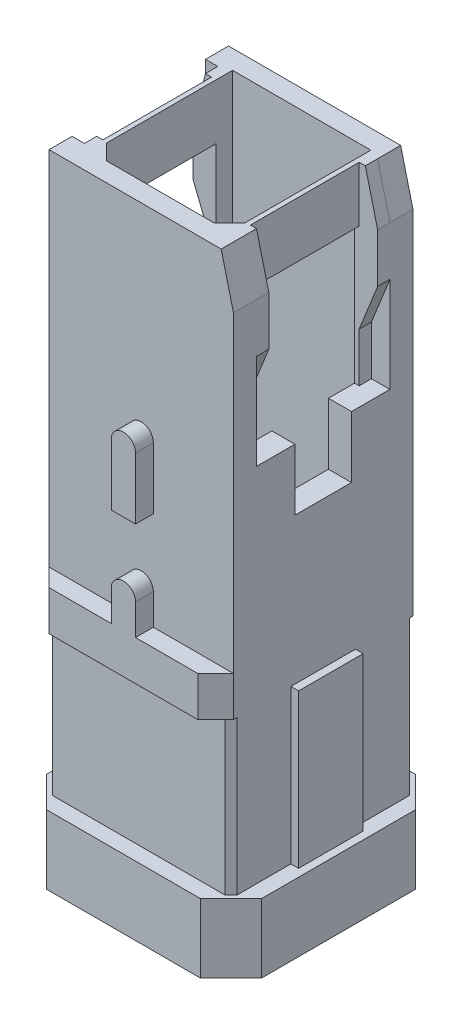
ISO-10303-21;
HEADER;
FILE_DESCRIPTION(('STEP AP214'),'2;1');
FILE_NAME('part.step','',(''),(''),'','','');
FILE_SCHEMA(('AUTOMOTIVE_DESIGN { 1 0 10303 214 1 1 1 1 }'));
ENDSEC;
DATA;
#1=APPLICATION_CONTEXT('core data for automotive mechanical design processes');
#2=APPLICATION_PROTOCOL_DEFINITION('international standard','automotive_design',2000,#1);
#3=PRODUCT_CONTEXT('',#1,'mechanical');
#4=PRODUCT('Part','Part','',(#3));
#5=PRODUCT_RELATED_PRODUCT_CATEGORY('part','',(#4));
#6=PRODUCT_DEFINITION_FORMATION('','',#4);
#7=PRODUCT_DEFINITION_CONTEXT('part definition',#1,'design');
#8=PRODUCT_DEFINITION('design','',#6,#7);
#9=PRODUCT_DEFINITION_SHAPE('','',#8);
#10=(LENGTH_UNIT() NAMED_UNIT(*) SI_UNIT(.MILLI.,.METRE.));
#11=(NAMED_UNIT(*) PLANE_ANGLE_UNIT() SI_UNIT($,.RADIAN.));
#12=(NAMED_UNIT(*) SI_UNIT($,.STERADIAN.) SOLID_ANGLE_UNIT());
#13=UNCERTAINTY_MEASURE_WITH_UNIT(LENGTH_MEASURE(1.E-05),#10,'distance_accuracy_value','');
#14=(GEOMETRIC_REPRESENTATION_CONTEXT(3) GLOBAL_UNCERTAINTY_ASSIGNED_CONTEXT((#13)) GLOBAL_UNIT_ASSIGNED_CONTEXT((#10,
#11,#12)) REPRESENTATION_CONTEXT('',''));
#15=CARTESIAN_POINT('',(0.,0.,0.));
#16=DIRECTION('',(0.,0.,1.));
#17=DIRECTION('',(1.,0.,0.));
#18=AXIS2_PLACEMENT_3D('',#15,#16,#17);
#19=CARTESIAN_POINT('',(-3.81000000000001,54.8041940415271,-3.70840000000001));
#20=DIRECTION('',(0.,0.,1.));
#21=DIRECTION('',(1.,0.,0.));
#22=AXIS2_PLACEMENT_3D('',#19,#20,#21);
#23=PLANE('',#22);
#24=DIRECTION('',(0.,1.,0.));
#25=VECTOR('',#24,1.);
#26=CARTESIAN_POINT('',(-0.500955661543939,17.4473995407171,-3.70839999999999));
#27=LINE('',#26,#25);
#28=CARTESIAN_POINT('',(-0.500955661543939,14.9073995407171,-3.7084));
#29=VERTEX_POINT('',#28);
#30=CARTESIAN_POINT('',(-0.500955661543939,17.4473995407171,-3.70839999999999));
#31=VERTEX_POINT('',#30);
#32=EDGE_CURVE('E739',#29,#31,#27,.T.);
#33=ORIENTED_EDGE('',*,*,#32,.F.);
#34=DIRECTION('',(-1.,0.,0.));
#35=VECTOR('',#34,1.);
#36=CARTESIAN_POINT('',(-0.500955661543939,14.9073995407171,-3.7084));
#37=LINE('',#36,#35);
#38=CARTESIAN_POINT('',(0.500955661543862,14.9073995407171,-3.7084));
#39=VERTEX_POINT('',#38);
#40=EDGE_CURVE('E736',#39,#29,#37,.T.);
#41=ORIENTED_EDGE('',*,*,#40,.F.);
#42=DIRECTION('',(0.,-1.,0.));
#43=VECTOR('',#42,1.);
#44=CARTESIAN_POINT('',(0.500955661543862,14.9073995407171,-3.7084));
#45=LINE('',#44,#43);
#46=CARTESIAN_POINT('',(0.500955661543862,17.4473995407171,-3.70839999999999));
#47=VERTEX_POINT('',#46);
#48=EDGE_CURVE('E733',#47,#39,#45,.T.);
#49=ORIENTED_EDGE('',*,*,#48,.F.);
#50=CARTESIAN_POINT('',(0.,17.4473995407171,-3.70839999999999));
#51=DIRECTION('',(0.,0.,-1.));
#52=DIRECTION('',(-1.,0.,0.));
#53=AXIS2_PLACEMENT_3D('',#50,#51,#52);
#54=CIRCLE('',#53,0.5009556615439);
#55=EDGE_CURVE('E730',#31,#47,#54,.T.);
#56=ORIENTED_EDGE('',*,*,#55,.F.);
#57=EDGE_LOOP('',(#33,#41,#49,#56));
#58=FACE_BOUND('',#57,.T.);
#59=DIRECTION('',(0.,-1.,0.));
#60=VECTOR('',#59,1.);
#61=CARTESIAN_POINT('',(0.500955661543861,10.8458,-3.70839999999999));
#62=LINE('',#61,#60);
#63=CARTESIAN_POINT('',(0.500955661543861,12.1158,-3.7084));
#64=VERTEX_POINT('',#63);
#65=CARTESIAN_POINT('',(0.500955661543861,10.8458,-3.70839999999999));
#66=VERTEX_POINT('',#65);
#67=EDGE_CURVE('E39',#64,#66,#62,.T.);
#68=ORIENTED_EDGE('',*,*,#67,.F.);
#69=CARTESIAN_POINT('',(0.,12.1158,-3.7084));
#70=DIRECTION('',(0.,0.,-1.));
#71=DIRECTION('',(-1.,0.,0.));
#72=AXIS2_PLACEMENT_3D('',#69,#70,#71);
#73=CIRCLE('',#72,0.5009556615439);
#74=CARTESIAN_POINT('',(-0.500955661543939,12.1158,-3.7084));
#75=VERTEX_POINT('',#74);
#76=EDGE_CURVE('E44',#75,#64,#73,.T.);
#77=ORIENTED_EDGE('',*,*,#76,.F.);
#78=DIRECTION('',(0.,1.,0.));
#79=VECTOR('',#78,1.);
#80=CARTESIAN_POINT('',(-0.500955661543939,12.1158,-3.7084));
#81=LINE('',#80,#79);
#82=CARTESIAN_POINT('',(-0.500955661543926,10.8458,-3.70839999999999));
#83=VERTEX_POINT('',#82);
#84=EDGE_CURVE('E2745',#83,#75,#81,.T.);
#85=ORIENTED_EDGE('',*,*,#84,.F.);
#86=DIRECTION('',(-1.,0.,0.));
#87=VECTOR('',#86,1.);
#88=CARTESIAN_POINT('',(3.81,10.8457999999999,-3.7084));
#89=LINE('',#88,#87);
#90=CARTESIAN_POINT('',(-3.81,10.8458,-3.70839999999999));
#91=VERTEX_POINT('',#90);
#92=EDGE_CURVE('E827',#83,#91,#89,.T.);
#93=ORIENTED_EDGE('',*,*,#92,.T.);
#94=DIRECTION('',(0.,-1.,0.));
#95=VECTOR('',#94,1.);
#96=CARTESIAN_POINT('',(-3.81000000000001,54.8041940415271,-3.70840000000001));
#97=LINE('',#96,#95);
#98=CARTESIAN_POINT('',(-3.81,25.781,-3.7084));
#99=VERTEX_POINT('',#98);
#100=EDGE_CURVE('E1305',#99,#91,#97,.T.);
#101=ORIENTED_EDGE('',*,*,#100,.F.);
#102=DIRECTION('',(1.,0.,0.));
#103=VECTOR('',#102,1.);
#104=CARTESIAN_POINT('',(-3.81,25.781,-3.7084));
#105=LINE('',#104,#103);
#106=CARTESIAN_POINT('',(3.30199999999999,25.781,-3.70840000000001));
#107=VERTEX_POINT('',#106);
#108=EDGE_CURVE('E1251',#99,#107,#105,.T.);
#109=ORIENTED_EDGE('',*,*,#108,.T.);
#110=DIRECTION('',(-0.242535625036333,0.970142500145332,0.));
#111=VECTOR('',#110,1.);
#112=CARTESIAN_POINT('',(3.81,23.7489999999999,-3.7084));
#113=LINE('',#112,#111);
#114=CARTESIAN_POINT('',(3.81,23.7489999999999,-3.7084));
#115=VERTEX_POINT('',#114);
#116=EDGE_CURVE('E1324',#107,#115,#113,.F.);
#117=ORIENTED_EDGE('',*,*,#116,.T.);
#118=DIRECTION('',(0.,-1.,0.));
#119=VECTOR('',#118,1.);
#120=CARTESIAN_POINT('',(3.80999999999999,54.8041940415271,-3.70840000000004));
#121=LINE('',#120,#119);
#122=CARTESIAN_POINT('',(3.81,10.8457999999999,-3.7084));
#123=VERTEX_POINT('',#122);
#124=EDGE_CURVE('E1312',#115,#123,#121,.T.);
#125=ORIENTED_EDGE('',*,*,#124,.T.);
#126=EDGE_CURVE('E828',#123,#66,#89,.T.);
#127=ORIENTED_EDGE('',*,*,#126,.T.);
#128=EDGE_LOOP('',(#68,#77,#85,#93,#101,#109,#117,#125,#127));
#129=FACE_BOUND('',#128,.T.);
#130=ADVANCED_FACE('F24',(#58,#129),#23,.F.);
#131=CARTESIAN_POINT('',(3.81,10.8457999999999,-3.7084));
#132=DIRECTION('',(0.,-1.,0.));
#133=DIRECTION('',(0.,0.,-1.));
#134=AXIS2_PLACEMENT_3D('',#131,#132,#133);
#135=PLANE('',#134);
#136=DIRECTION('',(0.,0.,1.));
#137=VECTOR('',#136,1.);
#138=CARTESIAN_POINT('',(0.500955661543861,10.8457999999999,-7.64675539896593));
#139=LINE('',#138,#137);
#140=CARTESIAN_POINT('',(0.500955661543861,10.8458,-4.445));
#141=VERTEX_POINT('',#140);
#142=EDGE_CURVE('E710',#141,#66,#139,.T.);
#143=ORIENTED_EDGE('',*,*,#142,.T.);
#144=ORIENTED_EDGE('',*,*,#126,.F.);
#145=DIRECTION('',(0.70710678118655,0.,0.707106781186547));
#146=VECTOR('',#145,1.);
#147=CARTESIAN_POINT('',(3.81,10.8457999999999,-3.7084));
#148=LINE('',#147,#146);
#149=CARTESIAN_POINT('',(3.07339999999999,10.8457999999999,-4.445));
#150=VERTEX_POINT('',#149);
#151=EDGE_CURVE('E1279',#123,#150,#148,.F.);
#152=ORIENTED_EDGE('',*,*,#151,.T.);
#153=DIRECTION('',(-1.,0.,0.));
#154=VECTOR('',#153,1.);
#155=CARTESIAN_POINT('',(3.81,10.8457999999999,-4.445));
#156=LINE('',#155,#154);
#157=EDGE_CURVE('E831',#150,#141,#156,.T.);
#158=ORIENTED_EDGE('',*,*,#157,.T.);
#159=EDGE_LOOP('',(#143,#144,#152,#158));
#160=FACE_BOUND('',#159,.T.);
#161=ADVANCED_FACE('F1720',(#160),#135,.F.);
#162=DIRECTION('',(0.,0.,1.));
#163=VECTOR('',#162,1.);
#164=CARTESIAN_POINT('',(-0.50095566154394,10.8458,-7.64675539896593));
#165=LINE('',#164,#163);
#166=CARTESIAN_POINT('',(-0.50095566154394,10.8458,-4.445));
#167=VERTEX_POINT('',#166);
#168=EDGE_CURVE('E713',#167,#83,#165,.T.);
#169=ORIENTED_EDGE('',*,*,#168,.F.);
#170=CARTESIAN_POINT('',(-3.0734,10.8458,-4.44499999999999));
#171=VERTEX_POINT('',#170);
#172=EDGE_CURVE('E830',#167,#171,#156,.T.);
#173=ORIENTED_EDGE('',*,*,#172,.T.);
#174=DIRECTION('',(0.707106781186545,0.,-0.707106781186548));
#175=VECTOR('',#174,1.);
#176=CARTESIAN_POINT('',(-3.0734,10.8458,-4.44499999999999));
#177=LINE('',#176,#175);
#178=EDGE_CURVE('E1276',#171,#91,#177,.F.);
#179=ORIENTED_EDGE('',*,*,#178,.T.);
#180=ORIENTED_EDGE('',*,*,#92,.F.);
#181=EDGE_LOOP('',(#169,#173,#179,#180));
#182=FACE_BOUND('',#181,.T.);
#183=ADVANCED_FACE('F1302',(#182),#135,.F.);
#184=CARTESIAN_POINT('',(-3.81,54.804194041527,3.70839999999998));
#185=DIRECTION('',(0.,0.,-1.));
#186=DIRECTION('',(-1.,0.,0.));
#187=AXIS2_PLACEMENT_3D('',#184,#185,#186);
#188=PLANE('',#187);
#189=DIRECTION('',(0.,1.,0.));
#190=VECTOR('',#189,1.);
#191=CARTESIAN_POINT('',(0.500955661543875,12.1158,3.70839999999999));
#192=LINE('',#191,#190);
#193=CARTESIAN_POINT('',(0.500955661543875,10.8458,3.70839999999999));
#194=VERTEX_POINT('',#193);
#195=CARTESIAN_POINT('',(0.500955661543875,12.1158,3.70839999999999));
#196=VERTEX_POINT('',#195);
#197=EDGE_CURVE('E804',#194,#196,#192,.T.);
#198=ORIENTED_EDGE('',*,*,#197,.F.);
#199=DIRECTION('',(-1.,0.,0.));
#200=VECTOR('',#199,1.);
#201=CARTESIAN_POINT('',(3.81,10.8458,3.70840000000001));
#202=LINE('',#201,#200);
#203=CARTESIAN_POINT('',(3.81,10.8458,3.7084));
#204=VERTEX_POINT('',#203);
#205=EDGE_CURVE('E821',#204,#194,#202,.T.);
#206=ORIENTED_EDGE('',*,*,#205,.F.);
#207=DIRECTION('',(0.,-1.,0.));
#208=VECTOR('',#207,1.);
#209=CARTESIAN_POINT('',(3.80999999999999,54.804194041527,3.70839999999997));
#210=LINE('',#209,#208);
#211=CARTESIAN_POINT('',(3.81,23.7489999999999,3.7084));
#212=VERTEX_POINT('',#211);
#213=EDGE_CURVE('E1315',#212,#204,#210,.T.);
#214=ORIENTED_EDGE('',*,*,#213,.F.);
#215=DIRECTION('',(0.242535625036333,-0.970142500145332,0.));
#216=VECTOR('',#215,1.);
#217=CARTESIAN_POINT('',(3.81,23.749,3.7084));
#218=LINE('',#217,#216);
#219=CARTESIAN_POINT('',(3.30200000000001,25.7809999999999,3.7084));
#220=VERTEX_POINT('',#219);
#221=EDGE_CURVE('E1435',#212,#220,#218,.F.);
#222=ORIENTED_EDGE('',*,*,#221,.T.);
#223=DIRECTION('',(-1.,0.,0.));
#224=VECTOR('',#223,1.);
#225=CARTESIAN_POINT('',(-3.81,25.7809999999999,3.7084));
#226=LINE('',#225,#224);
#227=CARTESIAN_POINT('',(-3.81,25.7809999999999,3.7084));
#228=VERTEX_POINT('',#227);
#229=EDGE_CURVE('E1248',#220,#228,#226,.T.);
#230=ORIENTED_EDGE('',*,*,#229,.T.);
#231=DIRECTION('',(0.,-1.,0.));
#232=VECTOR('',#231,1.);
#233=CARTESIAN_POINT('',(-3.81,54.804194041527,3.70839999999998));
#234=LINE('',#233,#232);
#235=CARTESIAN_POINT('',(-3.80999999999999,10.8458,3.70840000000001));
#236=VERTEX_POINT('',#235);
#237=EDGE_CURVE('E1321',#228,#236,#234,.T.);
#238=ORIENTED_EDGE('',*,*,#237,.T.);
#239=CARTESIAN_POINT('',(-0.500955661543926,10.8458,3.70839999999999));
#240=VERTEX_POINT('',#239);
#241=EDGE_CURVE('E820',#240,#236,#202,.T.);
#242=ORIENTED_EDGE('',*,*,#241,.F.);
#243=DIRECTION('',(0.,-1.,0.));
#244=VECTOR('',#243,1.);
#245=CARTESIAN_POINT('',(-0.500955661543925,12.1158,3.70839999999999));
#246=LINE('',#245,#244);
#247=CARTESIAN_POINT('',(-0.500955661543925,12.1158,3.70839999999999));
#248=VERTEX_POINT('',#247);
#249=EDGE_CURVE('E802',#248,#240,#246,.T.);
#250=ORIENTED_EDGE('',*,*,#249,.F.);
#251=CARTESIAN_POINT('',(0.,12.1158,3.70839999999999));
#252=DIRECTION('',(0.,0.,1.));
#253=DIRECTION('',(1.,0.,0.));
#254=AXIS2_PLACEMENT_3D('',#251,#252,#253);
#255=CIRCLE('',#254,0.5009556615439);
#256=EDGE_CURVE('E766',#196,#248,#255,.T.);
#257=ORIENTED_EDGE('',*,*,#256,.F.);
#258=EDGE_LOOP('',(#198,#206,#214,#222,#230,#238,#242,#250,#257));
#259=FACE_BOUND('',#258,.T.);
#260=DIRECTION('',(0.,1.,0.));
#261=VECTOR('',#260,1.);
#262=CARTESIAN_POINT('',(0.500955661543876,17.4473995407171,3.7084));
#263=LINE('',#262,#261);
#264=CARTESIAN_POINT('',(0.500955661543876,14.9073995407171,3.7084));
#265=VERTEX_POINT('',#264);
#266=CARTESIAN_POINT('',(0.500955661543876,17.4473995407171,3.7084));
#267=VERTEX_POINT('',#266);
#268=EDGE_CURVE('E775',#265,#267,#263,.T.);
#269=ORIENTED_EDGE('',*,*,#268,.F.);
#270=DIRECTION('',(1.,0.,0.));
#271=VECTOR('',#270,1.);
#272=CARTESIAN_POINT('',(-0.500955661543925,14.9073995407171,3.7084));
#273=LINE('',#272,#271);
#274=CARTESIAN_POINT('',(-0.500955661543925,14.9073995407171,3.7084));
#275=VERTEX_POINT('',#274);
#276=EDGE_CURVE('E772',#275,#265,#273,.T.);
#277=ORIENTED_EDGE('',*,*,#276,.F.);
#278=DIRECTION('',(0.,-1.,0.));
#279=VECTOR('',#278,1.);
#280=CARTESIAN_POINT('',(-0.500955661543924,17.4473995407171,3.7084));
#281=LINE('',#280,#279);
#282=CARTESIAN_POINT('',(-0.500955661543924,17.4473995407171,3.7084));
#283=VERTEX_POINT('',#282);
#284=EDGE_CURVE('E769',#283,#275,#281,.T.);
#285=ORIENTED_EDGE('',*,*,#284,.F.);
#286=CARTESIAN_POINT('',(0.,17.4473995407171,3.7084));
#287=DIRECTION('',(0.,0.,1.));
#288=DIRECTION('',(1.,0.,0.));
#289=AXIS2_PLACEMENT_3D('',#286,#287,#288);
#290=CIRCLE('',#289,0.5009556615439);
#291=EDGE_CURVE('E729',#267,#283,#290,.T.);
#292=ORIENTED_EDGE('',*,*,#291,.F.);
#293=EDGE_LOOP('',(#269,#277,#285,#292));
#294=FACE_BOUND('',#293,.T.);
#295=ADVANCED_FACE('F1502',(#259,#294),#188,.F.);
#296=CARTESIAN_POINT('',(3.81,10.8458,4.445));
#297=DIRECTION('',(0.,-1.,0.));
#298=DIRECTION('',(0.,0.,-1.));
#299=AXIS2_PLACEMENT_3D('',#296,#297,#298);
#300=PLANE('',#299);
#301=DIRECTION('',(0.,0.,-1.));
#302=VECTOR('',#301,1.);
#303=CARTESIAN_POINT('',(0.500955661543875,10.8458,6.479726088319));
#304=LINE('',#303,#302);
#305=CARTESIAN_POINT('',(0.500955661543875,10.8458,4.445));
#306=VERTEX_POINT('',#305);
#307=EDGE_CURVE('E809',#306,#194,#304,.T.);
#308=ORIENTED_EDGE('',*,*,#307,.F.);
#309=DIRECTION('',(-1.,0.,0.));
#310=VECTOR('',#309,1.);
#311=CARTESIAN_POINT('',(3.81,10.8458,4.445));
#312=LINE('',#311,#310);
#313=CARTESIAN_POINT('',(3.07340000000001,10.8458,4.445));
#314=VERTEX_POINT('',#313);
#315=EDGE_CURVE('E817',#314,#306,#312,.T.);
#316=ORIENTED_EDGE('',*,*,#315,.F.);
#317=DIRECTION('',(-0.707106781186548,0.,0.707106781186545));
#318=VECTOR('',#317,1.);
#319=CARTESIAN_POINT('',(3.81,10.8458,3.70840000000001));
#320=LINE('',#319,#318);
#321=EDGE_CURVE('E1269',#314,#204,#320,.F.);
#322=ORIENTED_EDGE('',*,*,#321,.T.);
#323=ORIENTED_EDGE('',*,*,#205,.T.);
#324=EDGE_LOOP('',(#308,#316,#322,#323));
#325=FACE_BOUND('',#324,.T.);
#326=ADVANCED_FACE('F1733',(#325),#300,.F.);
#327=DIRECTION('',(0.,0.,-1.));
#328=VECTOR('',#327,1.);
#329=CARTESIAN_POINT('',(-0.500955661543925,10.8458,6.479726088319));
#330=LINE('',#329,#328);
#331=CARTESIAN_POINT('',(-0.500955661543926,10.8458,4.445));
#332=VERTEX_POINT('',#331);
#333=EDGE_CURVE('E811',#332,#240,#330,.T.);
#334=ORIENTED_EDGE('',*,*,#333,.T.);
#335=ORIENTED_EDGE('',*,*,#241,.T.);
#336=DIRECTION('',(-0.707106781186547,0.,-0.70710678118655));
#337=VECTOR('',#336,1.);
#338=CARTESIAN_POINT('',(-3.0734,10.8458,4.44500000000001));
#339=LINE('',#338,#337);
#340=CARTESIAN_POINT('',(-3.07339999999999,10.8458,4.44500000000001));
#341=VERTEX_POINT('',#340);
#342=EDGE_CURVE('E1519',#236,#341,#339,.F.);
#343=ORIENTED_EDGE('',*,*,#342,.T.);
#344=EDGE_CURVE('E799',#332,#341,#312,.T.);
#345=ORIENTED_EDGE('',*,*,#344,.F.);
#346=EDGE_LOOP('',(#334,#335,#343,#345));
#347=FACE_BOUND('',#346,.T.);
#348=ADVANCED_FACE('F1957',(#347),#300,.F.);
#349=CARTESIAN_POINT('',(-2.8575,0.,2.286));
#350=DIRECTION('',(-1.,0.,0.));
#351=DIRECTION('',(0.,0.,1.));
#352=AXIS2_PLACEMENT_3D('',#349,#350,#351);
#353=PLANE('',#352);
#354=DIRECTION('',(0.,-1.,0.));
#355=VECTOR('',#354,1.);
#356=CARTESIAN_POINT('',(-2.8575,2.66699999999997,-2.47650000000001));
#357=LINE('',#356,#355);
#358=CARTESIAN_POINT('',(-2.8575,0.,-2.47649999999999));
#359=VERTEX_POINT('',#358);
#360=CARTESIAN_POINT('',(-2.8575,2.66699999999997,-2.47650000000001));
#361=VERTEX_POINT('',#360);
#362=EDGE_CURVE('E1417',#359,#361,#357,.F.);
#363=ORIENTED_EDGE('',*,*,#362,.F.);
#364=DIRECTION('',(0.,0.,1.));
#365=VECTOR('',#364,1.);
#366=CARTESIAN_POINT('',(-2.8575,0.,2.286));
#367=LINE('',#366,#365);
#368=CARTESIAN_POINT('',(-2.8575,0.,-2.921));
#369=VERTEX_POINT('',#368);
#370=EDGE_CURVE('E1134',#369,#359,#367,.T.);
#371=ORIENTED_EDGE('',*,*,#370,.F.);
#372=DIRECTION('',(0.,1.,0.));
#373=VECTOR('',#372,1.);
#374=CARTESIAN_POINT('',(-2.8575,0.,-2.921));
#375=LINE('',#374,#373);
#376=CARTESIAN_POINT('',(-2.85750000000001,25.781,-2.92100000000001));
#377=VERTEX_POINT('',#376);
#378=EDGE_CURVE('E1145',#369,#377,#375,.T.);
#379=ORIENTED_EDGE('',*,*,#378,.T.);
#380=DIRECTION('',(0.,0.,1.));
#381=VECTOR('',#380,1.);
#382=CARTESIAN_POINT('',(-2.85750000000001,25.7809999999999,2.28599999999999));
#383=LINE('',#382,#381);
#384=CARTESIAN_POINT('',(-2.85750000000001,25.7809999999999,2.28599999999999));
#385=VERTEX_POINT('',#384);
#386=EDGE_CURVE('E1107',#377,#385,#383,.T.);
#387=ORIENTED_EDGE('',*,*,#386,.T.);
#388=DIRECTION('',(0.,1.,0.));
#389=VECTOR('',#388,1.);
#390=CARTESIAN_POINT('',(-2.8575,0.,2.286));
#391=LINE('',#390,#389);
#392=CARTESIAN_POINT('',(-2.8575,2.66699999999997,2.28599999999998));
#393=VERTEX_POINT('',#392);
#394=EDGE_CURVE('E1144',#393,#385,#391,.T.);
#395=ORIENTED_EDGE('',*,*,#394,.F.);
#396=DIRECTION('',(0.,0.,1.));
#397=VECTOR('',#396,1.);
#398=CARTESIAN_POINT('',(-2.8575,2.66699999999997,3.11149999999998));
#399=LINE('',#398,#397);
#400=EDGE_CURVE('E1163',#361,#393,#399,.T.);
#401=ORIENTED_EDGE('',*,*,#400,.F.);
#402=EDGE_LOOP('',(#363,#371,#379,#387,#395,#401));
#403=FACE_BOUND('',#402,.T.);
#404=DIRECTION('',(0.,0.,-1.));
#405=VECTOR('',#404,1.);
#406=CARTESIAN_POINT('',(-2.85749999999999,17.78,2.28599999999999));
#407=LINE('',#406,#405);
#408=CARTESIAN_POINT('',(-2.85749999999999,17.78,-1.1684));
#409=VERTEX_POINT('',#408);
#410=CARTESIAN_POINT('',(-2.85750000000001,17.78,-2.24790000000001));
#411=VERTEX_POINT('',#410);
#412=EDGE_CURVE('E871',#409,#411,#407,.T.);
#413=ORIENTED_EDGE('',*,*,#412,.F.);
#414=DIRECTION('',(0.,1.,0.));
#415=VECTOR('',#414,1.);
#416=CARTESIAN_POINT('',(-2.8575,0.,-1.1684));
#417=LINE('',#416,#415);
#418=CARTESIAN_POINT('',(-2.8575,15.2399999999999,-1.16840000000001));
#419=VERTEX_POINT('',#418);
#420=EDGE_CURVE('E855',#419,#409,#417,.T.);
#421=ORIENTED_EDGE('',*,*,#420,.F.);
#422=DIRECTION('',(0.,0.,-1.));
#423=VECTOR('',#422,1.);
#424=CARTESIAN_POINT('',(-2.8575,15.2399999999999,2.28599999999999));
#425=LINE('',#424,#423);
#426=CARTESIAN_POINT('',(-2.8575,15.2399999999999,1.16839999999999));
#427=VERTEX_POINT('',#426);
#428=EDGE_CURVE('E858',#427,#419,#425,.T.);
#429=ORIENTED_EDGE('',*,*,#428,.F.);
#430=DIRECTION('',(0.,-1.,0.));
#431=VECTOR('',#430,1.);
#432=CARTESIAN_POINT('',(-2.8575,0.,1.1684));
#433=LINE('',#432,#431);
#434=CARTESIAN_POINT('',(-2.85749999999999,17.78,1.1684));
#435=VERTEX_POINT('',#434);
#436=EDGE_CURVE('E861',#435,#427,#433,.T.);
#437=ORIENTED_EDGE('',*,*,#436,.F.);
#438=DIRECTION('',(0.,0.,-1.));
#439=VECTOR('',#438,1.);
#440=CARTESIAN_POINT('',(-2.85749999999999,17.78,2.28599999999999));
#441=LINE('',#440,#439);
#442=CARTESIAN_POINT('',(-2.85749999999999,17.78,2.24789999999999));
#443=VERTEX_POINT('',#442);
#444=EDGE_CURVE('E864',#443,#435,#441,.T.);
#445=ORIENTED_EDGE('',*,*,#444,.F.);
#446=DIRECTION('',(0.,-1.,0.));
#447=VECTOR('',#446,1.);
#448=CARTESIAN_POINT('',(-2.8575,0.,2.2479));
#449=LINE('',#448,#447);
#450=CARTESIAN_POINT('',(-2.85749999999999,23.4949999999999,2.24789999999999));
#451=VERTEX_POINT('',#450);
#452=EDGE_CURVE('E867',#451,#443,#449,.T.);
#453=ORIENTED_EDGE('',*,*,#452,.F.);
#454=DIRECTION('',(0.,0.,1.));
#455=VECTOR('',#454,1.);
#456=CARTESIAN_POINT('',(-2.85749999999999,23.4949999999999,2.28599999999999));
#457=LINE('',#456,#455);
#458=CARTESIAN_POINT('',(-2.85750000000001,23.495,-2.24790000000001));
#459=VERTEX_POINT('',#458);
#460=EDGE_CURVE('E847',#459,#451,#457,.T.);
#461=ORIENTED_EDGE('',*,*,#460,.F.);
#462=DIRECTION('',(0.,1.,0.));
#463=VECTOR('',#462,1.);
#464=CARTESIAN_POINT('',(-2.8575,0.,-2.2479));
#465=LINE('',#464,#463);
#466=EDGE_CURVE('E869',#411,#459,#465,.T.);
#467=ORIENTED_EDGE('',*,*,#466,.F.);
#468=EDGE_LOOP('',(#413,#421,#429,#437,#445,#453,#461,#467));
#469=FACE_BOUND('',#468,.T.);
#470=ADVANCED_FACE('F1950',(#403,#469),#353,.F.);
#471=CARTESIAN_POINT('',(-3.048,25.7809999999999,2.75589999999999));
#472=DIRECTION('',(1.,0.,0.));
#473=DIRECTION('',(0.,0.,1.));
#474=AXIS2_PLACEMENT_3D('',#471,#472,#473);
#475=PLANE('',#474);
#476=DIRECTION('',(0.,1.,0.));
#477=VECTOR('',#476,1.);
#478=CARTESIAN_POINT('',(-3.048,17.78,-2.2479));
#479=LINE('',#478,#477);
#480=CARTESIAN_POINT('',(-3.048,17.78,-2.2479));
#481=VERTEX_POINT('',#480);
#482=CARTESIAN_POINT('',(-3.048,19.812,-2.24790000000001));
#483=VERTEX_POINT('',#482);
#484=EDGE_CURVE('E842',#481,#483,#479,.T.);
#485=ORIENTED_EDGE('',*,*,#484,.T.);
#486=DIRECTION('',(0.,0.,-1.));
#487=VECTOR('',#486,1.);
#488=CARTESIAN_POINT('',(-3.048,19.812,-2.24790000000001));
#489=LINE('',#488,#487);
#490=CARTESIAN_POINT('',(-3.048,19.812,-2.75590000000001));
#491=VERTEX_POINT('',#490);
#492=EDGE_CURVE('E892',#483,#491,#489,.T.);
#493=ORIENTED_EDGE('',*,*,#492,.T.);
#494=DIRECTION('',(0.,1.,0.));
#495=VECTOR('',#494,1.);
#496=CARTESIAN_POINT('',(-3.048,17.78,-2.75590000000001));
#497=LINE('',#496,#495);
#498=CARTESIAN_POINT('',(-3.048,17.78,-2.75590000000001));
#499=VERTEX_POINT('',#498);
#500=EDGE_CURVE('E959',#499,#491,#497,.T.);
#501=ORIENTED_EDGE('',*,*,#500,.F.);
#502=DIRECTION('',(0.,0.,-1.));
#503=VECTOR('',#502,1.);
#504=CARTESIAN_POINT('',(-3.048,17.78,-1.1684));
#505=LINE('',#504,#503);
#506=EDGE_CURVE('E962',#481,#499,#505,.T.);
#507=ORIENTED_EDGE('',*,*,#506,.F.);
#508=EDGE_LOOP('',(#485,#493,#501,#507));
#509=FACE_BOUND('',#508,.T.);
#510=ADVANCED_FACE('F1937',(#509),#475,.F.);
#511=DIRECTION('',(0.,0.,1.));
#512=VECTOR('',#511,1.);
#513=CARTESIAN_POINT('',(-3.048,23.4949999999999,2.24789999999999));
#514=LINE('',#513,#512);
#515=CARTESIAN_POINT('',(-3.048,23.495,-2.24790000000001));
#516=VERTEX_POINT('',#515);
#517=CARTESIAN_POINT('',(-3.048,23.4949999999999,2.24789999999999));
#518=VERTEX_POINT('',#517);
#519=EDGE_CURVE('E839',#516,#518,#514,.T.);
#520=ORIENTED_EDGE('',*,*,#519,.T.);
#521=DIRECTION('',(0.,1.,0.));
#522=VECTOR('',#521,1.);
#523=CARTESIAN_POINT('',(-3.048,25.7809999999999,2.24789999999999));
#524=LINE('',#523,#522);
#525=CARTESIAN_POINT('',(-3.048,25.7809999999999,2.24789999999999));
#526=VERTEX_POINT('',#525);
#527=EDGE_CURVE('E912',#518,#526,#524,.T.);
#528=ORIENTED_EDGE('',*,*,#527,.T.);
#529=DIRECTION('',(0.,0.,1.));
#530=VECTOR('',#529,1.);
#531=CARTESIAN_POINT('',(-3.048,25.7809999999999,2.75589999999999));
#532=LINE('',#531,#530);
#533=CARTESIAN_POINT('',(-3.048,25.781,-2.24790000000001));
#534=VERTEX_POINT('',#533);
#535=EDGE_CURVE('E956',#534,#526,#532,.T.);
#536=ORIENTED_EDGE('',*,*,#535,.F.);
#537=DIRECTION('',(0.,-1.,0.));
#538=VECTOR('',#537,1.);
#539=CARTESIAN_POINT('',(-3.048,25.781,-2.24790000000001));
#540=LINE('',#539,#538);
#541=EDGE_CURVE('E877',#534,#516,#540,.T.);
#542=ORIENTED_EDGE('',*,*,#541,.T.);
#543=EDGE_LOOP('',(#520,#528,#536,#542));
#544=FACE_BOUND('',#543,.T.);
#545=ADVANCED_FACE('F1934',(#544),#475,.F.);
#546=DIRECTION('',(0.,-1.,0.));
#547=VECTOR('',#546,1.);
#548=CARTESIAN_POINT('',(-3.048,23.4949999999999,2.24789999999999));
#549=LINE('',#548,#547);
#550=CARTESIAN_POINT('',(-3.048,19.8119999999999,2.24789999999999));
#551=VERTEX_POINT('',#550);
#552=CARTESIAN_POINT('',(-3.048,17.78,2.2479));
#553=VERTEX_POINT('',#552);
#554=EDGE_CURVE('E836',#551,#553,#549,.T.);
#555=ORIENTED_EDGE('',*,*,#554,.T.);
#556=DIRECTION('',(0.,0.,-1.));
#557=VECTOR('',#556,1.);
#558=CARTESIAN_POINT('',(-3.048,17.78,2.7559));
#559=LINE('',#558,#557);
#560=CARTESIAN_POINT('',(-3.048,17.78,2.7559));
#561=VERTEX_POINT('',#560);
#562=EDGE_CURVE('E964',#561,#553,#559,.T.);
#563=ORIENTED_EDGE('',*,*,#562,.F.);
#564=DIRECTION('',(0.,-1.,0.));
#565=VECTOR('',#564,1.);
#566=CARTESIAN_POINT('',(-3.048,17.78,2.7559));
#567=LINE('',#566,#565);
#568=CARTESIAN_POINT('',(-3.048,19.8119999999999,2.7559));
#569=VERTEX_POINT('',#568);
#570=EDGE_CURVE('E954',#569,#561,#567,.T.);
#571=ORIENTED_EDGE('',*,*,#570,.F.);
#572=DIRECTION('',(0.,0.,1.));
#573=VECTOR('',#572,1.);
#574=CARTESIAN_POINT('',(-3.048,19.8119999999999,2.24789999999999));
#575=LINE('',#574,#573);
#576=EDGE_CURVE('E929',#551,#569,#575,.T.);
#577=ORIENTED_EDGE('',*,*,#576,.F.);
#578=EDGE_LOOP('',(#555,#563,#571,#577));
#579=FACE_BOUND('',#578,.T.);
#580=ADVANCED_FACE('F1924',(#579),#475,.F.);
#581=CARTESIAN_POINT('',(-3.048,17.78,-2.75590000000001));
#582=DIRECTION('',(0.,0.,1.));
#583=DIRECTION('',(1.,0.,0.));
#584=AXIS2_PLACEMENT_3D('',#581,#582,#583);
#585=PLANE('',#584);
#586=DIRECTION('',(0.242535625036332,0.970142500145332,0.));
#587=VECTOR('',#586,1.);
#588=CARTESIAN_POINT('',(-3.81,23.749,-2.7559));
#589=LINE('',#588,#587);
#590=CARTESIAN_POINT('',(-3.81,23.749,-2.7559));
#591=VERTEX_POINT('',#590);
#592=CARTESIAN_POINT('',(-3.30200000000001,25.781,-2.75590000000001));
#593=VERTEX_POINT('',#592);
#594=EDGE_CURVE('E873',#591,#593,#589,.T.);
#595=ORIENTED_EDGE('',*,*,#594,.T.);
#596=DIRECTION('',(-1.,0.,0.));
#597=VECTOR('',#596,1.);
#598=CARTESIAN_POINT('',(-3.048,25.781,-2.75590000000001));
#599=LINE('',#598,#597);
#600=CARTESIAN_POINT('',(-3.81,25.781,-2.7559));
#601=VERTEX_POINT('',#600);
#602=EDGE_CURVE('E982',#593,#601,#599,.T.);
#603=ORIENTED_EDGE('',*,*,#602,.T.);
#604=DIRECTION('',(0.,1.,0.));
#605=VECTOR('',#604,1.);
#606=CARTESIAN_POINT('',(-3.81,17.78,-2.75590000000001));
#607=LINE('',#606,#605);
#608=EDGE_CURVE('E935',#591,#601,#607,.T.);
#609=ORIENTED_EDGE('',*,*,#608,.F.);
#610=EDGE_LOOP('',(#595,#603,#609));
#611=FACE_BOUND('',#610,.T.);
#612=ADVANCED_FACE('F1913',(#611),#585,.T.);
#613=CARTESIAN_POINT('',(-3.048,17.78,2.7559));
#614=DIRECTION('',(0.,0.,-1.));
#615=DIRECTION('',(-1.,0.,0.));
#616=AXIS2_PLACEMENT_3D('',#613,#614,#615);
#617=PLANE('',#616);
#618=DIRECTION('',(0.371390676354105,-0.928476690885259,0.));
#619=VECTOR('',#618,1.);
#620=CARTESIAN_POINT('',(-3.81,21.7169999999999,2.7559));
#621=LINE('',#620,#619);
#622=CARTESIAN_POINT('',(-3.81,21.7169999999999,2.7559));
#623=VERTEX_POINT('',#622);
#624=EDGE_CURVE('E903',#623,#569,#621,.T.);
#625=ORIENTED_EDGE('',*,*,#624,.T.);
#626=ORIENTED_EDGE('',*,*,#570,.T.);
#627=DIRECTION('',(-1.,0.,0.));
#628=VECTOR('',#627,1.);
#629=CARTESIAN_POINT('',(-3.048,17.78,2.7559));
#630=LINE('',#629,#628);
#631=CARTESIAN_POINT('',(-3.81000000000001,17.78,2.7559));
#632=VERTEX_POINT('',#631);
#633=EDGE_CURVE('E968',#561,#632,#630,.T.);
#634=ORIENTED_EDGE('',*,*,#633,.T.);
#635=DIRECTION('',(0.,-1.,0.));
#636=VECTOR('',#635,1.);
#637=CARTESIAN_POINT('',(-3.81000000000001,17.78,2.7559));
#638=LINE('',#637,#636);
#639=EDGE_CURVE('E931',#623,#632,#638,.T.);
#640=ORIENTED_EDGE('',*,*,#639,.F.);
#641=EDGE_LOOP('',(#625,#626,#634,#640));
#642=FACE_BOUND('',#641,.T.);
#643=ADVANCED_FACE('F1752',(#642),#617,.T.);
#644=CARTESIAN_POINT('',(-3.81000000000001,9.19479999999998,-3.80999999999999));
#645=DIRECTION('',(1.,0.,0.));
#646=DIRECTION('',(0.,0.,-1.));
#647=AXIS2_PLACEMENT_3D('',#644,#645,#646);
#648=PLANE('',#647);
#649=DIRECTION('',(0.,0.,1.));
#650=VECTOR('',#649,1.);
#651=CARTESIAN_POINT('',(-3.81000000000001,9.19479999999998,-3.70839999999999));
#652=LINE('',#651,#650);
#653=CARTESIAN_POINT('',(-3.80999999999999,9.19479999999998,3.55600000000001));
#654=VERTEX_POINT('',#653);
#655=CARTESIAN_POINT('',(-3.80999999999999,9.19479999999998,3.70840000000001));
#656=VERTEX_POINT('',#655);
#657=EDGE_CURVE('E1247',#654,#656,#652,.T.);
#658=ORIENTED_EDGE('',*,*,#657,.T.);
#659=DIRECTION('',(0.,1.,0.));
#660=VECTOR('',#659,1.);
#661=CARTESIAN_POINT('',(-3.80999999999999,9.19479999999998,3.70840000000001));
#662=LINE('',#661,#660);
#663=EDGE_CURVE('E1273',#656,#236,#662,.T.);
#664=ORIENTED_EDGE('',*,*,#663,.T.);
#665=ORIENTED_EDGE('',*,*,#237,.F.);
#666=DIRECTION('',(0.,0.,-1.));
#667=VECTOR('',#666,1.);
#668=CARTESIAN_POINT('',(-3.81,25.781,-3.7084));
#669=LINE('',#668,#667);
#670=CARTESIAN_POINT('',(-3.81,25.7809999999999,2.7559));
#671=VERTEX_POINT('',#670);
#672=EDGE_CURVE('E1252',#228,#671,#669,.T.);
#673=ORIENTED_EDGE('',*,*,#672,.T.);
#674=CARTESIAN_POINT('',(-3.81,23.7489999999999,2.7559));
#675=VERTEX_POINT('',#674);
#676=EDGE_CURVE('E932',#671,#675,#638,.T.);
#677=ORIENTED_EDGE('',*,*,#676,.T.);
#678=DIRECTION('',(0.,0.,1.));
#679=VECTOR('',#678,1.);
#680=CARTESIAN_POINT('',(-3.81,23.7489999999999,2.2479));
#681=LINE('',#680,#679);
#682=CARTESIAN_POINT('',(-3.81,23.7489999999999,2.2479));
#683=VERTEX_POINT('',#682);
#684=EDGE_CURVE('E925',#683,#675,#681,.T.);
#685=ORIENTED_EDGE('',*,*,#684,.F.);
#686=DIRECTION('',(0.,-1.,0.));
#687=VECTOR('',#686,1.);
#688=CARTESIAN_POINT('',(-3.81,23.7489999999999,2.2479));
#689=LINE('',#688,#687);
#690=CARTESIAN_POINT('',(-3.81,21.7169999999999,2.24789999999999));
#691=VERTEX_POINT('',#690);
#692=EDGE_CURVE('E917',#683,#691,#689,.T.);
#693=ORIENTED_EDGE('',*,*,#692,.T.);
#694=DIRECTION('',(0.,0.,1.));
#695=VECTOR('',#694,1.);
#696=CARTESIAN_POINT('',(-3.81,21.7169999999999,2.24789999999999));
#697=LINE('',#696,#695);
#698=EDGE_CURVE('E927',#691,#623,#697,.T.);
#699=ORIENTED_EDGE('',*,*,#698,.T.);
#700=ORIENTED_EDGE('',*,*,#639,.T.);
#701=DIRECTION('',(0.,0.,-1.));
#702=VECTOR('',#701,1.);
#703=CARTESIAN_POINT('',(-3.81000000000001,17.78,2.7559));
#704=LINE('',#703,#702);
#705=CARTESIAN_POINT('',(-3.81,17.78,1.1684));
#706=VERTEX_POINT('',#705);
#707=EDGE_CURVE('E951',#632,#706,#704,.T.);
#708=ORIENTED_EDGE('',*,*,#707,.T.);
#709=DIRECTION('',(0.,-1.,0.));
#710=VECTOR('',#709,1.);
#711=CARTESIAN_POINT('',(-3.81000000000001,15.2399999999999,1.16839999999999));
#712=LINE('',#711,#710);
#713=CARTESIAN_POINT('',(-3.81000000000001,15.2399999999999,1.16839999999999));
#714=VERTEX_POINT('',#713);
#715=EDGE_CURVE('E948',#706,#714,#712,.T.);
#716=ORIENTED_EDGE('',*,*,#715,.T.);
#717=DIRECTION('',(0.,0.,-1.));
#718=VECTOR('',#717,1.);
#719=CARTESIAN_POINT('',(-3.81000000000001,15.2399999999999,1.16839999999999));
#720=LINE('',#719,#718);
#721=CARTESIAN_POINT('',(-3.81000000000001,15.2399999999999,-1.16840000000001));
#722=VERTEX_POINT('',#721);
#723=EDGE_CURVE('E945',#714,#722,#720,.T.);
#724=ORIENTED_EDGE('',*,*,#723,.T.);
#725=DIRECTION('',(0.,1.,0.));
#726=VECTOR('',#725,1.);
#727=CARTESIAN_POINT('',(-3.81000000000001,15.2399999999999,-1.16840000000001));
#728=LINE('',#727,#726);
#729=CARTESIAN_POINT('',(-3.81000000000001,17.78,-1.1684));
#730=VERTEX_POINT('',#729);
#731=EDGE_CURVE('E942',#722,#730,#728,.T.);
#732=ORIENTED_EDGE('',*,*,#731,.T.);
#733=DIRECTION('',(0.,0.,-1.));
#734=VECTOR('',#733,1.);
#735=CARTESIAN_POINT('',(-3.81000000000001,17.78,-1.1684));
#736=LINE('',#735,#734);
#737=CARTESIAN_POINT('',(-3.81,17.78,-2.75590000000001));
#738=VERTEX_POINT('',#737);
#739=EDGE_CURVE('E939',#730,#738,#736,.T.);
#740=ORIENTED_EDGE('',*,*,#739,.T.);
#741=CARTESIAN_POINT('',(-3.81,21.7169999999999,-2.7559));
#742=VERTEX_POINT('',#741);
#743=EDGE_CURVE('E936',#738,#742,#607,.T.);
#744=ORIENTED_EDGE('',*,*,#743,.T.);
#745=DIRECTION('',(0.,0.,-1.));
#746=VECTOR('',#745,1.);
#747=CARTESIAN_POINT('',(-3.81,21.7169999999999,-2.24790000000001));
#748=LINE('',#747,#746);
#749=CARTESIAN_POINT('',(-3.81,21.7169999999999,-2.24790000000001));
#750=VERTEX_POINT('',#749);
#751=EDGE_CURVE('E894',#750,#742,#748,.T.);
#752=ORIENTED_EDGE('',*,*,#751,.F.);
#753=DIRECTION('',(0.,1.,0.));
#754=VECTOR('',#753,1.);
#755=CARTESIAN_POINT('',(-3.81,21.7169999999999,-2.24790000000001));
#756=LINE('',#755,#754);
#757=CARTESIAN_POINT('',(-3.81,23.749,-2.2479));
#758=VERTEX_POINT('',#757);
#759=EDGE_CURVE('E886',#750,#758,#756,.T.);
#760=ORIENTED_EDGE('',*,*,#759,.T.);
#761=DIRECTION('',(0.,0.,-1.));
#762=VECTOR('',#761,1.);
#763=CARTESIAN_POINT('',(-3.81,23.749,-2.2479));
#764=LINE('',#763,#762);
#765=EDGE_CURVE('E897',#758,#591,#764,.T.);
#766=ORIENTED_EDGE('',*,*,#765,.T.);
#767=ORIENTED_EDGE('',*,*,#608,.T.);
#768=EDGE_CURVE('E1250',#601,#99,#669,.T.);
#769=ORIENTED_EDGE('',*,*,#768,.T.);
#770=ORIENTED_EDGE('',*,*,#100,.T.);
#771=DIRECTION('',(0.,-1.,0.));
#772=VECTOR('',#771,1.);
#773=CARTESIAN_POINT('',(-3.81000000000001,9.19479999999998,-3.70839999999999));
#774=LINE('',#773,#772);
#775=CARTESIAN_POINT('',(-3.81000000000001,9.19479999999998,-3.70839999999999));
#776=VERTEX_POINT('',#775);
#777=EDGE_CURVE('E1271',#91,#776,#774,.T.);
#778=ORIENTED_EDGE('',*,*,#777,.T.);
#779=CARTESIAN_POINT('',(-3.81000000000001,9.19479999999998,-3.55599999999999));
#780=VERTEX_POINT('',#779);
#781=EDGE_CURVE('E1265',#776,#780,#652,.T.);
#782=ORIENTED_EDGE('',*,*,#781,.T.);
#783=DIRECTION('',(0.,-1.,0.));
#784=VECTOR('',#783,1.);
#785=CARTESIAN_POINT('',(-3.81000000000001,9.19479999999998,-3.55599999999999));
#786=LINE('',#785,#784);
#787=CARTESIAN_POINT('',(-3.81000000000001,2.84479999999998,-3.556));
#788=VERTEX_POINT('',#787);
#789=EDGE_CURVE('E1650',#780,#788,#786,.T.);
#790=ORIENTED_EDGE('',*,*,#789,.T.);
#791=DIRECTION('',(0.,0.,1.));
#792=VECTOR('',#791,1.);
#793=CARTESIAN_POINT('',(-3.81000000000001,2.84479999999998,-3.81000000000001));
#794=LINE('',#793,#792);
#795=CARTESIAN_POINT('',(-3.81000000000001,2.84479999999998,-1.33350000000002));
#796=VERTEX_POINT('',#795);
#797=EDGE_CURVE('E1668',#788,#796,#794,.T.);
#798=ORIENTED_EDGE('',*,*,#797,.T.);
#799=DIRECTION('',(0.,1.,0.));
#800=VECTOR('',#799,1.);
#801=CARTESIAN_POINT('',(-3.81000000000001,2.84479999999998,-1.33350000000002));
#802=LINE('',#801,#800);
#803=CARTESIAN_POINT('',(-3.81000000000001,9.19479999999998,-1.33349999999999));
#804=VERTEX_POINT('',#803);
#805=EDGE_CURVE('E1225',#796,#804,#802,.T.);
#806=ORIENTED_EDGE('',*,*,#805,.T.);
#807=DIRECTION('',(0.,0.,-1.));
#808=VECTOR('',#807,1.);
#809=CARTESIAN_POINT('',(-3.80999999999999,9.19479999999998,1.33350000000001));
#810=LINE('',#809,#808);
#811=CARTESIAN_POINT('',(-3.80999999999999,9.19479999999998,1.33350000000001));
#812=VERTEX_POINT('',#811);
#813=EDGE_CURVE('E1241',#812,#804,#810,.T.);
#814=ORIENTED_EDGE('',*,*,#813,.F.);
#815=DIRECTION('',(0.,1.,0.));
#816=VECTOR('',#815,1.);
#817=CARTESIAN_POINT('',(-3.80999999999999,2.84479999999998,1.33349999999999));
#818=LINE('',#817,#816);
#819=CARTESIAN_POINT('',(-3.80999999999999,2.84479999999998,1.33349999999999));
#820=VERTEX_POINT('',#819);
#821=EDGE_CURVE('E1234',#820,#812,#818,.T.);
#822=ORIENTED_EDGE('',*,*,#821,.F.);
#823=CARTESIAN_POINT('',(-3.80999999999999,2.84479999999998,3.55599999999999));
#824=VERTEX_POINT('',#823);
#825=EDGE_CURVE('E1255',#820,#824,#794,.T.);
#826=ORIENTED_EDGE('',*,*,#825,.T.);
#827=DIRECTION('',(0.,1.,0.));
#828=VECTOR('',#827,1.);
#829=CARTESIAN_POINT('',(-3.80999999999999,9.19479999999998,3.55600000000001));
#830=LINE('',#829,#828);
#831=EDGE_CURVE('E1653',#824,#654,#830,.T.);
#832=ORIENTED_EDGE('',*,*,#831,.T.);
#833=EDGE_LOOP('',(#658,#664,#665,#673,#677,#685,#693,#699,#700,#708,#716,#724,#732,#740,#744,
#752,#760,#766,#767,#769,#770,#778,#782,#790,#798,#806,#814,#822,#826,#832));
#834=FACE_BOUND('',#833,.T.);
#835=ADVANCED_FACE('F1307',(#834),#648,.F.);
#836=CARTESIAN_POINT('',(-4.445,25.781,-4.445));
#837=DIRECTION('',(0.,-1.,0.));
#838=DIRECTION('',(0.,0.,-1.));
#839=AXIS2_PLACEMENT_3D('',#836,#837,#838);
#840=PLANE('',#839);
#841=ORIENTED_EDGE('',*,*,#602,.F.);
#842=DIRECTION('',(0.,0.,-1.));
#843=VECTOR('',#842,1.);
#844=CARTESIAN_POINT('',(-3.30200000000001,25.781,-2.24790000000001));
#845=LINE('',#844,#843);
#846=CARTESIAN_POINT('',(-3.30200000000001,25.781,-2.24790000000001));
#847=VERTEX_POINT('',#846);
#848=EDGE_CURVE('E900',#847,#593,#845,.T.);
#849=ORIENTED_EDGE('',*,*,#848,.F.);
#850=DIRECTION('',(1.,0.,0.));
#851=VECTOR('',#850,1.);
#852=CARTESIAN_POINT('',(-3.30200000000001,25.781,-2.24790000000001));
#853=LINE('',#852,#851);
#854=EDGE_CURVE('E880',#847,#534,#853,.T.);
#855=ORIENTED_EDGE('',*,*,#854,.T.);
#856=ORIENTED_EDGE('',*,*,#535,.T.);
#857=DIRECTION('',(-1.,0.,0.));
#858=VECTOR('',#857,1.);
#859=CARTESIAN_POINT('',(-3.048,25.7809999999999,2.24789999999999));
#860=LINE('',#859,#858);
#861=CARTESIAN_POINT('',(-3.30199999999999,25.7809999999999,2.24789999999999));
#862=VERTEX_POINT('',#861);
#863=EDGE_CURVE('E909',#526,#862,#860,.T.);
#864=ORIENTED_EDGE('',*,*,#863,.T.);
#865=DIRECTION('',(0.,0.,1.));
#866=VECTOR('',#865,1.);
#867=CARTESIAN_POINT('',(-3.30199999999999,25.7809999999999,2.24789999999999));
#868=LINE('',#867,#866);
#869=CARTESIAN_POINT('',(-3.30199999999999,25.7809999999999,2.75589999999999));
#870=VERTEX_POINT('',#869);
#871=EDGE_CURVE('E923',#862,#870,#868,.T.);
#872=ORIENTED_EDGE('',*,*,#871,.T.);
#873=DIRECTION('',(-1.,0.,0.));
#874=VECTOR('',#873,1.);
#875=CARTESIAN_POINT('',(-3.048,25.7809999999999,2.75589999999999));
#876=LINE('',#875,#874);
#877=EDGE_CURVE('E967',#870,#671,#876,.T.);
#878=ORIENTED_EDGE('',*,*,#877,.T.);
#879=ORIENTED_EDGE('',*,*,#672,.F.);
#880=ORIENTED_EDGE('',*,*,#229,.F.);
#881=DIRECTION('',(0.,0.,-1.));
#882=VECTOR('',#881,1.);
#883=CARTESIAN_POINT('',(3.30199999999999,25.781,-4.445));
#884=LINE('',#883,#882);
#885=CARTESIAN_POINT('',(3.30199999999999,25.781,2.24789999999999));
#886=VERTEX_POINT('',#885);
#887=EDGE_CURVE('E1437',#220,#886,#884,.T.);
#888=ORIENTED_EDGE('',*,*,#887,.T.);
#889=DIRECTION('',(1.,0.,0.));
#890=VECTOR('',#889,1.);
#891=CARTESIAN_POINT('',(3.048,25.781,2.24789999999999));
#892=LINE('',#891,#890);
#893=CARTESIAN_POINT('',(3.048,25.781,2.24789999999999));
#894=VERTEX_POINT('',#893);
#895=EDGE_CURVE('E1053',#894,#886,#892,.T.);
#896=ORIENTED_EDGE('',*,*,#895,.F.);
#897=DIRECTION('',(0.,0.,1.));
#898=VECTOR('',#897,1.);
#899=CARTESIAN_POINT('',(3.048,25.7809999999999,2.75589999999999));
#900=LINE('',#899,#898);
#901=CARTESIAN_POINT('',(3.04799999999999,25.781,-2.2479));
#902=VERTEX_POINT('',#901);
#903=EDGE_CURVE('E1101',#902,#894,#900,.T.);
#904=ORIENTED_EDGE('',*,*,#903,.F.);
#905=DIRECTION('',(-1.,0.,0.));
#906=VECTOR('',#905,1.);
#907=CARTESIAN_POINT('',(3.30199999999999,25.781,-2.2479));
#908=LINE('',#907,#906);
#909=CARTESIAN_POINT('',(3.30199999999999,25.781,-2.2479));
#910=VERTEX_POINT('',#909);
#911=EDGE_CURVE('E1038',#910,#902,#908,.T.);
#912=ORIENTED_EDGE('',*,*,#911,.F.);
#913=DIRECTION('',(0.,0.,-1.));
#914=VECTOR('',#913,1.);
#915=CARTESIAN_POINT('',(3.30199999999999,25.781,-2.2479));
#916=LINE('',#915,#914);
#917=CARTESIAN_POINT('',(3.30199999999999,25.781,-2.75590000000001));
#918=VERTEX_POINT('',#917);
#919=EDGE_CURVE('E1040',#910,#918,#916,.T.);
#920=ORIENTED_EDGE('',*,*,#919,.T.);
#921=DIRECTION('',(0.,0.,-1.));
#922=VECTOR('',#921,1.);
#923=CARTESIAN_POINT('',(3.30199999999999,25.781,-4.445));
#924=LINE('',#923,#922);
#925=EDGE_CURVE('E1331',#918,#107,#924,.T.);
#926=ORIENTED_EDGE('',*,*,#925,.T.);
#927=ORIENTED_EDGE('',*,*,#108,.F.);
#928=ORIENTED_EDGE('',*,*,#768,.F.);
#929=EDGE_LOOP('',(#841,#849,#855,#856,#864,#872,#878,#879,#880,#888,#896,#904,#912,#920,#926,
#927,#928));
#930=FACE_BOUND('',#929,.T.);
#931=DIRECTION('',(0.707106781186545,0.,0.707106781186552));
#932=VECTOR('',#931,1.);
#933=CARTESIAN_POINT('',(-2.85750000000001,25.7809999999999,2.28599999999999));
#934=LINE('',#933,#932);
#935=CARTESIAN_POINT('',(-2.22250000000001,25.7809999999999,2.92099999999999));
#936=VERTEX_POINT('',#935);
#937=EDGE_CURVE('E1119',#385,#936,#934,.T.);
#938=ORIENTED_EDGE('',*,*,#937,.F.);
#939=ORIENTED_EDGE('',*,*,#386,.F.);
#940=DIRECTION('',(-1.,0.,0.));
#941=VECTOR('',#940,1.);
#942=CARTESIAN_POINT('',(2.85749999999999,25.781,-2.92100000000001));
#943=LINE('',#942,#941);
#944=CARTESIAN_POINT('',(2.85749999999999,25.781,-2.92100000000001));
#945=VERTEX_POINT('',#944);
#946=EDGE_CURVE('E1131',#945,#377,#943,.T.);
#947=ORIENTED_EDGE('',*,*,#946,.F.);
#948=DIRECTION('',(0.,0.,-1.));
#949=VECTOR('',#948,1.);
#950=CARTESIAN_POINT('',(2.8575,25.781,2.28599999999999));
#951=LINE('',#950,#949);
#952=CARTESIAN_POINT('',(2.8575,25.781,2.28599999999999));
#953=VERTEX_POINT('',#952);
#954=EDGE_CURVE('E1128',#953,#945,#951,.T.);
#955=ORIENTED_EDGE('',*,*,#954,.F.);
#956=DIRECTION('',(0.707106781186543,0.,-0.70710678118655));
#957=VECTOR('',#956,1.);
#958=CARTESIAN_POINT('',(2.8575,25.781,2.28599999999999));
#959=LINE('',#958,#957);
#960=CARTESIAN_POINT('',(2.22250000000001,25.7809999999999,2.921));
#961=VERTEX_POINT('',#960);
#962=EDGE_CURVE('E1125',#961,#953,#959,.T.);
#963=ORIENTED_EDGE('',*,*,#962,.F.);
#964=DIRECTION('',(1.,0.,0.));
#965=VECTOR('',#964,1.);
#966=CARTESIAN_POINT('',(2.22250000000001,25.7809999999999,2.921));
#967=LINE('',#966,#965);
#968=EDGE_CURVE('E1122',#936,#961,#967,.T.);
#969=ORIENTED_EDGE('',*,*,#968,.F.);
#970=EDGE_LOOP('',(#938,#939,#947,#955,#963,#969));
#971=FACE_BOUND('',#970,.T.);
#972=ADVANCED_FACE('F1507',(#930,#971),#840,.F.);
#973=CARTESIAN_POINT('',(3.048,25.7809999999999,2.75589999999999));
#974=DIRECTION('',(-1.,0.,0.));
#975=DIRECTION('',(0.,0.,1.));
#976=AXIS2_PLACEMENT_3D('',#973,#974,#975);
#977=PLANE('',#976);
#978=DIRECTION('',(0.,0.,-1.));
#979=VECTOR('',#978,1.);
#980=CARTESIAN_POINT('',(3.048,17.78,2.7559));
#981=LINE('',#980,#979);
#982=CARTESIAN_POINT('',(3.048,17.78,2.7559));
#983=VERTEX_POINT('',#982);
#984=CARTESIAN_POINT('',(3.048,17.78,2.24789999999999));
#985=VERTEX_POINT('',#984);
#986=EDGE_CURVE('E1093',#983,#985,#981,.T.);
#987=ORIENTED_EDGE('',*,*,#986,.T.);
#988=DIRECTION('',(0.,-1.,0.));
#989=VECTOR('',#988,1.);
#990=CARTESIAN_POINT('',(3.048,23.495,2.2479));
#991=LINE('',#990,#989);
#992=CARTESIAN_POINT('',(3.048,19.812,2.24789999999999));
#993=VERTEX_POINT('',#992);
#994=EDGE_CURVE('E989',#993,#985,#991,.T.);
#995=ORIENTED_EDGE('',*,*,#994,.F.);
#996=DIRECTION('',(0.,0.,1.));
#997=VECTOR('',#996,1.);
#998=CARTESIAN_POINT('',(3.048,19.812,2.24789999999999));
#999=LINE('',#998,#997);
#1000=CARTESIAN_POINT('',(3.048,19.8119999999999,2.7559));
#1001=VERTEX_POINT('',#1000);
#1002=EDGE_CURVE('E1066',#993,#1001,#999,.T.);
#1003=ORIENTED_EDGE('',*,*,#1002,.T.);
#1004=DIRECTION('',(0.,-1.,0.));
#1005=VECTOR('',#1004,1.);
#1006=CARTESIAN_POINT('',(3.048,17.78,2.7559));
#1007=LINE('',#1006,#1005);
#1008=EDGE_CURVE('E1091',#1001,#983,#1007,.T.);
#1009=ORIENTED_EDGE('',*,*,#1008,.T.);
#1010=EDGE_LOOP('',(#987,#995,#1003,#1009));
#1011=FACE_BOUND('',#1010,.T.);
#1012=ADVANCED_FACE('F1879',(#1011),#977,.F.);
#1013=DIRECTION('',(0.,1.,0.));
#1014=VECTOR('',#1013,1.);
#1015=CARTESIAN_POINT('',(3.048,25.781,2.24789999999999));
#1016=LINE('',#1015,#1014);
#1017=CARTESIAN_POINT('',(3.048,23.495,2.2479));
#1018=VERTEX_POINT('',#1017);
#1019=EDGE_CURVE('E1064',#1018,#894,#1016,.T.);
#1020=ORIENTED_EDGE('',*,*,#1019,.F.);
#1021=DIRECTION('',(0.,0.,1.));
#1022=VECTOR('',#1021,1.);
#1023=CARTESIAN_POINT('',(3.048,23.495,2.2479));
#1024=LINE('',#1023,#1022);
#1025=CARTESIAN_POINT('',(3.048,23.495,-2.24789999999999));
#1026=VERTEX_POINT('',#1025);
#1027=EDGE_CURVE('E986',#1026,#1018,#1024,.T.);
#1028=ORIENTED_EDGE('',*,*,#1027,.F.);
#1029=DIRECTION('',(0.,-1.,0.));
#1030=VECTOR('',#1029,1.);
#1031=CARTESIAN_POINT('',(3.04799999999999,25.781,-2.2479));
#1032=LINE('',#1031,#1030);
#1033=EDGE_CURVE('E1029',#902,#1026,#1032,.T.);
#1034=ORIENTED_EDGE('',*,*,#1033,.F.);
#1035=ORIENTED_EDGE('',*,*,#903,.T.);
#1036=EDGE_LOOP('',(#1020,#1028,#1034,#1035));
#1037=FACE_BOUND('',#1036,.T.);
#1038=ADVANCED_FACE('F1876',(#1037),#977,.F.);
#1039=DIRECTION('',(0.,0.,-1.));
#1040=VECTOR('',#1039,1.);
#1041=CARTESIAN_POINT('',(3.048,19.812,-2.24790000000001));
#1042=LINE('',#1041,#1040);
#1043=CARTESIAN_POINT('',(3.048,19.812,-2.24790000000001));
#1044=VERTEX_POINT('',#1043);
#1045=CARTESIAN_POINT('',(3.048,19.812,-2.7559));
#1046=VERTEX_POINT('',#1045);
#1047=EDGE_CURVE('E1048',#1044,#1046,#1042,.T.);
#1048=ORIENTED_EDGE('',*,*,#1047,.F.);
#1049=DIRECTION('',(0.,1.,0.));
#1050=VECTOR('',#1049,1.);
#1051=CARTESIAN_POINT('',(3.048,17.7799999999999,-2.24790000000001));
#1052=LINE('',#1051,#1050);
#1053=CARTESIAN_POINT('',(3.048,17.7799999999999,-2.24790000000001));
#1054=VERTEX_POINT('',#1053);
#1055=EDGE_CURVE('E971',#1054,#1044,#1052,.T.);
#1056=ORIENTED_EDGE('',*,*,#1055,.F.);
#1057=DIRECTION('',(0.,0.,-1.));
#1058=VECTOR('',#1057,1.);
#1059=CARTESIAN_POINT('',(3.048,17.78,-1.1684));
#1060=LINE('',#1059,#1058);
#1061=CARTESIAN_POINT('',(3.048,17.7799999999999,-2.7559));
#1062=VERTEX_POINT('',#1061);
#1063=EDGE_CURVE('E1096',#1054,#1062,#1060,.T.);
#1064=ORIENTED_EDGE('',*,*,#1063,.T.);
#1065=DIRECTION('',(0.,1.,0.));
#1066=VECTOR('',#1065,1.);
#1067=CARTESIAN_POINT('',(3.048,17.7799999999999,-2.7559));
#1068=LINE('',#1067,#1066);
#1069=EDGE_CURVE('E1098',#1062,#1046,#1068,.T.);
#1070=ORIENTED_EDGE('',*,*,#1069,.T.);
#1071=EDGE_LOOP('',(#1048,#1056,#1064,#1070));
#1072=FACE_BOUND('',#1071,.T.);
#1073=ADVANCED_FACE('F1868',(#1072),#977,.F.);
#1074=CARTESIAN_POINT('',(3.048,17.7799999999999,-2.7559));
#1075=DIRECTION('',(0.,0.,-1.));
#1076=DIRECTION('',(-1.,0.,0.));
#1077=AXIS2_PLACEMENT_3D('',#1074,#1075,#1076);
#1078=PLANE('',#1077);
#1079=DIRECTION('',(0.371390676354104,0.928476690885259,0.));
#1080=VECTOR('',#1079,1.);
#1081=CARTESIAN_POINT('',(3.048,19.812,-2.7559));
#1082=LINE('',#1081,#1080);
#1083=CARTESIAN_POINT('',(3.81,21.7169999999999,-2.7559));
#1084=VERTEX_POINT('',#1083);
#1085=EDGE_CURVE('E1024',#1046,#1084,#1082,.T.);
#1086=ORIENTED_EDGE('',*,*,#1085,.F.);
#1087=ORIENTED_EDGE('',*,*,#1069,.F.);
#1088=DIRECTION('',(1.,0.,0.));
#1089=VECTOR('',#1088,1.);
#1090=CARTESIAN_POINT('',(3.048,17.7799999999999,-2.7559));
#1091=LINE('',#1090,#1089);
#1092=CARTESIAN_POINT('',(3.81,17.7799999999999,-2.7559));
#1093=VERTEX_POINT('',#1092);
#1094=EDGE_CURVE('E1105',#1062,#1093,#1091,.T.);
#1095=ORIENTED_EDGE('',*,*,#1094,.T.);
#1096=DIRECTION('',(0.,1.,0.));
#1097=VECTOR('',#1096,1.);
#1098=CARTESIAN_POINT('',(3.81,17.7799999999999,-2.7559));
#1099=LINE('',#1098,#1097);
#1100=EDGE_CURVE('E1088',#1093,#1084,#1099,.T.);
#1101=ORIENTED_EDGE('',*,*,#1100,.T.);
#1102=EDGE_LOOP('',(#1086,#1087,#1095,#1101));
#1103=FACE_BOUND('',#1102,.T.);
#1104=ADVANCED_FACE('F1457',(#1103),#1078,.F.);
#1105=CARTESIAN_POINT('',(3.048,17.78,2.7559));
#1106=DIRECTION('',(0.,0.,1.));
#1107=DIRECTION('',(1.,0.,0.));
#1108=AXIS2_PLACEMENT_3D('',#1105,#1106,#1107);
#1109=PLANE('',#1108);
#1110=DIRECTION('',(-0.371390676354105,-0.928476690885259,0.));
#1111=VECTOR('',#1110,1.);
#1112=CARTESIAN_POINT('',(3.81,21.7169999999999,2.7559));
#1113=LINE('',#1112,#1111);
#1114=CARTESIAN_POINT('',(3.81,21.7169999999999,2.7559));
#1115=VERTEX_POINT('',#1114);
#1116=EDGE_CURVE('E1050',#1115,#1001,#1113,.T.);
#1117=ORIENTED_EDGE('',*,*,#1116,.F.);
#1118=DIRECTION('',(0.,-1.,0.));
#1119=VECTOR('',#1118,1.);
#1120=CARTESIAN_POINT('',(3.81,17.78,2.7559));
#1121=LINE('',#1120,#1119);
#1122=CARTESIAN_POINT('',(3.81,17.78,2.7559));
#1123=VERTEX_POINT('',#1122);
#1124=EDGE_CURVE('E1071',#1115,#1123,#1121,.T.);
#1125=ORIENTED_EDGE('',*,*,#1124,.T.);
#1126=DIRECTION('',(1.,0.,0.));
#1127=VECTOR('',#1126,1.);
#1128=CARTESIAN_POINT('',(3.048,17.78,2.7559));
#1129=LINE('',#1128,#1127);
#1130=EDGE_CURVE('E1104',#983,#1123,#1129,.T.);
#1131=ORIENTED_EDGE('',*,*,#1130,.F.);
#1132=ORIENTED_EDGE('',*,*,#1008,.F.);
#1133=EDGE_LOOP('',(#1117,#1125,#1131,#1132));
#1134=FACE_BOUND('',#1133,.T.);
#1135=ADVANCED_FACE('F1485',(#1134),#1109,.F.);
#1136=CARTESIAN_POINT('',(3.4925,2.66699999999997,3.11149999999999));
#1137=DIRECTION('',(0.,1.,0.));
#1138=DIRECTION('',(0.,0.,1.));
#1139=AXIS2_PLACEMENT_3D('',#1136,#1137,#1138);
#1140=PLANE('',#1139);
#1141=DIRECTION('',(-0.707106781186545,0.,-0.707106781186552));
#1142=VECTOR('',#1141,1.);
#1143=CARTESIAN_POINT('',(3.4925,2.66699999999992,-1.8415));
#1144=LINE('',#1143,#1142);
#1145=CARTESIAN_POINT('',(2.2225,2.66699999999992,-3.1115));
#1146=VERTEX_POINT('',#1145);
#1147=CARTESIAN_POINT('',(2.413,2.66699999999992,-2.92100000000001));
#1148=VERTEX_POINT('',#1147);
#1149=EDGE_CURVE('E1389',#1146,#1148,#1144,.F.);
#1150=ORIENTED_EDGE('',*,*,#1149,.T.);
#1151=DIRECTION('',(-1.,0.,0.));
#1152=VECTOR('',#1151,1.);
#1153=CARTESIAN_POINT('',(3.4925,2.66699999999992,-2.92100000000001));
#1154=LINE('',#1153,#1152);
#1155=CARTESIAN_POINT('',(-2.413,2.66699999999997,-2.92100000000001));
#1156=VERTEX_POINT('',#1155);
#1157=EDGE_CURVE('E1147',#1148,#1156,#1154,.T.);
#1158=ORIENTED_EDGE('',*,*,#1157,.T.);
#1159=DIRECTION('',(-0.70710678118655,0.,0.707106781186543));
#1160=VECTOR('',#1159,1.);
#1161=CARTESIAN_POINT('',(-2.2225,2.66699999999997,-3.11150000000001));
#1162=LINE('',#1161,#1160);
#1163=CARTESIAN_POINT('',(-2.2225,2.66699999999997,-3.11150000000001));
#1164=VERTEX_POINT('',#1163);
#1165=EDGE_CURVE('E1382',#1156,#1164,#1162,.F.);
#1166=ORIENTED_EDGE('',*,*,#1165,.T.);
#1167=DIRECTION('',(1.,0.,0.));
#1168=VECTOR('',#1167,1.);
#1169=CARTESIAN_POINT('',(-3.49250000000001,2.66699999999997,-3.11150000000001));
#1170=LINE('',#1169,#1168);
#1171=EDGE_CURVE('E1187',#1164,#1146,#1170,.T.);
#1172=ORIENTED_EDGE('',*,*,#1171,.T.);
#1173=EDGE_LOOP('',(#1150,#1158,#1166,#1172));
#1174=FACE_BOUND('',#1173,.T.);
#1175=ADVANCED_FACE('F1842',(#1174),#1140,.F.);
#1176=CARTESIAN_POINT('',(3.4925,2.66699999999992,-1.8415));
#1177=DIRECTION('',(-0.70710678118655,0.,0.707106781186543));
#1178=DIRECTION('',(0.707106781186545,0.,0.707106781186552));
#1179=AXIS2_PLACEMENT_3D('',#1176,#1177,#1178);
#1180=PLANE('',#1179);
#1181=DIRECTION('',(0.707106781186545,0.,0.707106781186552));
#1182=VECTOR('',#1181,1.);
#1183=CARTESIAN_POINT('',(3.4925,0.,-1.84149999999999));
#1184=LINE('',#1183,#1182);
#1185=CARTESIAN_POINT('',(2.413,0.,-2.921));
#1186=VERTEX_POINT('',#1185);
#1187=CARTESIAN_POINT('',(2.2225,0.,-3.1115));
#1188=VERTEX_POINT('',#1187);
#1189=EDGE_CURVE('E1402',#1186,#1188,#1184,.F.);
#1190=ORIENTED_EDGE('',*,*,#1189,.F.);
#1191=DIRECTION('',(0.,-1.,0.));
#1192=VECTOR('',#1191,1.);
#1193=CARTESIAN_POINT('',(2.413,2.66699999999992,-2.92100000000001));
#1194=LINE('',#1193,#1192);
#1195=EDGE_CURVE('E1160',#1186,#1148,#1194,.F.);
#1196=ORIENTED_EDGE('',*,*,#1195,.T.);
#1197=ORIENTED_EDGE('',*,*,#1149,.F.);
#1198=DIRECTION('',(0.,1.,0.));
#1199=VECTOR('',#1198,1.);
#1200=CARTESIAN_POINT('',(2.2225,2.66699999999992,-3.1115));
#1201=LINE('',#1200,#1199);
#1202=EDGE_CURVE('E1378',#1188,#1146,#1201,.T.);
#1203=ORIENTED_EDGE('',*,*,#1202,.F.);
#1204=EDGE_LOOP('',(#1190,#1196,#1197,#1203));
#1205=FACE_BOUND('',#1204,.T.);
#1206=ADVANCED_FACE('F1832',(#1205),#1180,.T.);
#1207=CARTESIAN_POINT('',(-2.2225,2.66699999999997,-3.11150000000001));
#1208=DIRECTION('',(0.707106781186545,0.,0.707106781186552));
#1209=DIRECTION('',(0.70710678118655,0.,-0.707106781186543));
#1210=AXIS2_PLACEMENT_3D('',#1207,#1208,#1209);
#1211=PLANE('',#1210);
#1212=DIRECTION('',(0.70710678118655,0.,-0.707106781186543));
#1213=VECTOR('',#1212,1.);
#1214=CARTESIAN_POINT('',(-2.2225,0.,-3.1115));
#1215=LINE('',#1214,#1213);
#1216=CARTESIAN_POINT('',(-3.49250000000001,0.,-1.8415));
#1217=VERTEX_POINT('',#1216);
#1218=EDGE_CURVE('E1408',#359,#1217,#1215,.F.);
#1219=ORIENTED_EDGE('',*,*,#1218,.F.);
#1220=ORIENTED_EDGE('',*,*,#362,.T.);
#1221=CARTESIAN_POINT('',(-3.49250000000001,2.66699999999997,-1.84150000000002));
#1222=VERTEX_POINT('',#1221);
#1223=EDGE_CURVE('E1383',#1222,#361,#1162,.F.);
#1224=ORIENTED_EDGE('',*,*,#1223,.F.);
#1225=DIRECTION('',(0.,1.,0.));
#1226=VECTOR('',#1225,1.);
#1227=CARTESIAN_POINT('',(-3.49250000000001,2.66699999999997,-1.84150000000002));
#1228=LINE('',#1227,#1226);
#1229=EDGE_CURVE('E1392',#1217,#1222,#1228,.T.);
#1230=ORIENTED_EDGE('',*,*,#1229,.F.);
#1231=EDGE_LOOP('',(#1219,#1220,#1224,#1230));
#1232=FACE_BOUND('',#1231,.T.);
#1233=ADVANCED_FACE('F1775',(#1232),#1211,.T.);
#1234=CARTESIAN_POINT('',(-4.445,2.84479999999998,-4.445));
#1235=DIRECTION('',(0.,-1.,0.));
#1236=DIRECTION('',(0.,0.,-1.));
#1237=AXIS2_PLACEMENT_3D('',#1234,#1235,#1236);
#1238=PLANE('',#1237);
#1239=DIRECTION('',(-0.707106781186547,0.,-0.70710678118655));
#1240=VECTOR('',#1239,1.);
#1241=CARTESIAN_POINT('',(-3.175,2.84479999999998,4.44499999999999));
#1242=LINE('',#1241,#1240);
#1243=CARTESIAN_POINT('',(-4.44499999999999,2.84479999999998,3.17499999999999));
#1244=VERTEX_POINT('',#1243);
#1245=CARTESIAN_POINT('',(-3.80999999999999,2.84479999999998,3.80999999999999));
#1246=VERTEX_POINT('',#1245);
#1247=EDGE_CURVE('E1624',#1244,#1246,#1242,.F.);
#1248=ORIENTED_EDGE('',*,*,#1247,.T.);
#1249=CARTESIAN_POINT('',(-3.175,2.84479999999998,4.44499999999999));
#1250=VERTEX_POINT('',#1249);
#1251=EDGE_CURVE('E1623',#1246,#1250,#1242,.F.);
#1252=ORIENTED_EDGE('',*,*,#1251,.T.);
#1253=DIRECTION('',(1.,0.,0.));
#1254=VECTOR('',#1253,1.);
#1255=CARTESIAN_POINT('',(-4.44499999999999,2.84479999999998,4.44499999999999));
#1256=LINE('',#1255,#1254);
#1257=CARTESIAN_POINT('',(3.175,2.84479999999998,4.445));
#1258=VERTEX_POINT('',#1257);
#1259=EDGE_CURVE('E1588',#1250,#1258,#1256,.T.);
#1260=ORIENTED_EDGE('',*,*,#1259,.T.);
#1261=DIRECTION('',(-0.707106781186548,0.,0.707106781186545));
#1262=VECTOR('',#1261,1.);
#1263=CARTESIAN_POINT('',(4.445,2.84479999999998,3.17499999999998));
#1264=LINE('',#1263,#1262);
#1265=CARTESIAN_POINT('',(3.80999999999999,2.84479999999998,3.80999999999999));
#1266=VERTEX_POINT('',#1265);
#1267=EDGE_CURVE('E1628',#1258,#1266,#1264,.F.);
#1268=ORIENTED_EDGE('',*,*,#1267,.T.);
#1269=CARTESIAN_POINT('',(4.445,2.84479999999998,3.17499999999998));
#1270=VERTEX_POINT('',#1269);
#1271=EDGE_CURVE('E1627',#1266,#1270,#1264,.F.);
#1272=ORIENTED_EDGE('',*,*,#1271,.T.);
#1273=DIRECTION('',(0.,0.,-1.));
#1274=VECTOR('',#1273,1.);
#1275=CARTESIAN_POINT('',(4.445,2.84479999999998,4.445));
#1276=LINE('',#1275,#1274);
#1277=CARTESIAN_POINT('',(4.44499999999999,2.84479999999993,-3.175));
#1278=VERTEX_POINT('',#1277);
#1279=EDGE_CURVE('E1591',#1270,#1278,#1276,.T.);
#1280=ORIENTED_EDGE('',*,*,#1279,.T.);
#1281=DIRECTION('',(0.707106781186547,0.,0.70710678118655));
#1282=VECTOR('',#1281,1.);
#1283=CARTESIAN_POINT('',(3.175,2.84479999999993,-4.445));
#1284=LINE('',#1283,#1282);
#1285=CARTESIAN_POINT('',(3.80999999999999,2.84479999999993,-3.81));
#1286=VERTEX_POINT('',#1285);
#1287=EDGE_CURVE('E1616',#1278,#1286,#1284,.F.);
#1288=ORIENTED_EDGE('',*,*,#1287,.T.);
#1289=CARTESIAN_POINT('',(3.175,2.84479999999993,-4.445));
#1290=VERTEX_POINT('',#1289);
#1291=EDGE_CURVE('E1615',#1286,#1290,#1284,.F.);
#1292=ORIENTED_EDGE('',*,*,#1291,.T.);
#1293=DIRECTION('',(-1.,0.,0.));
#1294=VECTOR('',#1293,1.);
#1295=CARTESIAN_POINT('',(-4.445,2.84479999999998,-4.445));
#1296=LINE('',#1295,#1294);
#1297=CARTESIAN_POINT('',(-3.175,2.84479999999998,-4.445));
#1298=VERTEX_POINT('',#1297);
#1299=EDGE_CURVE('E1594',#1290,#1298,#1296,.T.);
#1300=ORIENTED_EDGE('',*,*,#1299,.T.);
#1301=DIRECTION('',(0.707106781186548,0.,-0.707106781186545));
#1302=VECTOR('',#1301,1.);
#1303=CARTESIAN_POINT('',(-4.445,2.84479999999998,-3.17500000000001));
#1304=LINE('',#1303,#1302);
#1305=CARTESIAN_POINT('',(-3.81000000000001,2.84479999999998,-3.81000000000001));
#1306=VERTEX_POINT('',#1305);
#1307=EDGE_CURVE('E1620',#1298,#1306,#1304,.F.);
#1308=ORIENTED_EDGE('',*,*,#1307,.T.);
#1309=CARTESIAN_POINT('',(-4.445,2.84479999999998,-3.17500000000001));
#1310=VERTEX_POINT('',#1309);
#1311=EDGE_CURVE('E1619',#1306,#1310,#1304,.F.);
#1312=ORIENTED_EDGE('',*,*,#1311,.T.);
#1313=DIRECTION('',(0.,0.,1.));
#1314=VECTOR('',#1313,1.);
#1315=CARTESIAN_POINT('',(-4.44499999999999,2.84479999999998,4.44499999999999));
#1316=LINE('',#1315,#1314);
#1317=EDGE_CURVE('E1585',#1310,#1244,#1316,.T.);
#1318=ORIENTED_EDGE('',*,*,#1317,.T.);
#1319=EDGE_LOOP('',(#1248,#1252,#1260,#1268,#1272,#1280,#1288,#1292,#1300,#1308,#1312,#1318));
#1320=FACE_BOUND('',#1319,.T.);
#1321=DIRECTION('',(1.,0.,0.));
#1322=VECTOR('',#1321,1.);
#1323=CARTESIAN_POINT('',(3.81,2.84480000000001,1.33349999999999));
#1324=LINE('',#1323,#1322);
#1325=CARTESIAN_POINT('',(3.81,2.84480000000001,1.33349999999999));
#1326=VERTEX_POINT('',#1325);
#1327=CARTESIAN_POINT('',(4.12750000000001,2.84480000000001,1.33349999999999));
#1328=VERTEX_POINT('',#1327);
#1329=EDGE_CURVE('E1205',#1326,#1328,#1324,.T.);
#1330=ORIENTED_EDGE('',*,*,#1329,.F.);
#1331=DIRECTION('',(0.,0.,-1.));
#1332=VECTOR('',#1331,1.);
#1333=CARTESIAN_POINT('',(3.80999999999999,2.84479999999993,-3.81));
#1334=LINE('',#1333,#1332);
#1335=CARTESIAN_POINT('',(3.81000000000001,2.84479999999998,3.55599999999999));
#1336=VERTEX_POINT('',#1335);
#1337=EDGE_CURVE('E1556',#1336,#1326,#1334,.T.);
#1338=ORIENTED_EDGE('',*,*,#1337,.F.);
#1339=DIRECTION('',(0.707106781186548,0.,-0.707106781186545));
#1340=VECTOR('',#1339,1.);
#1341=CARTESIAN_POINT('',(3.68299999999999,2.84479999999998,3.68300000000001));
#1342=LINE('',#1341,#1340);
#1343=CARTESIAN_POINT('',(3.556,2.84479999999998,3.80999999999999));
#1344=VERTEX_POINT('',#1343);
#1345=EDGE_CURVE('E1552',#1336,#1344,#1342,.F.);
#1346=ORIENTED_EDGE('',*,*,#1345,.T.);
#1347=DIRECTION('',(1.,0.,0.));
#1348=VECTOR('',#1347,1.);
#1349=CARTESIAN_POINT('',(-3.80999999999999,2.84479999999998,3.80999999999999));
#1350=LINE('',#1349,#1348);
#1351=CARTESIAN_POINT('',(-3.556,2.84479999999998,3.80999999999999));
#1352=VERTEX_POINT('',#1351);
#1353=EDGE_CURVE('E1566',#1352,#1344,#1350,.T.);
#1354=ORIENTED_EDGE('',*,*,#1353,.F.);
#1355=DIRECTION('',(0.707106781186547,0.,0.70710678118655));
#1356=VECTOR('',#1355,1.);
#1357=CARTESIAN_POINT('',(-8.128,2.84479999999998,-0.76200000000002));
#1358=LINE('',#1357,#1356);
#1359=EDGE_CURVE('E1372',#1352,#824,#1358,.F.);
#1360=ORIENTED_EDGE('',*,*,#1359,.T.);
#1361=ORIENTED_EDGE('',*,*,#825,.F.);
#1362=DIRECTION('',(1.,0.,0.));
#1363=VECTOR('',#1362,1.);
#1364=CARTESIAN_POINT('',(-4.12749999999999,2.84479999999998,1.33349999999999));
#1365=LINE('',#1364,#1363);
#1366=CARTESIAN_POINT('',(-4.12749999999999,2.84479999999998,1.33349999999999));
#1367=VERTEX_POINT('',#1366);
#1368=EDGE_CURVE('E1232',#1367,#820,#1365,.T.);
#1369=ORIENTED_EDGE('',*,*,#1368,.F.);
#1370=DIRECTION('',(0.,0.,-1.));
#1371=VECTOR('',#1370,1.);
#1372=CARTESIAN_POINT('',(-4.12749999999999,2.84479999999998,1.33349999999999));
#1373=LINE('',#1372,#1371);
#1374=CARTESIAN_POINT('',(-4.12750000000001,2.84479999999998,-1.33350000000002));
#1375=VERTEX_POINT('',#1374);
#1376=EDGE_CURVE('E1244',#1367,#1375,#1373,.T.);
#1377=ORIENTED_EDGE('',*,*,#1376,.T.);
#1378=DIRECTION('',(1.,0.,0.));
#1379=VECTOR('',#1378,1.);
#1380=CARTESIAN_POINT('',(-4.12750000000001,2.84479999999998,-1.33350000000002));
#1381=LINE('',#1380,#1379);
#1382=EDGE_CURVE('E1222',#1375,#796,#1381,.T.);
#1383=ORIENTED_EDGE('',*,*,#1382,.T.);
#1384=ORIENTED_EDGE('',*,*,#797,.F.);
#1385=DIRECTION('',(-0.707106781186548,0.,0.707106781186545));
#1386=VECTOR('',#1385,1.);
#1387=CARTESIAN_POINT('',(-3.683,2.84479999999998,-3.68300000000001));
#1388=LINE('',#1387,#1386);
#1389=CARTESIAN_POINT('',(-3.556,2.84479999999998,-3.81000000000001));
#1390=VERTEX_POINT('',#1389);
#1391=EDGE_CURVE('E1679',#788,#1390,#1388,.F.);
#1392=ORIENTED_EDGE('',*,*,#1391,.T.);
#1393=DIRECTION('',(-1.,0.,0.));
#1394=VECTOR('',#1393,1.);
#1395=CARTESIAN_POINT('',(-3.81000000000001,2.84479999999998,-3.81000000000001));
#1396=LINE('',#1395,#1394);
#1397=CARTESIAN_POINT('',(3.55599999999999,2.84479999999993,-3.81));
#1398=VERTEX_POINT('',#1397);
#1399=EDGE_CURVE('E1562',#1398,#1390,#1396,.T.);
#1400=ORIENTED_EDGE('',*,*,#1399,.F.);
#1401=DIRECTION('',(-0.707106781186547,0.,-0.70710678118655));
#1402=VECTOR('',#1401,1.);
#1403=CARTESIAN_POINT('',(-0.761999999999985,2.84479999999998,-8.128));
#1404=LINE('',#1403,#1402);
#1405=CARTESIAN_POINT('',(3.80999999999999,2.84479999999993,-3.556));
#1406=VERTEX_POINT('',#1405);
#1407=EDGE_CURVE('E1686',#1398,#1406,#1404,.F.);
#1408=ORIENTED_EDGE('',*,*,#1407,.T.);
#1409=CARTESIAN_POINT('',(3.81,2.84479999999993,-1.33350000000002));
#1410=VERTEX_POINT('',#1409);
#1411=EDGE_CURVE('E1563',#1410,#1406,#1334,.T.);
#1412=ORIENTED_EDGE('',*,*,#1411,.F.);
#1413=DIRECTION('',(1.,0.,0.));
#1414=VECTOR('',#1413,1.);
#1415=CARTESIAN_POINT('',(3.81,2.84479999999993,-1.33350000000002));
#1416=LINE('',#1415,#1414);
#1417=CARTESIAN_POINT('',(4.12749999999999,2.84479999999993,-1.33350000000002));
#1418=VERTEX_POINT('',#1417);
#1419=EDGE_CURVE('E1196',#1410,#1418,#1416,.T.);
#1420=ORIENTED_EDGE('',*,*,#1419,.T.);
#1421=DIRECTION('',(0.,0.,-1.));
#1422=VECTOR('',#1421,1.);
#1423=CARTESIAN_POINT('',(4.12750000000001,2.84480000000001,1.33349999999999));
#1424=LINE('',#1423,#1422);
#1425=EDGE_CURVE('E1217',#1328,#1418,#1424,.T.);
#1426=ORIENTED_EDGE('',*,*,#1425,.F.);
#1427=EDGE_LOOP('',(#1330,#1338,#1346,#1354,#1360,#1361,#1369,#1377,#1383,#1384,#1392,#1400,
#1408,#1412,#1420,#1426));
#1428=FACE_BOUND('',#1427,.T.);
#1429=ADVANCED_FACE('F1559',(#1320,#1428),#1238,.F.);
#1430=CARTESIAN_POINT('',(3.81,9.19479999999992,-3.81));
#1431=DIRECTION('',(-1.,0.,0.));
#1432=DIRECTION('',(0.,0.,1.));
#1433=AXIS2_PLACEMENT_3D('',#1430,#1431,#1432);
#1434=PLANE('',#1433);
#1435=ORIENTED_EDGE('',*,*,#213,.T.);
#1436=DIRECTION('',(0.,-1.,0.));
#1437=VECTOR('',#1436,1.);
#1438=CARTESIAN_POINT('',(3.81,9.19479999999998,3.70839999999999));
#1439=LINE('',#1438,#1437);
#1440=CARTESIAN_POINT('',(3.81000000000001,9.19479999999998,3.70839999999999));
#1441=VERTEX_POINT('',#1440);
#1442=EDGE_CURVE('E1337',#204,#1441,#1439,.T.);
#1443=ORIENTED_EDGE('',*,*,#1442,.T.);
#1444=DIRECTION('',(0.,0.,-1.));
#1445=VECTOR('',#1444,1.);
#1446=CARTESIAN_POINT('',(3.81,9.19479999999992,-3.70839999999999));
#1447=LINE('',#1446,#1445);
#1448=CARTESIAN_POINT('',(3.81,9.19479999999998,3.556));
#1449=VERTEX_POINT('',#1448);
#1450=EDGE_CURVE('E1313',#1441,#1449,#1447,.T.);
#1451=ORIENTED_EDGE('',*,*,#1450,.T.);
#1452=DIRECTION('',(0.,-1.,0.));
#1453=VECTOR('',#1452,1.);
#1454=CARTESIAN_POINT('',(3.81,9.19479999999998,3.556));
#1455=LINE('',#1454,#1453);
#1456=EDGE_CURVE('E1362',#1449,#1336,#1455,.T.);
#1457=ORIENTED_EDGE('',*,*,#1456,.T.);
#1458=ORIENTED_EDGE('',*,*,#1337,.T.);
#1459=DIRECTION('',(0.,-1.,0.));
#1460=VECTOR('',#1459,1.);
#1461=CARTESIAN_POINT('',(3.81,2.84480000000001,1.33349999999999));
#1462=LINE('',#1461,#1460);
#1463=CARTESIAN_POINT('',(3.81,9.1948,1.33349999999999));
#1464=VERTEX_POINT('',#1463);
#1465=EDGE_CURVE('E1203',#1464,#1326,#1462,.T.);
#1466=ORIENTED_EDGE('',*,*,#1465,.F.);
#1467=DIRECTION('',(0.,0.,-1.));
#1468=VECTOR('',#1467,1.);
#1469=CARTESIAN_POINT('',(3.81,9.1948,1.33349999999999));
#1470=LINE('',#1469,#1468);
#1471=CARTESIAN_POINT('',(3.81,9.19479999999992,-1.3335));
#1472=VERTEX_POINT('',#1471);
#1473=EDGE_CURVE('E1211',#1464,#1472,#1470,.T.);
#1474=ORIENTED_EDGE('',*,*,#1473,.T.);
#1475=DIRECTION('',(0.,-1.,0.));
#1476=VECTOR('',#1475,1.);
#1477=CARTESIAN_POINT('',(3.81,2.84479999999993,-1.33350000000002));
#1478=LINE('',#1477,#1476);
#1479=EDGE_CURVE('E1193',#1472,#1410,#1478,.T.);
#1480=ORIENTED_EDGE('',*,*,#1479,.T.);
#1481=ORIENTED_EDGE('',*,*,#1411,.T.);
#1482=DIRECTION('',(0.,1.,0.));
#1483=VECTOR('',#1482,1.);
#1484=CARTESIAN_POINT('',(3.81,9.19479999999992,-3.556));
#1485=LINE('',#1484,#1483);
#1486=CARTESIAN_POINT('',(3.81,9.19479999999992,-3.556));
#1487=VERTEX_POINT('',#1486);
#1488=EDGE_CURVE('E1366',#1406,#1487,#1485,.T.);
#1489=ORIENTED_EDGE('',*,*,#1488,.T.);
#1490=CARTESIAN_POINT('',(3.81,9.19479999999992,-3.70839999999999));
#1491=VERTEX_POINT('',#1490);
#1492=EDGE_CURVE('E1268',#1487,#1491,#1447,.T.);
#1493=ORIENTED_EDGE('',*,*,#1492,.T.);
#1494=DIRECTION('',(0.,1.,0.));
#1495=VECTOR('',#1494,1.);
#1496=CARTESIAN_POINT('',(3.81,9.19479999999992,-3.70840000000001));
#1497=LINE('',#1496,#1495);
#1498=EDGE_CURVE('E1334',#1491,#123,#1497,.T.);
#1499=ORIENTED_EDGE('',*,*,#1498,.T.);
#1500=ORIENTED_EDGE('',*,*,#124,.F.);
#1501=DIRECTION('',(0.,0.,1.));
#1502=VECTOR('',#1501,1.);
#1503=CARTESIAN_POINT('',(3.81,23.7489999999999,-3.81));
#1504=LINE('',#1503,#1502);
#1505=CARTESIAN_POINT('',(3.81,23.7489999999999,-2.7559));
#1506=VERTEX_POINT('',#1505);
#1507=EDGE_CURVE('E1333',#115,#1506,#1504,.T.);
#1508=ORIENTED_EDGE('',*,*,#1507,.T.);
#1509=DIRECTION('',(0.,0.,-1.));
#1510=VECTOR('',#1509,1.);
#1511=CARTESIAN_POINT('',(3.81,23.7489999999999,-2.2479));
#1512=LINE('',#1511,#1510);
#1513=CARTESIAN_POINT('',(3.81,23.7489999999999,-2.2479));
#1514=VERTEX_POINT('',#1513);
#1515=EDGE_CURVE('E1042',#1514,#1506,#1512,.T.);
#1516=ORIENTED_EDGE('',*,*,#1515,.F.);
#1517=DIRECTION('',(0.,1.,0.));
#1518=VECTOR('',#1517,1.);
#1519=CARTESIAN_POINT('',(3.81,21.7169999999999,-2.2479));
#1520=LINE('',#1519,#1518);
#1521=CARTESIAN_POINT('',(3.81,21.7169999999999,-2.2479));
#1522=VERTEX_POINT('',#1521);
#1523=EDGE_CURVE('E1034',#1522,#1514,#1520,.T.);
#1524=ORIENTED_EDGE('',*,*,#1523,.F.);
#1525=DIRECTION('',(0.,0.,-1.));
#1526=VECTOR('',#1525,1.);
#1527=CARTESIAN_POINT('',(3.81,21.7169999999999,-2.2479));
#1528=LINE('',#1527,#1526);
#1529=EDGE_CURVE('E1045',#1522,#1084,#1528,.T.);
#1530=ORIENTED_EDGE('',*,*,#1529,.T.);
#1531=ORIENTED_EDGE('',*,*,#1100,.F.);
#1532=DIRECTION('',(0.,0.,-1.));
#1533=VECTOR('',#1532,1.);
#1534=CARTESIAN_POINT('',(3.81,17.7799999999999,-1.1684));
#1535=LINE('',#1534,#1533);
#1536=CARTESIAN_POINT('',(3.81,17.7799999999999,-1.1684));
#1537=VERTEX_POINT('',#1536);
#1538=EDGE_CURVE('E1085',#1537,#1093,#1535,.T.);
#1539=ORIENTED_EDGE('',*,*,#1538,.F.);
#1540=DIRECTION('',(0.,1.,0.));
#1541=VECTOR('',#1540,1.);
#1542=CARTESIAN_POINT('',(3.81,15.24,-1.1684));
#1543=LINE('',#1542,#1541);
#1544=CARTESIAN_POINT('',(3.81,15.24,-1.1684));
#1545=VERTEX_POINT('',#1544);
#1546=EDGE_CURVE('E1082',#1545,#1537,#1543,.T.);
#1547=ORIENTED_EDGE('',*,*,#1546,.F.);
#1548=DIRECTION('',(0.,0.,-1.));
#1549=VECTOR('',#1548,1.);
#1550=CARTESIAN_POINT('',(3.81,15.2400000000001,1.1684));
#1551=LINE('',#1550,#1549);
#1552=CARTESIAN_POINT('',(3.81,15.2400000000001,1.1684));
#1553=VERTEX_POINT('',#1552);
#1554=EDGE_CURVE('E1079',#1553,#1545,#1551,.T.);
#1555=ORIENTED_EDGE('',*,*,#1554,.F.);
#1556=DIRECTION('',(0.,-1.,0.));
#1557=VECTOR('',#1556,1.);
#1558=CARTESIAN_POINT('',(3.81,15.2400000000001,1.1684));
#1559=LINE('',#1558,#1557);
#1560=CARTESIAN_POINT('',(3.81,17.78,1.1684));
#1561=VERTEX_POINT('',#1560);
#1562=EDGE_CURVE('E1076',#1561,#1553,#1559,.T.);
#1563=ORIENTED_EDGE('',*,*,#1562,.F.);
#1564=DIRECTION('',(0.,0.,-1.));
#1565=VECTOR('',#1564,1.);
#1566=CARTESIAN_POINT('',(3.81,17.78,2.7559));
#1567=LINE('',#1566,#1565);
#1568=EDGE_CURVE('E1073',#1123,#1561,#1567,.T.);
#1569=ORIENTED_EDGE('',*,*,#1568,.F.);
#1570=ORIENTED_EDGE('',*,*,#1124,.F.);
#1571=DIRECTION('',(0.,0.,1.));
#1572=VECTOR('',#1571,1.);
#1573=CARTESIAN_POINT('',(3.81,21.717,2.24789999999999));
#1574=LINE('',#1573,#1572);
#1575=CARTESIAN_POINT('',(3.81,21.717,2.24789999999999));
#1576=VERTEX_POINT('',#1575);
#1577=EDGE_CURVE('E1068',#1576,#1115,#1574,.T.);
#1578=ORIENTED_EDGE('',*,*,#1577,.F.);
#1579=DIRECTION('',(0.,-1.,0.));
#1580=VECTOR('',#1579,1.);
#1581=CARTESIAN_POINT('',(3.81,23.749,2.24789999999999));
#1582=LINE('',#1581,#1580);
#1583=CARTESIAN_POINT('',(3.81,23.749,2.24789999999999));
#1584=VERTEX_POINT('',#1583);
#1585=EDGE_CURVE('E1059',#1584,#1576,#1582,.T.);
#1586=ORIENTED_EDGE('',*,*,#1585,.F.);
#1587=DIRECTION('',(0.,0.,1.));
#1588=VECTOR('',#1587,1.);
#1589=CARTESIAN_POINT('',(3.81,23.7489999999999,-3.81));
#1590=LINE('',#1589,#1588);
#1591=EDGE_CURVE('E1432',#1584,#212,#1590,.T.);
#1592=ORIENTED_EDGE('',*,*,#1591,.T.);
#1593=EDGE_LOOP('',(#1435,#1443,#1451,#1457,#1458,#1466,#1474,#1480,#1481,#1489,#1493,#1499,
#1500,#1508,#1516,#1524,#1530,#1531,#1539,#1547,#1555,#1563,#1569,#1570,#1578,#1586,#1592));
#1594=FACE_BOUND('',#1593,.T.);
#1595=ADVANCED_FACE('F1440',(#1594),#1434,.F.);
#1596=CARTESIAN_POINT('',(-4.44499999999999,2.84479999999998,4.44499999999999));
#1597=DIRECTION('',(1.,0.,0.));
#1598=DIRECTION('',(0.,0.,-1.));
#1599=AXIS2_PLACEMENT_3D('',#1596,#1597,#1598);
#1600=PLANE('',#1599);
#1601=DIRECTION('',(0.,0.,1.));
#1602=VECTOR('',#1601,1.);
#1603=CARTESIAN_POINT('',(-4.44499999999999,0.,4.445));
#1604=LINE('',#1603,#1602);
#1605=CARTESIAN_POINT('',(-4.445,0.,-3.175));
#1606=VERTEX_POINT('',#1605);
#1607=CARTESIAN_POINT('',(-4.44499999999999,0.,3.175));
#1608=VERTEX_POINT('',#1607);
#1609=EDGE_CURVE('E1573',#1606,#1608,#1604,.T.);
#1610=ORIENTED_EDGE('',*,*,#1609,.T.);
#1611=DIRECTION('',(0.,1.,0.));
#1612=VECTOR('',#1611,1.);
#1613=CARTESIAN_POINT('',(-4.44499999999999,2.84479999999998,3.17499999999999));
#1614=LINE('',#1613,#1612);
#1615=EDGE_CURVE('E1633',#1608,#1244,#1614,.T.);
#1616=ORIENTED_EDGE('',*,*,#1615,.T.);
#1617=ORIENTED_EDGE('',*,*,#1317,.F.);
#1618=DIRECTION('',(0.,-1.,0.));
#1619=VECTOR('',#1618,1.);
#1620=CARTESIAN_POINT('',(-4.445,2.84479999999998,-3.17500000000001));
#1621=LINE('',#1620,#1619);
#1622=EDGE_CURVE('E1630',#1310,#1606,#1621,.T.);
#1623=ORIENTED_EDGE('',*,*,#1622,.T.);
#1624=EDGE_LOOP('',(#1610,#1616,#1617,#1623));
#1625=FACE_BOUND('',#1624,.T.);
#1626=ADVANCED_FACE('F26',(#1625),#1600,.F.);
#1627=CARTESIAN_POINT('',(-4.44499999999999,2.84479999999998,4.44499999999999));
#1628=DIRECTION('',(0.,0.,-1.));
#1629=DIRECTION('',(-1.,0.,0.));
#1630=AXIS2_PLACEMENT_3D('',#1627,#1628,#1629);
#1631=PLANE('',#1630);
#1632=DIRECTION('',(1.,0.,0.));
#1633=VECTOR('',#1632,1.);
#1634=CARTESIAN_POINT('',(-4.44499999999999,0.,4.445));
#1635=LINE('',#1634,#1633);
#1636=CARTESIAN_POINT('',(-3.175,0.,4.445));
#1637=VERTEX_POINT('',#1636);
#1638=CARTESIAN_POINT('',(3.175,0.,4.445));
#1639=VERTEX_POINT('',#1638);
#1640=EDGE_CURVE('E1576',#1637,#1639,#1635,.T.);
#1641=ORIENTED_EDGE('',*,*,#1640,.T.);
#1642=DIRECTION('',(0.,1.,0.));
#1643=VECTOR('',#1642,1.);
#1644=CARTESIAN_POINT('',(3.175,2.84479999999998,4.445));
#1645=LINE('',#1644,#1643);
#1646=EDGE_CURVE('E1613',#1639,#1258,#1645,.T.);
#1647=ORIENTED_EDGE('',*,*,#1646,.T.);
#1648=ORIENTED_EDGE('',*,*,#1259,.F.);
#1649=DIRECTION('',(0.,-1.,0.));
#1650=VECTOR('',#1649,1.);
#1651=CARTESIAN_POINT('',(-3.175,2.84479999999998,4.44499999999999));
#1652=LINE('',#1651,#1650);
#1653=EDGE_CURVE('E1610',#1250,#1637,#1652,.T.);
#1654=ORIENTED_EDGE('',*,*,#1653,.T.);
#1655=EDGE_LOOP('',(#1641,#1647,#1648,#1654));
#1656=FACE_BOUND('',#1655,.T.);
#1657=ADVANCED_FACE('F1782',(#1656),#1631,.F.);
#1658=CARTESIAN_POINT('',(4.445,2.84479999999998,4.445));
#1659=DIRECTION('',(-1.,0.,0.));
#1660=DIRECTION('',(0.,0.,1.));
#1661=AXIS2_PLACEMENT_3D('',#1658,#1659,#1660);
#1662=PLANE('',#1661);
#1663=ORIENTED_EDGE('',*,*,#1279,.F.);
#1664=DIRECTION('',(0.,-1.,0.));
#1665=VECTOR('',#1664,1.);
#1666=CARTESIAN_POINT('',(4.445,2.84479999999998,3.17499999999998));
#1667=LINE('',#1666,#1665);
#1668=CARTESIAN_POINT('',(4.445,0.,3.175));
#1669=VERTEX_POINT('',#1668);
#1670=EDGE_CURVE('E1599',#1270,#1669,#1667,.T.);
#1671=ORIENTED_EDGE('',*,*,#1670,.T.);
#1672=DIRECTION('',(0.,0.,-1.));
#1673=VECTOR('',#1672,1.);
#1674=CARTESIAN_POINT('',(4.445,0.,4.445));
#1675=LINE('',#1674,#1673);
#1676=CARTESIAN_POINT('',(4.44499999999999,0.,-3.175));
#1677=VERTEX_POINT('',#1676);
#1678=EDGE_CURVE('E1579',#1669,#1677,#1675,.T.);
#1679=ORIENTED_EDGE('',*,*,#1678,.T.);
#1680=DIRECTION('',(0.,1.,0.));
#1681=VECTOR('',#1680,1.);
#1682=CARTESIAN_POINT('',(4.44499999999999,2.84479999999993,-3.175));
#1683=LINE('',#1682,#1681);
#1684=EDGE_CURVE('E1597',#1677,#1278,#1683,.T.);
#1685=ORIENTED_EDGE('',*,*,#1684,.T.);
#1686=EDGE_LOOP('',(#1663,#1671,#1679,#1685));
#1687=FACE_BOUND('',#1686,.T.);
#1688=ADVANCED_FACE('F1779',(#1687),#1662,.F.);
#1689=CARTESIAN_POINT('',(-4.445,2.84479999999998,-4.445));
#1690=DIRECTION('',(0.,0.,1.));
#1691=DIRECTION('',(1.,0.,0.));
#1692=AXIS2_PLACEMENT_3D('',#1689,#1690,#1691);
#1693=PLANE('',#1692);
#1694=DIRECTION('',(-1.,0.,0.));
#1695=VECTOR('',#1694,1.);
#1696=CARTESIAN_POINT('',(-4.44500000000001,0.,-4.445));
#1697=LINE('',#1696,#1695);
#1698=CARTESIAN_POINT('',(3.175,0.,-4.445));
#1699=VERTEX_POINT('',#1698);
#1700=CARTESIAN_POINT('',(-3.175,0.,-4.445));
#1701=VERTEX_POINT('',#1700);
#1702=EDGE_CURVE('E1582',#1699,#1701,#1697,.T.);
#1703=ORIENTED_EDGE('',*,*,#1702,.T.);
#1704=DIRECTION('',(0.,1.,0.));
#1705=VECTOR('',#1704,1.);
#1706=CARTESIAN_POINT('',(-3.175,2.84479999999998,-4.445));
#1707=LINE('',#1706,#1705);
#1708=EDGE_CURVE('E1638',#1701,#1298,#1707,.T.);
#1709=ORIENTED_EDGE('',*,*,#1708,.T.);
#1710=ORIENTED_EDGE('',*,*,#1299,.F.);
#1711=DIRECTION('',(0.,-1.,0.));
#1712=VECTOR('',#1711,1.);
#1713=CARTESIAN_POINT('',(3.175,2.84479999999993,-4.445));
#1714=LINE('',#1713,#1712);
#1715=EDGE_CURVE('E1635',#1290,#1699,#1714,.T.);
#1716=ORIENTED_EDGE('',*,*,#1715,.T.);
#1717=EDGE_LOOP('',(#1703,#1709,#1710,#1716));
#1718=FACE_BOUND('',#1717,.T.);
#1719=ADVANCED_FACE('F1771',(#1718),#1693,.F.);
#1720=CARTESIAN_POINT('',(-4.44500000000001,0.,-4.445));
#1721=DIRECTION('',(0.,-1.,0.));
#1722=DIRECTION('',(0.,0.,-1.));
#1723=AXIS2_PLACEMENT_3D('',#1720,#1721,#1722);
#1724=PLANE('',#1723);
#1725=ORIENTED_EDGE('',*,*,#370,.T.);
#1726=ORIENTED_EDGE('',*,*,#1218,.T.);
#1727=DIRECTION('',(0.,0.,-1.));
#1728=VECTOR('',#1727,1.);
#1729=CARTESIAN_POINT('',(-3.49249999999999,0.,3.1115));
#1730=LINE('',#1729,#1728);
#1731=CARTESIAN_POINT('',(-3.49249999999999,0.,1.84149999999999));
#1732=VERTEX_POINT('',#1731);
#1733=EDGE_CURVE('E1172',#1732,#1217,#1730,.T.);
#1734=ORIENTED_EDGE('',*,*,#1733,.F.);
#1735=DIRECTION('',(-0.707106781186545,0.,-0.707106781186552));
#1736=VECTOR('',#1735,1.);
#1737=CARTESIAN_POINT('',(-3.49249999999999,0.,1.84149999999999));
#1738=LINE('',#1737,#1736);
#1739=CARTESIAN_POINT('',(-2.2225,0.,3.1115));
#1740=VERTEX_POINT('',#1739);
#1741=EDGE_CURVE('E1406',#1732,#1740,#1738,.F.);
#1742=ORIENTED_EDGE('',*,*,#1741,.T.);
#1743=DIRECTION('',(-1.,0.,0.));
#1744=VECTOR('',#1743,1.);
#1745=CARTESIAN_POINT('',(3.4925,0.,3.1115));
#1746=LINE('',#1745,#1744);
#1747=CARTESIAN_POINT('',(2.22249999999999,0.,3.1115));
#1748=VERTEX_POINT('',#1747);
#1749=EDGE_CURVE('E1169',#1748,#1740,#1746,.T.);
#1750=ORIENTED_EDGE('',*,*,#1749,.F.);
#1751=DIRECTION('',(-0.70710678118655,0.,0.707106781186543));
#1752=VECTOR('',#1751,1.);
#1753=CARTESIAN_POINT('',(2.22249999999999,0.,3.1115));
#1754=LINE('',#1753,#1752);
#1755=CARTESIAN_POINT('',(3.4925,0.,1.8415));
#1756=VERTEX_POINT('',#1755);
#1757=EDGE_CURVE('E1412',#1748,#1756,#1754,.F.);
#1758=ORIENTED_EDGE('',*,*,#1757,.T.);
#1759=DIRECTION('',(0.,0.,1.));
#1760=VECTOR('',#1759,1.);
#1761=CARTESIAN_POINT('',(3.4925,0.,-3.1115));
#1762=LINE('',#1761,#1760);
#1763=CARTESIAN_POINT('',(3.4925,0.,-1.84149999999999));
#1764=VERTEX_POINT('',#1763);
#1765=EDGE_CURVE('E1178',#1764,#1756,#1762,.T.);
#1766=ORIENTED_EDGE('',*,*,#1765,.F.);
#1767=CARTESIAN_POINT('',(2.8575,0.,-2.4765));
#1768=VERTEX_POINT('',#1767);
#1769=EDGE_CURVE('E1403',#1764,#1768,#1184,.F.);
#1770=ORIENTED_EDGE('',*,*,#1769,.T.);
#1771=DIRECTION('',(0.,0.,-1.));
#1772=VECTOR('',#1771,1.);
#1773=CARTESIAN_POINT('',(2.8575,0.,2.286));
#1774=LINE('',#1773,#1772);
#1775=CARTESIAN_POINT('',(2.8575,0.,-2.921));
#1776=VERTEX_POINT('',#1775);
#1777=EDGE_CURVE('E1137',#1768,#1776,#1774,.T.);
#1778=ORIENTED_EDGE('',*,*,#1777,.T.);
#1779=DIRECTION('',(-1.,0.,0.));
#1780=VECTOR('',#1779,1.);
#1781=CARTESIAN_POINT('',(2.8575,0.,-2.921));
#1782=LINE('',#1781,#1780);
#1783=EDGE_CURVE('E1141',#1776,#1186,#1782,.T.);
#1784=ORIENTED_EDGE('',*,*,#1783,.T.);
#1785=ORIENTED_EDGE('',*,*,#1189,.T.);
#1786=DIRECTION('',(1.,0.,0.));
#1787=VECTOR('',#1786,1.);
#1788=CARTESIAN_POINT('',(-3.49250000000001,0.,-3.1115));
#1789=LINE('',#1788,#1787);
#1790=CARTESIAN_POINT('',(-2.2225,0.,-3.1115));
#1791=VERTEX_POINT('',#1790);
#1792=EDGE_CURVE('E1175',#1791,#1188,#1789,.T.);
#1793=ORIENTED_EDGE('',*,*,#1792,.F.);
#1794=CARTESIAN_POINT('',(-2.413,0.,-2.921));
#1795=VERTEX_POINT('',#1794);
#1796=EDGE_CURVE('E1409',#1791,#1795,#1215,.F.);
#1797=ORIENTED_EDGE('',*,*,#1796,.T.);
#1798=EDGE_CURVE('E1140',#1795,#369,#1782,.T.);
#1799=ORIENTED_EDGE('',*,*,#1798,.T.);
#1800=EDGE_LOOP('',(#1725,#1726,#1734,#1742,#1750,#1758,#1766,#1770,#1778,#1784,#1785,#1793,
#1797,#1799));
#1801=FACE_BOUND('',#1800,.T.);
#1802=ORIENTED_EDGE('',*,*,#1678,.F.);
#1803=DIRECTION('',(0.707106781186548,0.,-0.707106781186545));
#1804=VECTOR('',#1803,1.);
#1805=CARTESIAN_POINT('',(3.81,0.,3.81000000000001));
#1806=LINE('',#1805,#1804);
#1807=EDGE_CURVE('E1608',#1669,#1639,#1806,.F.);
#1808=ORIENTED_EDGE('',*,*,#1807,.T.);
#1809=ORIENTED_EDGE('',*,*,#1640,.F.);
#1810=DIRECTION('',(0.707106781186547,0.,0.70710678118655));
#1811=VECTOR('',#1810,1.);
#1812=CARTESIAN_POINT('',(-8.255,0.,-0.635000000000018));
#1813=LINE('',#1812,#1811);
#1814=EDGE_CURVE('E1606',#1637,#1608,#1813,.F.);
#1815=ORIENTED_EDGE('',*,*,#1814,.T.);
#1816=ORIENTED_EDGE('',*,*,#1609,.F.);
#1817=DIRECTION('',(-0.707106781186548,0.,0.707106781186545));
#1818=VECTOR('',#1817,1.);
#1819=CARTESIAN_POINT('',(-3.81000000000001,0.,-3.81));
#1820=LINE('',#1819,#1818);
#1821=EDGE_CURVE('E1604',#1606,#1701,#1820,.F.);
#1822=ORIENTED_EDGE('',*,*,#1821,.T.);
#1823=ORIENTED_EDGE('',*,*,#1702,.F.);
#1824=DIRECTION('',(-0.707106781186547,0.,-0.70710678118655));
#1825=VECTOR('',#1824,1.);
#1826=CARTESIAN_POINT('',(-0.634999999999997,0.,-8.255));
#1827=LINE('',#1826,#1825);
#1828=EDGE_CURVE('E1602',#1699,#1677,#1827,.F.);
#1829=ORIENTED_EDGE('',*,*,#1828,.T.);
#1830=EDGE_LOOP('',(#1802,#1808,#1809,#1815,#1816,#1822,#1823,#1829));
#1831=FACE_BOUND('',#1830,.T.);
#1832=ADVANCED_FACE('F1767',(#1801,#1831),#1724,.T.);
#1833=CARTESIAN_POINT('',(4.445,2.84479999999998,3.17499999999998));
#1834=DIRECTION('',(-0.707106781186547,0.,-0.70710678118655));
#1835=DIRECTION('',(-0.707106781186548,0.,0.707106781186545));
#1836=AXIS2_PLACEMENT_3D('',#1833,#1834,#1835);
#1837=PLANE('',#1836);
#1838=ORIENTED_EDGE('',*,*,#1267,.F.);
#1839=ORIENTED_EDGE('',*,*,#1646,.F.);
#1840=ORIENTED_EDGE('',*,*,#1807,.F.);
#1841=ORIENTED_EDGE('',*,*,#1670,.F.);
#1842=ORIENTED_EDGE('',*,*,#1271,.F.);
#1843=EDGE_LOOP('',(#1838,#1839,#1840,#1841,#1842));
#1844=FACE_BOUND('',#1843,.T.);
#1845=ADVANCED_FACE('F1763',(#1844),#1837,.F.);
#1846=CARTESIAN_POINT('',(-3.175,2.84479999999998,4.44499999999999));
#1847=DIRECTION('',(0.707106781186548,0.,-0.707106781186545));
#1848=DIRECTION('',(-0.707106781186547,0.,-0.70710678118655));
#1849=AXIS2_PLACEMENT_3D('',#1846,#1847,#1848);
#1850=PLANE('',#1849);
#1851=ORIENTED_EDGE('',*,*,#1247,.F.);
#1852=ORIENTED_EDGE('',*,*,#1615,.F.);
#1853=ORIENTED_EDGE('',*,*,#1814,.F.);
#1854=ORIENTED_EDGE('',*,*,#1653,.F.);
#1855=ORIENTED_EDGE('',*,*,#1251,.F.);
#1856=EDGE_LOOP('',(#1851,#1852,#1853,#1854,#1855));
#1857=FACE_BOUND('',#1856,.T.);
#1858=ADVANCED_FACE('F1759',(#1857),#1850,.F.);
#1859=CARTESIAN_POINT('',(-4.445,2.84479999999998,-3.17500000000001));
#1860=DIRECTION('',(0.707106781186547,0.,0.70710678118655));
#1861=DIRECTION('',(0.707106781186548,0.,-0.707106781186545));
#1862=AXIS2_PLACEMENT_3D('',#1859,#1860,#1861);
#1863=PLANE('',#1862);
#1864=ORIENTED_EDGE('',*,*,#1307,.F.);
#1865=ORIENTED_EDGE('',*,*,#1708,.F.);
#1866=ORIENTED_EDGE('',*,*,#1821,.F.);
#1867=ORIENTED_EDGE('',*,*,#1622,.F.);
#1868=ORIENTED_EDGE('',*,*,#1311,.F.);
#1869=EDGE_LOOP('',(#1864,#1865,#1866,#1867,#1868));
#1870=FACE_BOUND('',#1869,.T.);
#1871=ADVANCED_FACE('F1755',(#1870),#1863,.F.);
#1872=CARTESIAN_POINT('',(3.175,2.84479999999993,-4.445));
#1873=DIRECTION('',(-0.707106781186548,0.,0.707106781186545));
#1874=DIRECTION('',(0.707106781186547,0.,0.70710678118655));
#1875=AXIS2_PLACEMENT_3D('',#1872,#1873,#1874);
#1876=PLANE('',#1875);
#1877=ORIENTED_EDGE('',*,*,#1287,.F.);
#1878=ORIENTED_EDGE('',*,*,#1684,.F.);
#1879=ORIENTED_EDGE('',*,*,#1828,.F.);
#1880=ORIENTED_EDGE('',*,*,#1715,.F.);
#1881=ORIENTED_EDGE('',*,*,#1291,.F.);
#1882=EDGE_LOOP('',(#1877,#1878,#1879,#1880,#1881));
#1883=FACE_BOUND('',#1882,.T.);
#1884=ADVANCED_FACE('F1749',(#1883),#1876,.F.);
#1885=CARTESIAN_POINT('',(-3.80999999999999,9.19479999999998,3.81000000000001));
#1886=DIRECTION('',(0.,0.,-1.));
#1887=DIRECTION('',(-1.,0.,0.));
#1888=AXIS2_PLACEMENT_3D('',#1885,#1886,#1887);
#1889=PLANE('',#1888);
#1890=ORIENTED_EDGE('',*,*,#1353,.T.);
#1891=DIRECTION('',(0.,1.,0.));
#1892=VECTOR('',#1891,1.);
#1893=CARTESIAN_POINT('',(3.55600000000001,9.19479999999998,3.81));
#1894=LINE('',#1893,#1892);
#1895=CARTESIAN_POINT('',(3.55599999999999,9.19479999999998,3.81));
#1896=VERTEX_POINT('',#1895);
#1897=EDGE_CURVE('E1641',#1344,#1896,#1894,.T.);
#1898=ORIENTED_EDGE('',*,*,#1897,.T.);
#1899=DIRECTION('',(1.,0.,0.));
#1900=VECTOR('',#1899,1.);
#1901=CARTESIAN_POINT('',(-3.80999999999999,9.19479999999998,3.81000000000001));
#1902=LINE('',#1901,#1900);
#1903=CARTESIAN_POINT('',(-3.556,9.19479999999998,3.81000000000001));
#1904=VERTEX_POINT('',#1903);
#1905=EDGE_CURVE('E1546',#1904,#1896,#1902,.T.);
#1906=ORIENTED_EDGE('',*,*,#1905,.F.);
#1907=DIRECTION('',(0.,-1.,0.));
#1908=VECTOR('',#1907,1.);
#1909=CARTESIAN_POINT('',(-3.556,9.19479999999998,3.81000000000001));
#1910=LINE('',#1909,#1908);
#1911=EDGE_CURVE('E1365',#1904,#1352,#1910,.T.);
#1912=ORIENTED_EDGE('',*,*,#1911,.T.);
#1913=EDGE_LOOP('',(#1890,#1898,#1906,#1912));
#1914=FACE_BOUND('',#1913,.T.);
#1915=ADVANCED_FACE('F1744',(#1914),#1889,.F.);
#1916=CARTESIAN_POINT('',(-3.81000000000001,9.19479999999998,-3.80999999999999));
#1917=DIRECTION('',(0.,0.,1.));
#1918=DIRECTION('',(1.,0.,0.));
#1919=AXIS2_PLACEMENT_3D('',#1916,#1917,#1918);
#1920=PLANE('',#1919);
#1921=DIRECTION('',(-1.,0.,0.));
#1922=VECTOR('',#1921,1.);
#1923=CARTESIAN_POINT('',(-3.81000000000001,9.19479999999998,-3.80999999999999));
#1924=LINE('',#1923,#1922);
#1925=CARTESIAN_POINT('',(3.55599999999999,9.19479999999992,-3.81));
#1926=VERTEX_POINT('',#1925);
#1927=CARTESIAN_POINT('',(-3.556,9.19479999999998,-3.80999999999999));
#1928=VERTEX_POINT('',#1927);
#1929=EDGE_CURVE('E1571',#1926,#1928,#1924,.T.);
#1930=ORIENTED_EDGE('',*,*,#1929,.F.);
#1931=DIRECTION('',(0.,-1.,0.));
#1932=VECTOR('',#1931,1.);
#1933=CARTESIAN_POINT('',(3.55599999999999,9.19479999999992,-3.81));
#1934=LINE('',#1933,#1932);
#1935=EDGE_CURVE('E1666',#1926,#1398,#1934,.T.);
#1936=ORIENTED_EDGE('',*,*,#1935,.T.);
#1937=ORIENTED_EDGE('',*,*,#1399,.T.);
#1938=DIRECTION('',(0.,1.,0.));
#1939=VECTOR('',#1938,1.);
#1940=CARTESIAN_POINT('',(-3.556,9.19479999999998,-3.80999999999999));
#1941=LINE('',#1940,#1939);
#1942=EDGE_CURVE('E1549',#1390,#1928,#1941,.T.);
#1943=ORIENTED_EDGE('',*,*,#1942,.T.);
#1944=EDGE_LOOP('',(#1930,#1936,#1937,#1943));
#1945=FACE_BOUND('',#1944,.T.);
#1946=ADVANCED_FACE('F1692',(#1945),#1920,.F.);
#1947=CARTESIAN_POINT('',(3.81,9.19479999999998,3.556));
#1948=DIRECTION('',(-0.707106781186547,0.,-0.70710678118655));
#1949=DIRECTION('',(-0.707106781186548,0.,0.707106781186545));
#1950=AXIS2_PLACEMENT_3D('',#1947,#1948,#1949);
#1951=PLANE('',#1950);
#1952=DIRECTION('',(-0.707106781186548,0.,0.707106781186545));
#1953=VECTOR('',#1952,1.);
#1954=CARTESIAN_POINT('',(3.683,9.19479999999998,3.68300000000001));
#1955=LINE('',#1954,#1953);
#1956=EDGE_CURVE('E1347',#1896,#1449,#1955,.F.);
#1957=ORIENTED_EDGE('',*,*,#1956,.F.);
#1958=ORIENTED_EDGE('',*,*,#1897,.F.);
#1959=ORIENTED_EDGE('',*,*,#1345,.F.);
#1960=ORIENTED_EDGE('',*,*,#1456,.F.);
#1961=EDGE_LOOP('',(#1957,#1958,#1959,#1960));
#1962=FACE_BOUND('',#1961,.T.);
#1963=ADVANCED_FACE('F1550',(#1962),#1951,.F.);
#1964=CARTESIAN_POINT('',(3.55599999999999,9.19479999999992,-3.81));
#1965=DIRECTION('',(-0.707106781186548,0.,0.707106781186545));
#1966=DIRECTION('',(0.707106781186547,0.,0.70710678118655));
#1967=AXIS2_PLACEMENT_3D('',#1964,#1965,#1966);
#1968=PLANE('',#1967);
#1969=DIRECTION('',(0.707106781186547,0.,0.70710678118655));
#1970=VECTOR('',#1969,1.);
#1971=CARTESIAN_POINT('',(-0.126999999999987,9.19479999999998,-7.49299999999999));
#1972=LINE('',#1971,#1970);
#1973=EDGE_CURVE('E1345',#1487,#1926,#1972,.F.);
#1974=ORIENTED_EDGE('',*,*,#1973,.F.);
#1975=ORIENTED_EDGE('',*,*,#1488,.F.);
#1976=ORIENTED_EDGE('',*,*,#1407,.F.);
#1977=ORIENTED_EDGE('',*,*,#1935,.F.);
#1978=EDGE_LOOP('',(#1974,#1975,#1976,#1977));
#1979=FACE_BOUND('',#1978,.T.);
#1980=ADVANCED_FACE('F1664',(#1979),#1968,.F.);
#1981=CARTESIAN_POINT('',(-3.81000000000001,9.19479999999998,-3.55599999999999));
#1982=DIRECTION('',(0.707106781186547,0.,0.70710678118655));
#1983=DIRECTION('',(0.707106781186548,0.,-0.707106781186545));
#1984=AXIS2_PLACEMENT_3D('',#1981,#1982,#1983);
#1985=PLANE('',#1984);
#1986=DIRECTION('',(0.707106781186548,0.,-0.707106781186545));
#1987=VECTOR('',#1986,1.);
#1988=CARTESIAN_POINT('',(-3.683,9.19479999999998,-3.68299999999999));
#1989=LINE('',#1988,#1987);
#1990=EDGE_CURVE('E1342',#1928,#780,#1989,.F.);
#1991=ORIENTED_EDGE('',*,*,#1990,.F.);
#1992=ORIENTED_EDGE('',*,*,#1942,.F.);
#1993=ORIENTED_EDGE('',*,*,#1391,.F.);
#1994=ORIENTED_EDGE('',*,*,#789,.F.);
#1995=EDGE_LOOP('',(#1991,#1992,#1993,#1994));
#1996=FACE_BOUND('',#1995,.T.);
#1997=ADVANCED_FACE('F1696',(#1996),#1985,.F.);
#1998=CARTESIAN_POINT('',(-3.556,9.19479999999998,3.81000000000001));
#1999=DIRECTION('',(0.707106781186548,0.,-0.707106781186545));
#2000=DIRECTION('',(-0.707106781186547,0.,-0.70710678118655));
#2001=AXIS2_PLACEMENT_3D('',#1998,#1999,#2000);
#2002=PLANE('',#2001);
#2003=DIRECTION('',(-0.707106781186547,0.,-0.70710678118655));
#2004=VECTOR('',#2003,1.);
#2005=CARTESIAN_POINT('',(-7.493,9.19479999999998,-0.126999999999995));
#2006=LINE('',#2005,#2004);
#2007=EDGE_CURVE('E1346',#654,#1904,#2006,.F.);
#2008=ORIENTED_EDGE('',*,*,#2007,.F.);
#2009=ORIENTED_EDGE('',*,*,#831,.F.);
#2010=ORIENTED_EDGE('',*,*,#1359,.F.);
#2011=ORIENTED_EDGE('',*,*,#1911,.F.);
#2012=EDGE_LOOP('',(#2008,#2009,#2010,#2011));
#2013=FACE_BOUND('',#2012,.T.);
#2014=ADVANCED_FACE('F1681',(#2013),#2002,.F.);
#2015=CARTESIAN_POINT('',(-3.80999999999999,9.19479999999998,3.70840000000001));
#2016=DIRECTION('',(0.,1.,0.));
#2017=DIRECTION('',(0.,0.,1.));
#2018=AXIS2_PLACEMENT_3D('',#2015,#2016,#2017);
#2019=PLANE('',#2018);
#2020=ORIENTED_EDGE('',*,*,#1450,.F.);
#2021=DIRECTION('',(0.707106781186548,0.,-0.707106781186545));
#2022=VECTOR('',#2021,1.);
#2023=CARTESIAN_POINT('',(3.81,9.19479999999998,3.70839999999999));
#2024=LINE('',#2023,#2022);
#2025=CARTESIAN_POINT('',(3.07340000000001,9.19479999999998,4.445));
#2026=VERTEX_POINT('',#2025);
#2027=EDGE_CURVE('E1529',#1441,#2026,#2024,.F.);
#2028=ORIENTED_EDGE('',*,*,#2027,.T.);
#2029=DIRECTION('',(-1.,0.,0.));
#2030=VECTOR('',#2029,1.);
#2031=CARTESIAN_POINT('',(3.81,9.19479999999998,4.445));
#2032=LINE('',#2031,#2030);
#2033=CARTESIAN_POINT('',(-3.0734,9.19479999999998,4.44500000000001));
#2034=VERTEX_POINT('',#2033);
#2035=EDGE_CURVE('E824',#2026,#2034,#2032,.T.);
#2036=ORIENTED_EDGE('',*,*,#2035,.T.);
#2037=DIRECTION('',(0.707106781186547,0.,0.70710678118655));
#2038=VECTOR('',#2037,1.);
#2039=CARTESIAN_POINT('',(-3.0734,9.19479999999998,4.44500000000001));
#2040=LINE('',#2039,#2038);
#2041=EDGE_CURVE('E1531',#2034,#656,#2040,.F.);
#2042=ORIENTED_EDGE('',*,*,#2041,.T.);
#2043=ORIENTED_EDGE('',*,*,#657,.F.);
#2044=ORIENTED_EDGE('',*,*,#2007,.T.);
#2045=ORIENTED_EDGE('',*,*,#1905,.T.);
#2046=ORIENTED_EDGE('',*,*,#1956,.T.);
#2047=EDGE_LOOP('',(#2020,#2028,#2036,#2042,#2043,#2044,#2045,#2046));
#2048=FACE_BOUND('',#2047,.T.);
#2049=ADVANCED_FACE('F1540',(#2048),#2019,.F.);
#2050=DIRECTION('',(-1.,0.,0.));
#2051=VECTOR('',#2050,1.);
#2052=CARTESIAN_POINT('',(3.81,9.19479999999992,-4.445));
#2053=LINE('',#2052,#2051);
#2054=CARTESIAN_POINT('',(3.07339999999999,9.19479999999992,-4.445));
#2055=VERTEX_POINT('',#2054);
#2056=CARTESIAN_POINT('',(-3.0734,9.19479999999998,-4.44499999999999));
#2057=VERTEX_POINT('',#2056);
#2058=EDGE_CURVE('E833',#2055,#2057,#2053,.T.);
#2059=ORIENTED_EDGE('',*,*,#2058,.F.);
#2060=DIRECTION('',(-0.70710678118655,0.,-0.707106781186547));
#2061=VECTOR('',#2060,1.);
#2062=CARTESIAN_POINT('',(3.81,9.19479999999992,-3.70840000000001));
#2063=LINE('',#2062,#2061);
#2064=EDGE_CURVE('E11',#2055,#1491,#2063,.F.);
#2065=ORIENTED_EDGE('',*,*,#2064,.T.);
#2066=ORIENTED_EDGE('',*,*,#1492,.F.);
#2067=ORIENTED_EDGE('',*,*,#1973,.T.);
#2068=ORIENTED_EDGE('',*,*,#1929,.T.);
#2069=ORIENTED_EDGE('',*,*,#1990,.T.);
#2070=ORIENTED_EDGE('',*,*,#781,.F.);
#2071=DIRECTION('',(-0.707106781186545,0.,0.707106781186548));
#2072=VECTOR('',#2071,1.);
#2073=CARTESIAN_POINT('',(-3.0734,9.19479999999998,-4.44499999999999));
#2074=LINE('',#2073,#2072);
#2075=EDGE_CURVE('E32',#776,#2057,#2074,.F.);
#2076=ORIENTED_EDGE('',*,*,#2075,.T.);
#2077=EDGE_LOOP('',(#2059,#2065,#2066,#2067,#2068,#2069,#2070,#2076));
#2078=FACE_BOUND('',#2077,.T.);
#2079=ADVANCED_FACE('F1289',(#2078),#2019,.F.);
#2080=CARTESIAN_POINT('',(-4.12749999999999,2.84479999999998,1.33349999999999));
#2081=DIRECTION('',(1.,0.,0.));
#2082=DIRECTION('',(0.,0.,-1.));
#2083=AXIS2_PLACEMENT_3D('',#2080,#2081,#2082);
#2084=PLANE('',#2083);
#2085=DIRECTION('',(0.,-1.,0.));
#2086=VECTOR('',#2085,1.);
#2087=CARTESIAN_POINT('',(-4.12750000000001,2.84479999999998,-1.33350000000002));
#2088=LINE('',#2087,#2086);
#2089=CARTESIAN_POINT('',(-4.12750000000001,9.19479999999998,-1.33349999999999));
#2090=VERTEX_POINT('',#2089);
#2091=EDGE_CURVE('E1219',#2090,#1375,#2088,.T.);
#2092=ORIENTED_EDGE('',*,*,#2091,.T.);
#2093=ORIENTED_EDGE('',*,*,#1376,.F.);
#2094=DIRECTION('',(0.,-1.,0.));
#2095=VECTOR('',#2094,1.);
#2096=CARTESIAN_POINT('',(-4.12749999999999,2.84479999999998,1.33349999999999));
#2097=LINE('',#2096,#2095);
#2098=CARTESIAN_POINT('',(-4.1275,9.19479999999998,1.33350000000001));
#2099=VERTEX_POINT('',#2098);
#2100=EDGE_CURVE('E1230',#2099,#1367,#2097,.T.);
#2101=ORIENTED_EDGE('',*,*,#2100,.F.);
#2102=DIRECTION('',(0.,0.,-1.));
#2103=VECTOR('',#2102,1.);
#2104=CARTESIAN_POINT('',(-4.1275,9.19479999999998,1.33350000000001));
#2105=LINE('',#2104,#2103);
#2106=EDGE_CURVE('E1238',#2099,#2090,#2105,.T.);
#2107=ORIENTED_EDGE('',*,*,#2106,.T.);
#2108=EDGE_LOOP('',(#2092,#2093,#2101,#2107));
#2109=FACE_BOUND('',#2108,.T.);
#2110=ADVANCED_FACE('F1702',(#2109),#2084,.F.);
#2111=CARTESIAN_POINT('',(-4.1275,9.19479999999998,1.33350000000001));
#2112=DIRECTION('',(0.,-1.,0.));
#2113=DIRECTION('',(0.,0.,-1.));
#2114=AXIS2_PLACEMENT_3D('',#2111,#2112,#2113);
#2115=PLANE('',#2114);
#2116=DIRECTION('',(-1.,0.,0.));
#2117=VECTOR('',#2116,1.);
#2118=CARTESIAN_POINT('',(-4.12750000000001,9.19479999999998,-1.33349999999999));
#2119=LINE('',#2118,#2117);
#2120=EDGE_CURVE('E1228',#804,#2090,#2119,.T.);
#2121=ORIENTED_EDGE('',*,*,#2120,.T.);
#2122=ORIENTED_EDGE('',*,*,#2106,.F.);
#2123=DIRECTION('',(-1.,0.,0.));
#2124=VECTOR('',#2123,1.);
#2125=CARTESIAN_POINT('',(-4.1275,9.19479999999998,1.33350000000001));
#2126=LINE('',#2125,#2124);
#2127=EDGE_CURVE('E1236',#812,#2099,#2126,.T.);
#2128=ORIENTED_EDGE('',*,*,#2127,.F.);
#2129=ORIENTED_EDGE('',*,*,#813,.T.);
#2130=EDGE_LOOP('',(#2121,#2122,#2128,#2129));
#2131=FACE_BOUND('',#2130,.T.);
#2132=ADVANCED_FACE('F1707',(#2131),#2115,.F.);
#2133=CARTESIAN_POINT('',(-4.1275,9.19479999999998,1.33350000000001));
#2134=DIRECTION('',(0.,0.,-1.));
#2135=DIRECTION('',(-1.,0.,0.));
#2136=AXIS2_PLACEMENT_3D('',#2133,#2134,#2135);
#2137=PLANE('',#2136);
#2138=ORIENTED_EDGE('',*,*,#2100,.T.);
#2139=ORIENTED_EDGE('',*,*,#1368,.T.);
#2140=ORIENTED_EDGE('',*,*,#821,.T.);
#2141=ORIENTED_EDGE('',*,*,#2127,.T.);
#2142=EDGE_LOOP('',(#2138,#2139,#2140,#2141));
#2143=FACE_BOUND('',#2142,.T.);
#2144=ADVANCED_FACE('F1709',(#2143),#2137,.F.);
#2145=CARTESIAN_POINT('',(-4.12750000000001,9.19479999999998,-1.33349999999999));
#2146=DIRECTION('',(0.,0.,-1.));
#2147=DIRECTION('',(-1.,0.,0.));
#2148=AXIS2_PLACEMENT_3D('',#2145,#2146,#2147);
#2149=PLANE('',#2148);
#2150=ORIENTED_EDGE('',*,*,#2091,.F.);
#2151=ORIENTED_EDGE('',*,*,#2120,.F.);
#2152=ORIENTED_EDGE('',*,*,#805,.F.);
#2153=ORIENTED_EDGE('',*,*,#1382,.F.);
#2154=EDGE_LOOP('',(#2150,#2151,#2152,#2153));
#2155=FACE_BOUND('',#2154,.T.);
#2156=ADVANCED_FACE('F1700',(#2155),#2149,.T.);
#2157=CARTESIAN_POINT('',(4.12750000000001,2.84480000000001,1.33349999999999));
#2158=DIRECTION('',(-1.,0.,0.));
#2159=DIRECTION('',(0.,0.,1.));
#2160=AXIS2_PLACEMENT_3D('',#2157,#2158,#2159);
#2161=PLANE('',#2160);
#2162=DIRECTION('',(0.,1.,0.));
#2163=VECTOR('',#2162,1.);
#2164=CARTESIAN_POINT('',(4.12749999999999,2.84479999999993,-1.33350000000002));
#2165=LINE('',#2164,#2163);
#2166=CARTESIAN_POINT('',(4.12749999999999,9.19479999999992,-1.3335));
#2167=VERTEX_POINT('',#2166);
#2168=EDGE_CURVE('E1199',#1418,#2167,#2165,.T.);
#2169=ORIENTED_EDGE('',*,*,#2168,.T.);
#2170=DIRECTION('',(0.,0.,-1.));
#2171=VECTOR('',#2170,1.);
#2172=CARTESIAN_POINT('',(4.1275,9.1948,1.33349999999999));
#2173=LINE('',#2172,#2171);
#2174=CARTESIAN_POINT('',(4.1275,9.1948,1.33349999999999));
#2175=VERTEX_POINT('',#2174);
#2176=EDGE_CURVE('E1214',#2175,#2167,#2173,.T.);
#2177=ORIENTED_EDGE('',*,*,#2176,.F.);
#2178=DIRECTION('',(0.,1.,0.));
#2179=VECTOR('',#2178,1.);
#2180=CARTESIAN_POINT('',(4.12750000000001,2.84480000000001,1.33349999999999));
#2181=LINE('',#2180,#2179);
#2182=EDGE_CURVE('E1207',#1328,#2175,#2181,.T.);
#2183=ORIENTED_EDGE('',*,*,#2182,.F.);
#2184=ORIENTED_EDGE('',*,*,#1425,.T.);
#2185=EDGE_LOOP('',(#2169,#2177,#2183,#2184));
#2186=FACE_BOUND('',#2185,.T.);
#2187=ADVANCED_FACE('F1716',(#2186),#2161,.F.);
#2188=CARTESIAN_POINT('',(3.81,9.1948,1.33349999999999));
#2189=DIRECTION('',(0.,-1.,0.));
#2190=DIRECTION('',(0.,0.,-1.));
#2191=AXIS2_PLACEMENT_3D('',#2188,#2189,#2190);
#2192=PLANE('',#2191);
#2193=DIRECTION('',(-1.,0.,0.));
#2194=VECTOR('',#2193,1.);
#2195=CARTESIAN_POINT('',(3.81,9.19479999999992,-1.3335));
#2196=LINE('',#2195,#2194);
#2197=EDGE_CURVE('E1201',#2167,#1472,#2196,.T.);
#2198=ORIENTED_EDGE('',*,*,#2197,.T.);
#2199=ORIENTED_EDGE('',*,*,#1473,.F.);
#2200=DIRECTION('',(-1.,0.,0.));
#2201=VECTOR('',#2200,1.);
#2202=CARTESIAN_POINT('',(3.81,9.1948,1.33349999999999));
#2203=LINE('',#2202,#2201);
#2204=EDGE_CURVE('E1209',#2175,#1464,#2203,.T.);
#2205=ORIENTED_EDGE('',*,*,#2204,.F.);
#2206=ORIENTED_EDGE('',*,*,#2176,.T.);
#2207=EDGE_LOOP('',(#2198,#2199,#2205,#2206));
#2208=FACE_BOUND('',#2207,.T.);
#2209=ADVANCED_FACE('F2249',(#2208),#2192,.F.);
#2210=CARTESIAN_POINT('',(3.81,9.1948,1.33349999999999));
#2211=DIRECTION('',(0.,0.,-1.));
#2212=DIRECTION('',(-1.,0.,0.));
#2213=AXIS2_PLACEMENT_3D('',#2210,#2211,#2212);
#2214=PLANE('',#2213);
#2215=ORIENTED_EDGE('',*,*,#1465,.T.);
#2216=ORIENTED_EDGE('',*,*,#1329,.T.);
#2217=ORIENTED_EDGE('',*,*,#2182,.T.);
#2218=ORIENTED_EDGE('',*,*,#2204,.T.);
#2219=EDGE_LOOP('',(#2215,#2216,#2217,#2218));
#2220=FACE_BOUND('',#2219,.T.);
#2221=ADVANCED_FACE('F2245',(#2220),#2214,.F.);
#2222=CARTESIAN_POINT('',(3.81,9.19479999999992,-1.3335));
#2223=DIRECTION('',(0.,0.,-1.));
#2224=DIRECTION('',(-1.,0.,0.));
#2225=AXIS2_PLACEMENT_3D('',#2222,#2223,#2224);
#2226=PLANE('',#2225);
#2227=ORIENTED_EDGE('',*,*,#1479,.F.);
#2228=ORIENTED_EDGE('',*,*,#2197,.F.);
#2229=ORIENTED_EDGE('',*,*,#2168,.F.);
#2230=ORIENTED_EDGE('',*,*,#1419,.F.);
#2231=EDGE_LOOP('',(#2227,#2228,#2229,#2230));
#2232=FACE_BOUND('',#2231,.T.);
#2233=ADVANCED_FACE('F2241',(#2232),#2226,.T.);
#2234=CARTESIAN_POINT('',(3.4925,2.66699999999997,3.11149999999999));
#2235=DIRECTION('',(0.,0.,1.));
#2236=DIRECTION('',(1.,0.,0.));
#2237=AXIS2_PLACEMENT_3D('',#2234,#2235,#2236);
#2238=PLANE('',#2237);
#2239=ORIENTED_EDGE('',*,*,#1749,.T.);
#2240=DIRECTION('',(0.,1.,0.));
#2241=VECTOR('',#2240,1.);
#2242=CARTESIAN_POINT('',(-2.2225,2.66699999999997,3.11149999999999));
#2243=LINE('',#2242,#2241);
#2244=CARTESIAN_POINT('',(-2.2225,2.66699999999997,3.11149999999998));
#2245=VERTEX_POINT('',#2244);
#2246=EDGE_CURVE('E1400',#1740,#2245,#2243,.T.);
#2247=ORIENTED_EDGE('',*,*,#2246,.T.);
#2248=DIRECTION('',(-1.,0.,0.));
#2249=VECTOR('',#2248,1.);
#2250=CARTESIAN_POINT('',(3.4925,2.66699999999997,3.11149999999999));
#2251=LINE('',#2250,#2249);
#2252=CARTESIAN_POINT('',(2.22249999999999,2.66699999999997,3.1115));
#2253=VERTEX_POINT('',#2252);
#2254=EDGE_CURVE('E1181',#2253,#2245,#2251,.T.);
#2255=ORIENTED_EDGE('',*,*,#2254,.F.);
#2256=DIRECTION('',(0.,-1.,0.));
#2257=VECTOR('',#2256,1.);
#2258=CARTESIAN_POINT('',(2.22249999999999,0.,3.1115));
#2259=LINE('',#2258,#2257);
#2260=EDGE_CURVE('E1397',#2253,#1748,#2259,.T.);
#2261=ORIENTED_EDGE('',*,*,#2260,.T.);
#2262=EDGE_LOOP('',(#2239,#2247,#2255,#2261));
#2263=FACE_BOUND('',#2262,.T.);
#2264=ADVANCED_FACE('F2231',(#2263),#2238,.F.);
#2265=CARTESIAN_POINT('',(3.4925,2.66699999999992,-3.11150000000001));
#2266=DIRECTION('',(1.,0.,0.));
#2267=DIRECTION('',(0.,0.,-1.));
#2268=AXIS2_PLACEMENT_3D('',#2265,#2266,#2267);
#2269=PLANE('',#2268);
#2270=DIRECTION('',(0.,0.,1.));
#2271=VECTOR('',#2270,1.);
#2272=CARTESIAN_POINT('',(3.4925,2.66699999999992,-3.11150000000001));
#2273=LINE('',#2272,#2271);
#2274=CARTESIAN_POINT('',(3.4925,2.66699999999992,-1.8415));
#2275=VERTEX_POINT('',#2274);
#2276=CARTESIAN_POINT('',(3.4925,2.667,1.84149999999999));
#2277=VERTEX_POINT('',#2276);
#2278=EDGE_CURVE('E1190',#2275,#2277,#2273,.T.);
#2279=ORIENTED_EDGE('',*,*,#2278,.F.);
#2280=DIRECTION('',(0.,-1.,0.));
#2281=VECTOR('',#2280,1.);
#2282=CARTESIAN_POINT('',(3.4925,0.,-1.84149999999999));
#2283=LINE('',#2282,#2281);
#2284=EDGE_CURVE('E1371',#2275,#1764,#2283,.T.);
#2285=ORIENTED_EDGE('',*,*,#2284,.T.);
#2286=ORIENTED_EDGE('',*,*,#1765,.T.);
#2287=DIRECTION('',(0.,1.,0.));
#2288=VECTOR('',#2287,1.);
#2289=CARTESIAN_POINT('',(3.4925,2.667,1.84149999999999));
#2290=LINE('',#2289,#2288);
#2291=EDGE_CURVE('E1369',#1756,#2277,#2290,.T.);
#2292=ORIENTED_EDGE('',*,*,#2291,.T.);
#2293=EDGE_LOOP('',(#2279,#2285,#2286,#2292));
#2294=FACE_BOUND('',#2293,.T.);
#2295=ADVANCED_FACE('F2227',(#2294),#2269,.F.);
#2296=CARTESIAN_POINT('',(-3.49250000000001,2.66699999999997,-3.11150000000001));
#2297=DIRECTION('',(0.,0.,-1.));
#2298=DIRECTION('',(-1.,0.,0.));
#2299=AXIS2_PLACEMENT_3D('',#2296,#2297,#2298);
#2300=PLANE('',#2299);
#2301=ORIENTED_EDGE('',*,*,#1792,.T.);
#2302=ORIENTED_EDGE('',*,*,#1202,.T.);
#2303=ORIENTED_EDGE('',*,*,#1171,.F.);
#2304=DIRECTION('',(0.,-1.,0.));
#2305=VECTOR('',#2304,1.);
#2306=CARTESIAN_POINT('',(-2.2225,0.,-3.1115));
#2307=LINE('',#2306,#2305);
#2308=EDGE_CURVE('E1375',#1164,#1791,#2307,.T.);
#2309=ORIENTED_EDGE('',*,*,#2308,.T.);
#2310=EDGE_LOOP('',(#2301,#2302,#2303,#2309));
#2311=FACE_BOUND('',#2310,.T.);
#2312=ADVANCED_FACE('F2230',(#2311),#2300,.F.);
#2313=CARTESIAN_POINT('',(-3.49249999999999,2.66699999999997,3.11149999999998));
#2314=DIRECTION('',(-1.,0.,0.));
#2315=DIRECTION('',(0.,0.,1.));
#2316=AXIS2_PLACEMENT_3D('',#2313,#2314,#2315);
#2317=PLANE('',#2316);
#2318=DIRECTION('',(0.,0.,-1.));
#2319=VECTOR('',#2318,1.);
#2320=CARTESIAN_POINT('',(-3.49249999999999,2.66699999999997,3.11149999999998));
#2321=LINE('',#2320,#2319);
#2322=CARTESIAN_POINT('',(-3.49249999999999,2.66699999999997,1.84149999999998));
#2323=VERTEX_POINT('',#2322);
#2324=EDGE_CURVE('E1184',#2323,#1222,#2321,.T.);
#2325=ORIENTED_EDGE('',*,*,#2324,.F.);
#2326=DIRECTION('',(0.,-1.,0.));
#2327=VECTOR('',#2326,1.);
#2328=CARTESIAN_POINT('',(-3.49249999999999,0.,1.84149999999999));
#2329=LINE('',#2328,#2327);
#2330=EDGE_CURVE('E1394',#2323,#1732,#2329,.T.);
#2331=ORIENTED_EDGE('',*,*,#2330,.T.);
#2332=ORIENTED_EDGE('',*,*,#1733,.T.);
#2333=ORIENTED_EDGE('',*,*,#1229,.T.);
#2334=EDGE_LOOP('',(#2325,#2331,#2332,#2333));
#2335=FACE_BOUND('',#2334,.T.);
#2336=ADVANCED_FACE('F2225',(#2335),#2317,.F.);
#2337=ORIENTED_EDGE('',*,*,#1223,.T.);
#2338=ORIENTED_EDGE('',*,*,#400,.T.);
#2339=DIRECTION('',(0.707106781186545,0.,0.707106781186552));
#2340=VECTOR('',#2339,1.);
#2341=CARTESIAN_POINT('',(0.730249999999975,2.66699999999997,5.87375));
#2342=LINE('',#2341,#2340);
#2343=CARTESIAN_POINT('',(-2.2225,2.66699999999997,2.92099999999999));
#2344=VERTEX_POINT('',#2343);
#2345=EDGE_CURVE('E1423',#393,#2344,#2342,.T.);
#2346=ORIENTED_EDGE('',*,*,#2345,.T.);
#2347=DIRECTION('',(1.,0.,0.));
#2348=VECTOR('',#2347,1.);
#2349=CARTESIAN_POINT('',(3.4925,2.66699999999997,2.92099999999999));
#2350=LINE('',#2349,#2348);
#2351=CARTESIAN_POINT('',(2.2225,2.66699999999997,2.92099999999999));
#2352=VERTEX_POINT('',#2351);
#2353=EDGE_CURVE('E1426',#2344,#2352,#2350,.T.);
#2354=ORIENTED_EDGE('',*,*,#2353,.T.);
#2355=DIRECTION('',(0.707106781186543,0.,-0.70710678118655));
#2356=VECTOR('',#2355,1.);
#2357=CARTESIAN_POINT('',(2.76224999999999,2.66699999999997,2.38124999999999));
#2358=LINE('',#2357,#2356);
#2359=CARTESIAN_POINT('',(2.8575,2.667,2.28599999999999));
#2360=VERTEX_POINT('',#2359);
#2361=EDGE_CURVE('E1429',#2352,#2360,#2358,.T.);
#2362=ORIENTED_EDGE('',*,*,#2361,.T.);
#2363=DIRECTION('',(0.,0.,-1.));
#2364=VECTOR('',#2363,1.);
#2365=CARTESIAN_POINT('',(2.8575,2.66699999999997,3.11149999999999));
#2366=LINE('',#2365,#2364);
#2367=CARTESIAN_POINT('',(2.8575,2.66699999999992,-2.4765));
#2368=VERTEX_POINT('',#2367);
#2369=EDGE_CURVE('E1166',#2360,#2368,#2366,.T.);
#2370=ORIENTED_EDGE('',*,*,#2369,.T.);
#2371=EDGE_CURVE('E1388',#2368,#2275,#1144,.F.);
#2372=ORIENTED_EDGE('',*,*,#2371,.T.);
#2373=ORIENTED_EDGE('',*,*,#2278,.T.);
#2374=DIRECTION('',(0.70710678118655,0.,-0.707106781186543));
#2375=VECTOR('',#2374,1.);
#2376=CARTESIAN_POINT('',(2.22249999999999,2.66699999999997,3.1115));
#2377=LINE('',#2376,#2375);
#2378=EDGE_CURVE('E1380',#2277,#2253,#2377,.F.);
#2379=ORIENTED_EDGE('',*,*,#2378,.T.);
#2380=ORIENTED_EDGE('',*,*,#2254,.T.);
#2381=DIRECTION('',(0.707106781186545,0.,0.707106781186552));
#2382=VECTOR('',#2381,1.);
#2383=CARTESIAN_POINT('',(-3.49249999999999,2.66699999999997,1.84149999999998));
#2384=LINE('',#2383,#2382);
#2385=EDGE_CURVE('E1386',#2245,#2323,#2384,.F.);
#2386=ORIENTED_EDGE('',*,*,#2385,.T.);
#2387=ORIENTED_EDGE('',*,*,#2324,.T.);
#2388=EDGE_LOOP('',(#2337,#2338,#2346,#2354,#2362,#2370,#2372,#2373,#2379,#2380,#2386,#2387));
#2389=FACE_BOUND('',#2388,.T.);
#2390=ADVANCED_FACE('F1853',(#2389),#1140,.F.);
#2391=ORIENTED_EDGE('',*,*,#2371,.F.);
#2392=DIRECTION('',(0.,1.,0.));
#2393=VECTOR('',#2392,1.);
#2394=CARTESIAN_POINT('',(2.8575,2.66699999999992,-2.4765));
#2395=LINE('',#2394,#2393);
#2396=EDGE_CURVE('E1420',#2368,#1768,#2395,.F.);
#2397=ORIENTED_EDGE('',*,*,#2396,.T.);
#2398=ORIENTED_EDGE('',*,*,#1769,.F.);
#2399=ORIENTED_EDGE('',*,*,#2284,.F.);
#2400=EDGE_LOOP('',(#2391,#2397,#2398,#2399));
#2401=FACE_BOUND('',#2400,.T.);
#2402=ADVANCED_FACE('F1845',(#2401),#1180,.T.);
#2403=CARTESIAN_POINT('',(-3.49249999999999,2.66699999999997,1.84149999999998));
#2404=DIRECTION('',(0.70710678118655,0.,-0.707106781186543));
#2405=DIRECTION('',(-0.707106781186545,0.,-0.707106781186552));
#2406=AXIS2_PLACEMENT_3D('',#2403,#2404,#2405);
#2407=PLANE('',#2406);
#2408=ORIENTED_EDGE('',*,*,#2385,.F.);
#2409=ORIENTED_EDGE('',*,*,#2246,.F.);
#2410=ORIENTED_EDGE('',*,*,#1741,.F.);
#2411=ORIENTED_EDGE('',*,*,#2330,.F.);
#2412=EDGE_LOOP('',(#2408,#2409,#2410,#2411));
#2413=FACE_BOUND('',#2412,.T.);
#2414=ADVANCED_FACE('F2217',(#2413),#2407,.T.);
#2415=ORIENTED_EDGE('',*,*,#1165,.F.);
#2416=DIRECTION('',(0.,1.,0.));
#2417=VECTOR('',#2416,1.);
#2418=CARTESIAN_POINT('',(-2.413,2.66699999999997,-2.92100000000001));
#2419=LINE('',#2418,#2417);
#2420=EDGE_CURVE('E1414',#1156,#1795,#2419,.F.);
#2421=ORIENTED_EDGE('',*,*,#2420,.T.);
#2422=ORIENTED_EDGE('',*,*,#1796,.F.);
#2423=ORIENTED_EDGE('',*,*,#2308,.F.);
#2424=EDGE_LOOP('',(#2415,#2421,#2422,#2423));
#2425=FACE_BOUND('',#2424,.T.);
#2426=ADVANCED_FACE('F1835',(#2425),#1211,.T.);
#2427=CARTESIAN_POINT('',(2.22249999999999,2.66699999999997,3.1115));
#2428=DIRECTION('',(-0.707106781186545,0.,-0.707106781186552));
#2429=DIRECTION('',(-0.70710678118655,0.,0.707106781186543));
#2430=AXIS2_PLACEMENT_3D('',#2427,#2428,#2429);
#2431=PLANE('',#2430);
#2432=ORIENTED_EDGE('',*,*,#2378,.F.);
#2433=ORIENTED_EDGE('',*,*,#2291,.F.);
#2434=ORIENTED_EDGE('',*,*,#1757,.F.);
#2435=ORIENTED_EDGE('',*,*,#2260,.F.);
#2436=EDGE_LOOP('',(#2432,#2433,#2434,#2435));
#2437=FACE_BOUND('',#2436,.T.);
#2438=ADVANCED_FACE('F2205',(#2437),#2431,.T.);
#2439=CARTESIAN_POINT('',(2.8575,0.,2.286));
#2440=DIRECTION('',(0.707106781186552,0.,0.707106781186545));
#2441=DIRECTION('',(0.707106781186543,0.,-0.70710678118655));
#2442=AXIS2_PLACEMENT_3D('',#2439,#2440,#2441);
#2443=PLANE('',#2442);
#2444=DIRECTION('',(0.,1.,0.));
#2445=VECTOR('',#2444,1.);
#2446=CARTESIAN_POINT('',(2.2225,0.,2.921));
#2447=LINE('',#2446,#2445);
#2448=EDGE_CURVE('E1152',#2352,#961,#2447,.T.);
#2449=ORIENTED_EDGE('',*,*,#2448,.T.);
#2450=ORIENTED_EDGE('',*,*,#962,.T.);
#2451=DIRECTION('',(0.,1.,0.));
#2452=VECTOR('',#2451,1.);
#2453=CARTESIAN_POINT('',(2.8575,0.,2.286));
#2454=LINE('',#2453,#2452);
#2455=EDGE_CURVE('E1150',#2360,#953,#2454,.T.);
#2456=ORIENTED_EDGE('',*,*,#2455,.F.);
#2457=ORIENTED_EDGE('',*,*,#2361,.F.);
#2458=EDGE_LOOP('',(#2449,#2450,#2456,#2457));
#2459=FACE_BOUND('',#2458,.T.);
#2460=ADVANCED_FACE('F2201',(#2459),#2443,.F.);
#2461=CARTESIAN_POINT('',(2.2225,0.,2.921));
#2462=DIRECTION('',(0.,0.,1.));
#2463=DIRECTION('',(1.,0.,0.));
#2464=AXIS2_PLACEMENT_3D('',#2461,#2462,#2463);
#2465=PLANE('',#2464);
#2466=DIRECTION('',(0.,1.,0.));
#2467=VECTOR('',#2466,1.);
#2468=CARTESIAN_POINT('',(-2.2225,0.,2.921));
#2469=LINE('',#2468,#2467);
#2470=EDGE_CURVE('E1154',#2344,#936,#2469,.T.);
#2471=ORIENTED_EDGE('',*,*,#2470,.T.);
#2472=ORIENTED_EDGE('',*,*,#968,.T.);
#2473=ORIENTED_EDGE('',*,*,#2448,.F.);
#2474=ORIENTED_EDGE('',*,*,#2353,.F.);
#2475=EDGE_LOOP('',(#2471,#2472,#2473,#2474));
#2476=FACE_BOUND('',#2475,.T.);
#2477=ADVANCED_FACE('F2204',(#2476),#2465,.F.);
#2478=CARTESIAN_POINT('',(-2.8575,0.,2.286));
#2479=DIRECTION('',(-0.70710678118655,0.,0.707106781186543));
#2480=DIRECTION('',(0.707106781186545,0.,0.707106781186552));
#2481=AXIS2_PLACEMENT_3D('',#2478,#2479,#2480);
#2482=PLANE('',#2481);
#2483=ORIENTED_EDGE('',*,*,#394,.T.);
#2484=ORIENTED_EDGE('',*,*,#937,.T.);
#2485=ORIENTED_EDGE('',*,*,#2470,.F.);
#2486=ORIENTED_EDGE('',*,*,#2345,.F.);
#2487=EDGE_LOOP('',(#2483,#2484,#2485,#2486));
#2488=FACE_BOUND('',#2487,.T.);
#2489=ADVANCED_FACE('F2199',(#2488),#2482,.F.);
#2490=CARTESIAN_POINT('',(2.8575,0.,2.286));
#2491=DIRECTION('',(1.,0.,0.));
#2492=DIRECTION('',(0.,0.,-1.));
#2493=AXIS2_PLACEMENT_3D('',#2490,#2491,#2492);
#2494=PLANE('',#2493);
#2495=DIRECTION('',(0.,1.,0.));
#2496=VECTOR('',#2495,1.);
#2497=CARTESIAN_POINT('',(2.8575,0.,-1.1684));
#2498=LINE('',#2497,#2496);
#2499=CARTESIAN_POINT('',(2.8575,15.24,-1.1684));
#2500=VERTEX_POINT('',#2499);
#2501=CARTESIAN_POINT('',(2.8575,17.78,-1.1684));
#2502=VERTEX_POINT('',#2501);
#2503=EDGE_CURVE('E1015',#2500,#2502,#2498,.T.);
#2504=ORIENTED_EDGE('',*,*,#2503,.T.);
#2505=DIRECTION('',(0.,0.,-1.));
#2506=VECTOR('',#2505,1.);
#2507=CARTESIAN_POINT('',(2.8575,17.78,2.28599999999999));
#2508=LINE('',#2507,#2506);
#2509=CARTESIAN_POINT('',(2.8575,17.7799999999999,-2.24790000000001));
#2510=VERTEX_POINT('',#2509);
#2511=EDGE_CURVE('E1018',#2502,#2510,#2508,.T.);
#2512=ORIENTED_EDGE('',*,*,#2511,.T.);
#2513=DIRECTION('',(0.,1.,0.));
#2514=VECTOR('',#2513,1.);
#2515=CARTESIAN_POINT('',(2.8575,0.,-2.2479));
#2516=LINE('',#2515,#2514);
#2517=CARTESIAN_POINT('',(2.85749999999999,23.495,-2.24789999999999));
#2518=VERTEX_POINT('',#2517);
#2519=EDGE_CURVE('E1021',#2510,#2518,#2516,.T.);
#2520=ORIENTED_EDGE('',*,*,#2519,.T.);
#2521=DIRECTION('',(0.,0.,1.));
#2522=VECTOR('',#2521,1.);
#2523=CARTESIAN_POINT('',(2.8575,23.495,2.286));
#2524=LINE('',#2523,#2522);
#2525=CARTESIAN_POINT('',(2.8575,23.495,2.2479));
#2526=VERTEX_POINT('',#2525);
#2527=EDGE_CURVE('E995',#2518,#2526,#2524,.T.);
#2528=ORIENTED_EDGE('',*,*,#2527,.T.);
#2529=DIRECTION('',(0.,-1.,0.));
#2530=VECTOR('',#2529,1.);
#2531=CARTESIAN_POINT('',(2.8575,0.,2.2479));
#2532=LINE('',#2531,#2530);
#2533=CARTESIAN_POINT('',(2.8575,17.78,2.24789999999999));
#2534=VERTEX_POINT('',#2533);
#2535=EDGE_CURVE('E1003',#2526,#2534,#2532,.T.);
#2536=ORIENTED_EDGE('',*,*,#2535,.T.);
#2537=DIRECTION('',(0.,0.,-1.));
#2538=VECTOR('',#2537,1.);
#2539=CARTESIAN_POINT('',(2.8575,17.78,2.28599999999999));
#2540=LINE('',#2539,#2538);
#2541=CARTESIAN_POINT('',(2.8575,17.78,1.1684));
#2542=VERTEX_POINT('',#2541);
#2543=EDGE_CURVE('E1009',#2534,#2542,#2540,.T.);
#2544=ORIENTED_EDGE('',*,*,#2543,.T.);
#2545=DIRECTION('',(0.,-1.,0.));
#2546=VECTOR('',#2545,1.);
#2547=CARTESIAN_POINT('',(2.8575,0.,1.1684));
#2548=LINE('',#2547,#2546);
#2549=CARTESIAN_POINT('',(2.8575,15.2400000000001,1.1684));
#2550=VERTEX_POINT('',#2549);
#2551=EDGE_CURVE('E1006',#2542,#2550,#2548,.T.);
#2552=ORIENTED_EDGE('',*,*,#2551,.T.);
#2553=DIRECTION('',(0.,0.,-1.));
#2554=VECTOR('',#2553,1.);
#2555=CARTESIAN_POINT('',(2.8575,15.2400000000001,2.286));
#2556=LINE('',#2555,#2554);
#2557=EDGE_CURVE('E1012',#2550,#2500,#2556,.T.);
#2558=ORIENTED_EDGE('',*,*,#2557,.T.);
#2559=EDGE_LOOP('',(#2504,#2512,#2520,#2528,#2536,#2544,#2552,#2558));
#2560=FACE_BOUND('',#2559,.T.);
#2561=ORIENTED_EDGE('',*,*,#2455,.T.);
#2562=ORIENTED_EDGE('',*,*,#954,.T.);
#2563=DIRECTION('',(0.,1.,0.));
#2564=VECTOR('',#2563,1.);
#2565=CARTESIAN_POINT('',(2.8575,0.,-2.921));
#2566=LINE('',#2565,#2564);
#2567=EDGE_CURVE('E1148',#1776,#945,#2566,.T.);
#2568=ORIENTED_EDGE('',*,*,#2567,.F.);
#2569=ORIENTED_EDGE('',*,*,#1777,.F.);
#2570=ORIENTED_EDGE('',*,*,#2396,.F.);
#2571=ORIENTED_EDGE('',*,*,#2369,.F.);
#2572=EDGE_LOOP('',(#2561,#2562,#2568,#2569,#2570,#2571));
#2573=FACE_BOUND('',#2572,.T.);
#2574=ADVANCED_FACE('F2195',(#2560,#2573),#2494,.F.);
#2575=CARTESIAN_POINT('',(2.8575,0.,-2.921));
#2576=DIRECTION('',(0.,0.,-1.));
#2577=DIRECTION('',(-1.,0.,0.));
#2578=AXIS2_PLACEMENT_3D('',#2575,#2576,#2577);
#2579=PLANE('',#2578);
#2580=ORIENTED_EDGE('',*,*,#1783,.F.);
#2581=ORIENTED_EDGE('',*,*,#2567,.T.);
#2582=ORIENTED_EDGE('',*,*,#946,.T.);
#2583=ORIENTED_EDGE('',*,*,#378,.F.);
#2584=ORIENTED_EDGE('',*,*,#1798,.F.);
#2585=ORIENTED_EDGE('',*,*,#2420,.F.);
#2586=ORIENTED_EDGE('',*,*,#1157,.F.);
#2587=ORIENTED_EDGE('',*,*,#1195,.F.);
#2588=EDGE_LOOP('',(#2580,#2581,#2582,#2583,#2584,#2585,#2586,#2587));
#2589=FACE_BOUND('',#2588,.T.);
#2590=ADVANCED_FACE('F2184',(#2589),#2579,.F.);
#2591=CARTESIAN_POINT('',(3.048,17.78,-1.1684));
#2592=DIRECTION('',(0.,-1.,0.));
#2593=DIRECTION('',(0.,0.,-1.));
#2594=AXIS2_PLACEMENT_3D('',#2591,#2592,#2593);
#2595=PLANE('',#2594);
#2596=ORIENTED_EDGE('',*,*,#1538,.T.);
#2597=ORIENTED_EDGE('',*,*,#1094,.F.);
#2598=ORIENTED_EDGE('',*,*,#1063,.F.);
#2599=DIRECTION('',(1.,0.,0.));
#2600=VECTOR('',#2599,1.);
#2601=CARTESIAN_POINT('',(-0.126999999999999,17.78,-2.24790000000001));
#2602=LINE('',#2601,#2600);
#2603=EDGE_CURVE('E992',#2510,#1054,#2602,.T.);
#2604=ORIENTED_EDGE('',*,*,#2603,.F.);
#2605=ORIENTED_EDGE('',*,*,#2511,.F.);
#2606=DIRECTION('',(1.,0.,0.));
#2607=VECTOR('',#2606,1.);
#2608=CARTESIAN_POINT('',(3.048,17.78,-1.1684));
#2609=LINE('',#2608,#2607);
#2610=EDGE_CURVE('E1108',#2502,#1537,#2609,.T.);
#2611=ORIENTED_EDGE('',*,*,#2610,.T.);
#2612=EDGE_LOOP('',(#2596,#2597,#2598,#2604,#2605,#2611));
#2613=FACE_BOUND('',#2612,.T.);
#2614=ADVANCED_FACE('F1462',(#2613),#2595,.F.);
#2615=CARTESIAN_POINT('',(3.048,15.24,-1.1684));
#2616=DIRECTION('',(0.,0.,-1.));
#2617=DIRECTION('',(-1.,0.,0.));
#2618=AXIS2_PLACEMENT_3D('',#2615,#2616,#2617);
#2619=PLANE('',#2618);
#2620=ORIENTED_EDGE('',*,*,#1546,.T.);
#2621=ORIENTED_EDGE('',*,*,#2610,.F.);
#2622=ORIENTED_EDGE('',*,*,#2503,.F.);
#2623=DIRECTION('',(1.,0.,0.));
#2624=VECTOR('',#2623,1.);
#2625=CARTESIAN_POINT('',(3.048,15.24,-1.1684));
#2626=LINE('',#2625,#2624);
#2627=EDGE_CURVE('E1110',#2500,#1545,#2626,.T.);
#2628=ORIENTED_EDGE('',*,*,#2627,.T.);
#2629=EDGE_LOOP('',(#2620,#2621,#2622,#2628));
#2630=FACE_BOUND('',#2629,.T.);
#2631=ADVANCED_FACE('F1468',(#2630),#2619,.F.);
#2632=CARTESIAN_POINT('',(3.048,15.2400000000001,1.1684));
#2633=DIRECTION('',(0.,-1.,0.));
#2634=DIRECTION('',(0.,0.,-1.));
#2635=AXIS2_PLACEMENT_3D('',#2632,#2633,#2634);
#2636=PLANE('',#2635);
#2637=ORIENTED_EDGE('',*,*,#1554,.T.);
#2638=ORIENTED_EDGE('',*,*,#2627,.F.);
#2639=ORIENTED_EDGE('',*,*,#2557,.F.);
#2640=DIRECTION('',(1.,0.,0.));
#2641=VECTOR('',#2640,1.);
#2642=CARTESIAN_POINT('',(3.048,15.2400000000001,1.1684));
#2643=LINE('',#2642,#2641);
#2644=EDGE_CURVE('E1112',#2550,#1553,#2643,.T.);
#2645=ORIENTED_EDGE('',*,*,#2644,.T.);
#2646=EDGE_LOOP('',(#2637,#2638,#2639,#2645));
#2647=FACE_BOUND('',#2646,.T.);
#2648=ADVANCED_FACE('F1472',(#2647),#2636,.F.);
#2649=CARTESIAN_POINT('',(3.048,15.2400000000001,1.1684));
#2650=DIRECTION('',(0.,0.,1.));
#2651=DIRECTION('',(1.,0.,0.));
#2652=AXIS2_PLACEMENT_3D('',#2649,#2650,#2651);
#2653=PLANE('',#2652);
#2654=ORIENTED_EDGE('',*,*,#1562,.T.);
#2655=ORIENTED_EDGE('',*,*,#2644,.F.);
#2656=ORIENTED_EDGE('',*,*,#2551,.F.);
#2657=DIRECTION('',(1.,0.,0.));
#2658=VECTOR('',#2657,1.);
#2659=CARTESIAN_POINT('',(3.048,17.78,1.1684));
#2660=LINE('',#2659,#2658);
#2661=EDGE_CURVE('E1114',#2542,#1561,#2660,.T.);
#2662=ORIENTED_EDGE('',*,*,#2661,.T.);
#2663=EDGE_LOOP('',(#2654,#2655,#2656,#2662));
#2664=FACE_BOUND('',#2663,.T.);
#2665=ADVANCED_FACE('F1475',(#2664),#2653,.F.);
#2666=CARTESIAN_POINT('',(3.048,17.78,2.7559));
#2667=DIRECTION('',(0.,-1.,0.));
#2668=DIRECTION('',(0.,0.,-1.));
#2669=AXIS2_PLACEMENT_3D('',#2666,#2667,#2668);
#2670=PLANE('',#2669);
#2671=ORIENTED_EDGE('',*,*,#1568,.T.);
#2672=ORIENTED_EDGE('',*,*,#2661,.F.);
#2673=ORIENTED_EDGE('',*,*,#2543,.F.);
#2674=DIRECTION('',(1.,0.,0.));
#2675=VECTOR('',#2674,1.);
#2676=CARTESIAN_POINT('',(-0.126999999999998,17.78,2.24789999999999));
#2677=LINE('',#2676,#2675);
#2678=EDGE_CURVE('E993',#2534,#985,#2677,.T.);
#2679=ORIENTED_EDGE('',*,*,#2678,.T.);
#2680=ORIENTED_EDGE('',*,*,#986,.F.);
#2681=ORIENTED_EDGE('',*,*,#1130,.T.);
#2682=EDGE_LOOP('',(#2671,#2672,#2673,#2679,#2680,#2681));
#2683=FACE_BOUND('',#2682,.T.);
#2684=ADVANCED_FACE('F1480',(#2683),#2670,.F.);
#2685=CARTESIAN_POINT('',(3.81,23.7489999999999,-3.81));
#2686=DIRECTION('',(-0.970142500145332,-0.242535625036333,0.));
#2687=DIRECTION('',(0.242535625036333,-0.970142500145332,0.));
#2688=AXIS2_PLACEMENT_3D('',#2685,#2686,#2687);
#2689=PLANE('',#2688);
#2690=ORIENTED_EDGE('',*,*,#1591,.F.);
#2691=DIRECTION('',(0.242535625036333,-0.970142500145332,0.));
#2692=VECTOR('',#2691,1.);
#2693=CARTESIAN_POINT('',(3.30199999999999,25.781,2.24789999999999));
#2694=LINE('',#2693,#2692);
#2695=EDGE_CURVE('E1056',#886,#1584,#2694,.T.);
#2696=ORIENTED_EDGE('',*,*,#2695,.F.);
#2697=ORIENTED_EDGE('',*,*,#887,.F.);
#2698=ORIENTED_EDGE('',*,*,#221,.F.);
#2699=EDGE_LOOP('',(#2690,#2696,#2697,#2698));
#2700=FACE_BOUND('',#2699,.T.);
#2701=ADVANCED_FACE('F1498',(#2700),#2689,.F.);
#2702=CARTESIAN_POINT('',(3.81,21.717,2.24789999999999));
#2703=DIRECTION('',(-0.928476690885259,0.371390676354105,0.));
#2704=DIRECTION('',(-0.371390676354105,-0.928476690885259,0.));
#2705=AXIS2_PLACEMENT_3D('',#2702,#2703,#2704);
#2706=PLANE('',#2705);
#2707=ORIENTED_EDGE('',*,*,#1116,.T.);
#2708=ORIENTED_EDGE('',*,*,#1002,.F.);
#2709=DIRECTION('',(-0.371390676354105,-0.928476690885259,0.));
#2710=VECTOR('',#2709,1.);
#2711=CARTESIAN_POINT('',(3.81,21.717,2.24789999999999));
#2712=LINE('',#2711,#2710);
#2713=EDGE_CURVE('E1061',#1576,#993,#2712,.T.);
#2714=ORIENTED_EDGE('',*,*,#2713,.F.);
#2715=ORIENTED_EDGE('',*,*,#1577,.T.);
#2716=EDGE_LOOP('',(#2707,#2708,#2714,#2715));
#2717=FACE_BOUND('',#2716,.T.);
#2718=ADVANCED_FACE('F1488',(#2717),#2706,.F.);
#2719=CARTESIAN_POINT('',(3.048,25.781,2.24789999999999));
#2720=DIRECTION('',(0.,0.,-1.));
#2721=DIRECTION('',(-1.,0.,0.));
#2722=AXIS2_PLACEMENT_3D('',#2719,#2720,#2721);
#2723=PLANE('',#2722);
#2724=ORIENTED_EDGE('',*,*,#895,.T.);
#2725=ORIENTED_EDGE('',*,*,#2695,.T.);
#2726=ORIENTED_EDGE('',*,*,#1585,.T.);
#2727=ORIENTED_EDGE('',*,*,#2713,.T.);
#2728=ORIENTED_EDGE('',*,*,#994,.T.);
#2729=ORIENTED_EDGE('',*,*,#2678,.F.);
#2730=ORIENTED_EDGE('',*,*,#2535,.F.);
#2731=DIRECTION('',(1.,0.,0.));
#2732=VECTOR('',#2731,1.);
#2733=CARTESIAN_POINT('',(-0.126999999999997,23.4949999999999,2.24789999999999));
#2734=LINE('',#2733,#2732);
#2735=EDGE_CURVE('E996',#2526,#1018,#2734,.T.);
#2736=ORIENTED_EDGE('',*,*,#2735,.T.);
#2737=ORIENTED_EDGE('',*,*,#1019,.T.);
#2738=EDGE_LOOP('',(#2724,#2725,#2726,#2727,#2728,#2729,#2730,#2736,#2737));
#2739=FACE_BOUND('',#2738,.T.);
#2740=ADVANCED_FACE('F1493',(#2739),#2723,.T.);
#2741=CARTESIAN_POINT('',(3.048,19.812,-2.24790000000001));
#2742=DIRECTION('',(-0.928476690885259,0.371390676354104,0.));
#2743=DIRECTION('',(-0.371390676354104,-0.928476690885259,0.));
#2744=AXIS2_PLACEMENT_3D('',#2741,#2742,#2743);
#2745=PLANE('',#2744);
#2746=ORIENTED_EDGE('',*,*,#1085,.T.);
#2747=ORIENTED_EDGE('',*,*,#1529,.F.);
#2748=DIRECTION('',(0.371390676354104,0.928476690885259,0.));
#2749=VECTOR('',#2748,1.);
#2750=CARTESIAN_POINT('',(3.048,19.812,-2.24790000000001));
#2751=LINE('',#2750,#2749);
#2752=EDGE_CURVE('E1032',#1044,#1522,#2751,.T.);
#2753=ORIENTED_EDGE('',*,*,#2752,.F.);
#2754=ORIENTED_EDGE('',*,*,#1047,.T.);
#2755=EDGE_LOOP('',(#2746,#2747,#2753,#2754));
#2756=FACE_BOUND('',#2755,.T.);
#2757=ADVANCED_FACE('F2173',(#2756),#2745,.F.);
#2758=CARTESIAN_POINT('',(3.81,23.7489999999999,-2.2479));
#2759=DIRECTION('',(-0.970142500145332,-0.242535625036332,0.));
#2760=DIRECTION('',(0.242535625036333,-0.970142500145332,0.));
#2761=AXIS2_PLACEMENT_3D('',#2758,#2759,#2760);
#2762=PLANE('',#2761);
#2763=DIRECTION('',(-0.242535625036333,0.970142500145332,0.));
#2764=VECTOR('',#2763,1.);
#2765=CARTESIAN_POINT('',(3.81,23.7489999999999,-2.7559));
#2766=LINE('',#2765,#2764);
#2767=EDGE_CURVE('E1026',#1506,#918,#2766,.T.);
#2768=ORIENTED_EDGE('',*,*,#2767,.T.);
#2769=ORIENTED_EDGE('',*,*,#919,.F.);
#2770=DIRECTION('',(-0.242535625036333,0.970142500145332,0.));
#2771=VECTOR('',#2770,1.);
#2772=CARTESIAN_POINT('',(3.81,23.7489999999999,-2.2479));
#2773=LINE('',#2772,#2771);
#2774=EDGE_CURVE('E1036',#1514,#910,#2773,.T.);
#2775=ORIENTED_EDGE('',*,*,#2774,.F.);
#2776=ORIENTED_EDGE('',*,*,#1515,.T.);
#2777=EDGE_LOOP('',(#2768,#2769,#2775,#2776));
#2778=FACE_BOUND('',#2777,.T.);
#2779=ADVANCED_FACE('F1444',(#2778),#2762,.F.);
#2780=CARTESIAN_POINT('',(3.04799999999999,25.781,-2.2479));
#2781=DIRECTION('',(0.,0.,-1.));
#2782=DIRECTION('',(-1.,0.,0.));
#2783=AXIS2_PLACEMENT_3D('',#2780,#2781,#2782);
#2784=PLANE('',#2783);
#2785=ORIENTED_EDGE('',*,*,#1033,.T.);
#2786=DIRECTION('',(1.,0.,0.));
#2787=VECTOR('',#2786,1.);
#2788=CARTESIAN_POINT('',(-0.127000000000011,23.495,-2.24790000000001));
#2789=LINE('',#2788,#2787);
#2790=EDGE_CURVE('E998',#2518,#1026,#2789,.T.);
#2791=ORIENTED_EDGE('',*,*,#2790,.F.);
#2792=ORIENTED_EDGE('',*,*,#2519,.F.);
#2793=ORIENTED_EDGE('',*,*,#2603,.T.);
#2794=ORIENTED_EDGE('',*,*,#1055,.T.);
#2795=ORIENTED_EDGE('',*,*,#2752,.T.);
#2796=ORIENTED_EDGE('',*,*,#1523,.T.);
#2797=ORIENTED_EDGE('',*,*,#2774,.T.);
#2798=ORIENTED_EDGE('',*,*,#911,.T.);
#2799=EDGE_LOOP('',(#2785,#2791,#2792,#2793,#2794,#2795,#2796,#2797,#2798));
#2800=FACE_BOUND('',#2799,.T.);
#2801=ADVANCED_FACE('F1448',(#2800),#2784,.F.);
#2802=CARTESIAN_POINT('',(-0.126999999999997,23.4949999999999,2.24789999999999));
#2803=DIRECTION('',(0.,1.,0.));
#2804=DIRECTION('',(0.,0.,1.));
#2805=AXIS2_PLACEMENT_3D('',#2802,#2803,#2804);
#2806=PLANE('',#2805);
#2807=ORIENTED_EDGE('',*,*,#2790,.T.);
#2808=ORIENTED_EDGE('',*,*,#1027,.T.);
#2809=ORIENTED_EDGE('',*,*,#2735,.F.);
#2810=ORIENTED_EDGE('',*,*,#2527,.F.);
#2811=EDGE_LOOP('',(#2807,#2808,#2809,#2810));
#2812=FACE_BOUND('',#2811,.T.);
#2813=ADVANCED_FACE('F2164',(#2812),#2806,.F.);
#2814=DIRECTION('',(-0.242535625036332,-0.970142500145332,0.));
#2815=VECTOR('',#2814,1.);
#2816=CARTESIAN_POINT('',(-3.30199999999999,25.7809999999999,2.75589999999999));
#2817=LINE('',#2816,#2815);
#2818=EDGE_CURVE('E906',#870,#675,#2817,.T.);
#2819=ORIENTED_EDGE('',*,*,#2818,.T.);
#2820=ORIENTED_EDGE('',*,*,#676,.F.);
#2821=ORIENTED_EDGE('',*,*,#877,.F.);
#2822=EDGE_LOOP('',(#2819,#2820,#2821));
#2823=FACE_BOUND('',#2822,.T.);
#2824=ADVANCED_FACE('F1916',(#2823),#617,.T.);
#2825=CARTESIAN_POINT('',(-3.048,17.78,2.7559));
#2826=DIRECTION('',(0.,1.,0.));
#2827=DIRECTION('',(0.,0.,1.));
#2828=AXIS2_PLACEMENT_3D('',#2825,#2826,#2827);
#2829=PLANE('',#2828);
#2830=ORIENTED_EDGE('',*,*,#707,.F.);
#2831=ORIENTED_EDGE('',*,*,#633,.F.);
#2832=ORIENTED_EDGE('',*,*,#562,.T.);
#2833=DIRECTION('',(-1.,0.,0.));
#2834=VECTOR('',#2833,1.);
#2835=CARTESIAN_POINT('',(0.127000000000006,17.78,2.24789999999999));
#2836=LINE('',#2835,#2834);
#2837=EDGE_CURVE('E844',#443,#553,#2836,.T.);
#2838=ORIENTED_EDGE('',*,*,#2837,.F.);
#2839=ORIENTED_EDGE('',*,*,#444,.T.);
#2840=DIRECTION('',(-1.,0.,0.));
#2841=VECTOR('',#2840,1.);
#2842=CARTESIAN_POINT('',(-3.048,17.78,1.1684));
#2843=LINE('',#2842,#2841);
#2844=EDGE_CURVE('E972',#435,#706,#2843,.T.);
#2845=ORIENTED_EDGE('',*,*,#2844,.T.);
#2846=EDGE_LOOP('',(#2830,#2831,#2832,#2838,#2839,#2845));
#2847=FACE_BOUND('',#2846,.T.);
#2848=ADVANCED_FACE('F2141',(#2847),#2829,.T.);
#2849=CARTESIAN_POINT('',(-3.04800000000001,15.2399999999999,1.16839999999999));
#2850=DIRECTION('',(0.,0.,-1.));
#2851=DIRECTION('',(-1.,0.,0.));
#2852=AXIS2_PLACEMENT_3D('',#2849,#2850,#2851);
#2853=PLANE('',#2852);
#2854=ORIENTED_EDGE('',*,*,#715,.F.);
#2855=ORIENTED_EDGE('',*,*,#2844,.F.);
#2856=ORIENTED_EDGE('',*,*,#436,.T.);
#2857=DIRECTION('',(-1.,0.,0.));
#2858=VECTOR('',#2857,1.);
#2859=CARTESIAN_POINT('',(-3.04800000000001,15.2399999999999,1.16839999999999));
#2860=LINE('',#2859,#2858);
#2861=EDGE_CURVE('E974',#427,#714,#2860,.T.);
#2862=ORIENTED_EDGE('',*,*,#2861,.T.);
#2863=EDGE_LOOP('',(#2854,#2855,#2856,#2862));
#2864=FACE_BOUND('',#2863,.T.);
#2865=ADVANCED_FACE('F2144',(#2864),#2853,.T.);
#2866=CARTESIAN_POINT('',(-3.04800000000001,15.2399999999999,1.16839999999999));
#2867=DIRECTION('',(0.,1.,0.));
#2868=DIRECTION('',(0.,0.,1.));
#2869=AXIS2_PLACEMENT_3D('',#2866,#2867,#2868);
#2870=PLANE('',#2869);
#2871=ORIENTED_EDGE('',*,*,#723,.F.);
#2872=ORIENTED_EDGE('',*,*,#2861,.F.);
#2873=ORIENTED_EDGE('',*,*,#428,.T.);
#2874=DIRECTION('',(-1.,0.,0.));
#2875=VECTOR('',#2874,1.);
#2876=CARTESIAN_POINT('',(-3.04800000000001,15.2399999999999,-1.16840000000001));
#2877=LINE('',#2876,#2875);
#2878=EDGE_CURVE('E976',#419,#722,#2877,.T.);
#2879=ORIENTED_EDGE('',*,*,#2878,.T.);
#2880=EDGE_LOOP('',(#2871,#2872,#2873,#2879));
#2881=FACE_BOUND('',#2880,.T.);
#2882=ADVANCED_FACE('F2148',(#2881),#2870,.T.);
#2883=CARTESIAN_POINT('',(-3.04800000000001,15.2399999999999,-1.16840000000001));
#2884=DIRECTION('',(0.,0.,1.));
#2885=DIRECTION('',(1.,0.,0.));
#2886=AXIS2_PLACEMENT_3D('',#2883,#2884,#2885);
#2887=PLANE('',#2886);
#2888=ORIENTED_EDGE('',*,*,#731,.F.);
#2889=ORIENTED_EDGE('',*,*,#2878,.F.);
#2890=ORIENTED_EDGE('',*,*,#420,.T.);
#2891=DIRECTION('',(-1.,0.,0.));
#2892=VECTOR('',#2891,1.);
#2893=CARTESIAN_POINT('',(-3.048,17.78,-1.1684));
#2894=LINE('',#2893,#2892);
#2895=EDGE_CURVE('E978',#409,#730,#2894,.T.);
#2896=ORIENTED_EDGE('',*,*,#2895,.T.);
#2897=EDGE_LOOP('',(#2888,#2889,#2890,#2896));
#2898=FACE_BOUND('',#2897,.T.);
#2899=ADVANCED_FACE('F2152',(#2898),#2887,.T.);
#2900=CARTESIAN_POINT('',(-3.048,17.78,-1.1684));
#2901=DIRECTION('',(0.,1.,0.));
#2902=DIRECTION('',(0.,0.,1.));
#2903=AXIS2_PLACEMENT_3D('',#2900,#2901,#2902);
#2904=PLANE('',#2903);
#2905=ORIENTED_EDGE('',*,*,#739,.F.);
#2906=ORIENTED_EDGE('',*,*,#2895,.F.);
#2907=ORIENTED_EDGE('',*,*,#412,.T.);
#2908=DIRECTION('',(-1.,0.,0.));
#2909=VECTOR('',#2908,1.);
#2910=CARTESIAN_POINT('',(0.126999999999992,17.78,-2.24790000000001));
#2911=LINE('',#2910,#2909);
#2912=EDGE_CURVE('E845',#411,#481,#2911,.T.);
#2913=ORIENTED_EDGE('',*,*,#2912,.T.);
#2914=ORIENTED_EDGE('',*,*,#506,.T.);
#2915=DIRECTION('',(-1.,0.,0.));
#2916=VECTOR('',#2915,1.);
#2917=CARTESIAN_POINT('',(-3.048,17.78,-2.75590000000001));
#2918=LINE('',#2917,#2916);
#2919=EDGE_CURVE('E980',#499,#738,#2918,.T.);
#2920=ORIENTED_EDGE('',*,*,#2919,.T.);
#2921=EDGE_LOOP('',(#2905,#2906,#2907,#2913,#2914,#2920));
#2922=FACE_BOUND('',#2921,.T.);
#2923=ADVANCED_FACE('F2156',(#2922),#2904,.T.);
#2924=DIRECTION('',(-0.371390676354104,0.928476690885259,0.));
#2925=VECTOR('',#2924,1.);
#2926=CARTESIAN_POINT('',(-3.048,19.812,-2.75590000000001));
#2927=LINE('',#2926,#2925);
#2928=EDGE_CURVE('E875',#491,#742,#2927,.T.);
#2929=ORIENTED_EDGE('',*,*,#2928,.T.);
#2930=ORIENTED_EDGE('',*,*,#743,.F.);
#2931=ORIENTED_EDGE('',*,*,#2919,.F.);
#2932=ORIENTED_EDGE('',*,*,#500,.T.);
#2933=EDGE_LOOP('',(#2929,#2930,#2931,#2932));
#2934=FACE_BOUND('',#2933,.T.);
#2935=ADVANCED_FACE('F1927',(#2934),#585,.T.);
#2936=CARTESIAN_POINT('',(3.81,23.7489999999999,-3.81));
#2937=DIRECTION('',(-0.970142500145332,-0.242535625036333,0.));
#2938=DIRECTION('',(0.242535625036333,-0.970142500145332,0.));
#2939=AXIS2_PLACEMENT_3D('',#2936,#2937,#2938);
#2940=PLANE('',#2939);
#2941=ORIENTED_EDGE('',*,*,#116,.F.);
#2942=ORIENTED_EDGE('',*,*,#925,.F.);
#2943=ORIENTED_EDGE('',*,*,#2767,.F.);
#2944=ORIENTED_EDGE('',*,*,#1507,.F.);
#2945=EDGE_LOOP('',(#2941,#2942,#2943,#2944));
#2946=FACE_BOUND('',#2945,.T.);
#2947=ADVANCED_FACE('F1330',(#2946),#2940,.F.);
#2948=CARTESIAN_POINT('',(-3.81,21.7169999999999,2.24789999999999));
#2949=DIRECTION('',(-0.928476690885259,-0.371390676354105,0.));
#2950=DIRECTION('',(0.371390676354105,-0.928476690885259,0.));
#2951=AXIS2_PLACEMENT_3D('',#2948,#2949,#2950);
#2952=PLANE('',#2951);
#2953=ORIENTED_EDGE('',*,*,#624,.F.);
#2954=ORIENTED_EDGE('',*,*,#698,.F.);
#2955=DIRECTION('',(0.371390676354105,-0.928476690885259,0.));
#2956=VECTOR('',#2955,1.);
#2957=CARTESIAN_POINT('',(-3.81,21.7169999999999,2.24789999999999));
#2958=LINE('',#2957,#2956);
#2959=EDGE_CURVE('E914',#691,#551,#2958,.T.);
#2960=ORIENTED_EDGE('',*,*,#2959,.T.);
#2961=ORIENTED_EDGE('',*,*,#576,.T.);
#2962=EDGE_LOOP('',(#2953,#2954,#2960,#2961));
#2963=FACE_BOUND('',#2962,.T.);
#2964=ADVANCED_FACE('F2134',(#2963),#2952,.T.);
#2965=CARTESIAN_POINT('',(-3.30199999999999,25.7809999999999,2.24789999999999));
#2966=DIRECTION('',(-0.970142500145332,0.242535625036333,0.));
#2967=DIRECTION('',(-0.242535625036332,-0.970142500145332,0.));
#2968=AXIS2_PLACEMENT_3D('',#2965,#2966,#2967);
#2969=PLANE('',#2968);
#2970=ORIENTED_EDGE('',*,*,#2818,.F.);
#2971=ORIENTED_EDGE('',*,*,#871,.F.);
#2972=DIRECTION('',(-0.242535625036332,-0.970142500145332,0.));
#2973=VECTOR('',#2972,1.);
#2974=CARTESIAN_POINT('',(-3.30199999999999,25.7809999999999,2.24789999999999));
#2975=LINE('',#2974,#2973);
#2976=EDGE_CURVE('E920',#862,#683,#2975,.T.);
#2977=ORIENTED_EDGE('',*,*,#2976,.T.);
#2978=ORIENTED_EDGE('',*,*,#684,.T.);
#2979=EDGE_LOOP('',(#2970,#2971,#2977,#2978));
#2980=FACE_BOUND('',#2979,.T.);
#2981=ADVANCED_FACE('F2130',(#2980),#2969,.T.);
#2982=CARTESIAN_POINT('',(-3.048,25.7809999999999,2.24789999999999));
#2983=DIRECTION('',(0.,0.,-1.));
#2984=DIRECTION('',(1.,0.,0.));
#2985=AXIS2_PLACEMENT_3D('',#2982,#2983,#2984);
#2986=PLANE('',#2985);
#2987=ORIENTED_EDGE('',*,*,#863,.F.);
#2988=ORIENTED_EDGE('',*,*,#527,.F.);
#2989=DIRECTION('',(-1.,0.,0.));
#2990=VECTOR('',#2989,1.);
#2991=CARTESIAN_POINT('',(0.126999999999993,23.4949999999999,2.24789999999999));
#2992=LINE('',#2991,#2990);
#2993=EDGE_CURVE('E851',#451,#518,#2992,.T.);
#2994=ORIENTED_EDGE('',*,*,#2993,.F.);
#2995=ORIENTED_EDGE('',*,*,#452,.T.);
#2996=ORIENTED_EDGE('',*,*,#2837,.T.);
#2997=ORIENTED_EDGE('',*,*,#554,.F.);
#2998=ORIENTED_EDGE('',*,*,#2959,.F.);
#2999=ORIENTED_EDGE('',*,*,#692,.F.);
#3000=ORIENTED_EDGE('',*,*,#2976,.F.);
#3001=EDGE_LOOP('',(#2987,#2988,#2994,#2995,#2996,#2997,#2998,#2999,#3000));
#3002=FACE_BOUND('',#3001,.T.);
#3003=ADVANCED_FACE('F2126',(#3002),#2986,.T.);
#3004=CARTESIAN_POINT('',(-3.81,23.749,-2.2479));
#3005=DIRECTION('',(-0.970142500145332,0.242535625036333,0.));
#3006=DIRECTION('',(-0.242535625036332,-0.970142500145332,0.));
#3007=AXIS2_PLACEMENT_3D('',#3004,#3005,#3006);
#3008=PLANE('',#3007);
#3009=ORIENTED_EDGE('',*,*,#594,.F.);
#3010=ORIENTED_EDGE('',*,*,#765,.F.);
#3011=DIRECTION('',(0.242535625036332,0.970142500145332,0.));
#3012=VECTOR('',#3011,1.);
#3013=CARTESIAN_POINT('',(-3.81,23.749,-2.2479));
#3014=LINE('',#3013,#3012);
#3015=EDGE_CURVE('E883',#758,#847,#3014,.T.);
#3016=ORIENTED_EDGE('',*,*,#3015,.T.);
#3017=ORIENTED_EDGE('',*,*,#848,.T.);
#3018=EDGE_LOOP('',(#3009,#3010,#3016,#3017));
#3019=FACE_BOUND('',#3018,.T.);
#3020=ADVANCED_FACE('F2122',(#3019),#3008,.T.);
#3021=CARTESIAN_POINT('',(-3.048,19.812,-2.24790000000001));
#3022=DIRECTION('',(-0.928476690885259,-0.371390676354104,0.));
#3023=DIRECTION('',(0.371390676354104,-0.928476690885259,0.));
#3024=AXIS2_PLACEMENT_3D('',#3021,#3022,#3023);
#3025=PLANE('',#3024);
#3026=ORIENTED_EDGE('',*,*,#2928,.F.);
#3027=ORIENTED_EDGE('',*,*,#492,.F.);
#3028=DIRECTION('',(-0.371390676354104,0.928476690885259,0.));
#3029=VECTOR('',#3028,1.);
#3030=CARTESIAN_POINT('',(-3.048,19.812,-2.24790000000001));
#3031=LINE('',#3030,#3029);
#3032=EDGE_CURVE('E889',#483,#750,#3031,.T.);
#3033=ORIENTED_EDGE('',*,*,#3032,.T.);
#3034=ORIENTED_EDGE('',*,*,#751,.T.);
#3035=EDGE_LOOP('',(#3026,#3027,#3033,#3034));
#3036=FACE_BOUND('',#3035,.T.);
#3037=ADVANCED_FACE('F2118',(#3036),#3025,.T.);
#3038=CARTESIAN_POINT('',(-3.048,25.781,-2.24790000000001));
#3039=DIRECTION('',(0.,0.,-1.));
#3040=DIRECTION('',(1.,0.,0.));
#3041=AXIS2_PLACEMENT_3D('',#3038,#3039,#3040);
#3042=PLANE('',#3041);
#3043=ORIENTED_EDGE('',*,*,#541,.F.);
#3044=ORIENTED_EDGE('',*,*,#854,.F.);
#3045=ORIENTED_EDGE('',*,*,#3015,.F.);
#3046=ORIENTED_EDGE('',*,*,#759,.F.);
#3047=ORIENTED_EDGE('',*,*,#3032,.F.);
#3048=ORIENTED_EDGE('',*,*,#484,.F.);
#3049=ORIENTED_EDGE('',*,*,#2912,.F.);
#3050=ORIENTED_EDGE('',*,*,#466,.T.);
#3051=DIRECTION('',(-1.,0.,0.));
#3052=VECTOR('',#3051,1.);
#3053=CARTESIAN_POINT('',(0.126999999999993,23.495,-2.24790000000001));
#3054=LINE('',#3053,#3052);
#3055=EDGE_CURVE('E848',#459,#516,#3054,.T.);
#3056=ORIENTED_EDGE('',*,*,#3055,.T.);
#3057=EDGE_LOOP('',(#3043,#3044,#3045,#3046,#3047,#3048,#3049,#3050,#3056));
#3058=FACE_BOUND('',#3057,.T.);
#3059=ADVANCED_FACE('F2114',(#3058),#3042,.F.);
#3060=CARTESIAN_POINT('',(0.126999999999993,23.4949999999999,2.24789999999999));
#3061=DIRECTION('',(0.,-1.,0.));
#3062=DIRECTION('',(0.,0.,-1.));
#3063=AXIS2_PLACEMENT_3D('',#3060,#3061,#3062);
#3064=PLANE('',#3063);
#3065=ORIENTED_EDGE('',*,*,#460,.T.);
#3066=ORIENTED_EDGE('',*,*,#2993,.T.);
#3067=ORIENTED_EDGE('',*,*,#519,.F.);
#3068=ORIENTED_EDGE('',*,*,#3055,.F.);
#3069=EDGE_LOOP('',(#3065,#3066,#3067,#3068));
#3070=FACE_BOUND('',#3069,.T.);
#3071=ADVANCED_FACE('F1999',(#3070),#3064,.T.);
#3072=CARTESIAN_POINT('',(3.81,10.8457999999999,-4.445));
#3073=DIRECTION('',(0.,0.,1.));
#3074=DIRECTION('',(1.,0.,0.));
#3075=AXIS2_PLACEMENT_3D('',#3072,#3073,#3074);
#3076=PLANE('',#3075);
#3077=ORIENTED_EDGE('',*,*,#157,.F.);
#3078=DIRECTION('',(0.,-1.,0.));
#3079=VECTOR('',#3078,1.);
#3080=CARTESIAN_POINT('',(3.07339999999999,10.8457999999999,-4.445));
#3081=LINE('',#3080,#3079);
#3082=EDGE_CURVE('E1284',#150,#2055,#3081,.T.);
#3083=ORIENTED_EDGE('',*,*,#3082,.T.);
#3084=ORIENTED_EDGE('',*,*,#2058,.T.);
#3085=DIRECTION('',(0.,1.,0.));
#3086=VECTOR('',#3085,1.);
#3087=CARTESIAN_POINT('',(-3.0734,10.8458,-4.44499999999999));
#3088=LINE('',#3087,#3086);
#3089=EDGE_CURVE('E1281',#2057,#171,#3088,.T.);
#3090=ORIENTED_EDGE('',*,*,#3089,.T.);
#3091=ORIENTED_EDGE('',*,*,#172,.F.);
#3092=DIRECTION('',(0.,-1.,0.));
#3093=VECTOR('',#3092,1.);
#3094=CARTESIAN_POINT('',(-0.50095566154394,12.1158,-4.445));
#3095=LINE('',#3094,#3093);
#3096=CARTESIAN_POINT('',(-0.50095566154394,12.1158,-4.445));
#3097=VERTEX_POINT('',#3096);
#3098=EDGE_CURVE('E702',#3097,#167,#3095,.T.);
#3099=ORIENTED_EDGE('',*,*,#3098,.F.);
#3100=CARTESIAN_POINT('',(0.,12.1158,-4.445));
#3101=DIRECTION('',(0.,0.,1.));
#3102=DIRECTION('',(1.,0.,0.));
#3103=AXIS2_PLACEMENT_3D('',#3100,#3101,#3102);
#3104=CIRCLE('',#3103,0.5009556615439);
#3105=CARTESIAN_POINT('',(0.500955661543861,12.1158,-4.445));
#3106=VERTEX_POINT('',#3105);
#3107=EDGE_CURVE('E694',#3106,#3097,#3104,.T.);
#3108=ORIENTED_EDGE('',*,*,#3107,.F.);
#3109=DIRECTION('',(0.,1.,0.));
#3110=VECTOR('',#3109,1.);
#3111=CARTESIAN_POINT('',(0.500955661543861,10.8458,-4.445));
#3112=LINE('',#3111,#3110);
#3113=EDGE_CURVE('E699',#141,#3106,#3112,.T.);
#3114=ORIENTED_EDGE('',*,*,#3113,.F.);
#3115=EDGE_LOOP('',(#3077,#3083,#3084,#3090,#3091,#3099,#3108,#3114));
#3116=FACE_BOUND('',#3115,.T.);
#3117=ADVANCED_FACE('F697',(#3116),#3076,.F.);
#3118=CARTESIAN_POINT('',(3.81,10.8458,4.445));
#3119=DIRECTION('',(0.,0.,-1.));
#3120=DIRECTION('',(-1.,0.,0.));
#3121=AXIS2_PLACEMENT_3D('',#3118,#3119,#3120);
#3122=PLANE('',#3121);
#3123=ORIENTED_EDGE('',*,*,#2035,.F.);
#3124=DIRECTION('',(0.,1.,0.));
#3125=VECTOR('',#3124,1.);
#3126=CARTESIAN_POINT('',(3.07340000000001,10.8458,4.445));
#3127=LINE('',#3126,#3125);
#3128=EDGE_CURVE('E1525',#2026,#314,#3127,.T.);
#3129=ORIENTED_EDGE('',*,*,#3128,.T.);
#3130=ORIENTED_EDGE('',*,*,#315,.T.);
#3131=DIRECTION('',(0.,-1.,0.));
#3132=VECTOR('',#3131,1.);
#3133=CARTESIAN_POINT('',(0.500955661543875,12.1158,4.445));
#3134=LINE('',#3133,#3132);
#3135=CARTESIAN_POINT('',(0.500955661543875,12.1158,4.445));
#3136=VERTEX_POINT('',#3135);
#3137=EDGE_CURVE('E796',#3136,#306,#3134,.T.);
#3138=ORIENTED_EDGE('',*,*,#3137,.F.);
#3139=CARTESIAN_POINT('',(0.,12.1158,4.445));
#3140=DIRECTION('',(0.,0.,-1.));
#3141=DIRECTION('',(-1.,0.,0.));
#3142=AXIS2_PLACEMENT_3D('',#3139,#3140,#3141);
#3143=CIRCLE('',#3142,0.5009556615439);
#3144=CARTESIAN_POINT('',(-0.500955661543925,12.1158,4.445));
#3145=VERTEX_POINT('',#3144);
#3146=EDGE_CURVE('E795',#3145,#3136,#3143,.T.);
#3147=ORIENTED_EDGE('',*,*,#3146,.F.);
#3148=DIRECTION('',(0.,1.,0.));
#3149=VECTOR('',#3148,1.);
#3150=CARTESIAN_POINT('',(-0.500955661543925,12.1158,4.445));
#3151=LINE('',#3150,#3149);
#3152=EDGE_CURVE('E792',#332,#3145,#3151,.T.);
#3153=ORIENTED_EDGE('',*,*,#3152,.F.);
#3154=ORIENTED_EDGE('',*,*,#344,.T.);
#3155=DIRECTION('',(0.,-1.,0.));
#3156=VECTOR('',#3155,1.);
#3157=CARTESIAN_POINT('',(-3.0734,10.8458,4.44500000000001));
#3158=LINE('',#3157,#3156);
#3159=EDGE_CURVE('E1522',#341,#2034,#3158,.T.);
#3160=ORIENTED_EDGE('',*,*,#3159,.T.);
#3161=EDGE_LOOP('',(#3123,#3129,#3130,#3138,#3147,#3153,#3154,#3160));
#3162=FACE_BOUND('',#3161,.T.);
#3163=ADVANCED_FACE('F1998',(#3162),#3122,.F.);
#3164=CARTESIAN_POINT('',(3.81,9.19479999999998,3.70839999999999));
#3165=DIRECTION('',(-0.707106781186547,0.,-0.70710678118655));
#3166=DIRECTION('',(-0.707106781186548,0.,0.707106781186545));
#3167=AXIS2_PLACEMENT_3D('',#3164,#3165,#3166);
#3168=PLANE('',#3167);
#3169=ORIENTED_EDGE('',*,*,#321,.F.);
#3170=ORIENTED_EDGE('',*,*,#3128,.F.);
#3171=ORIENTED_EDGE('',*,*,#2027,.F.);
#3172=ORIENTED_EDGE('',*,*,#1442,.F.);
#3173=EDGE_LOOP('',(#3169,#3170,#3171,#3172));
#3174=FACE_BOUND('',#3173,.T.);
#3175=ADVANCED_FACE('F2108',(#3174),#3168,.F.);
#3176=CARTESIAN_POINT('',(-3.0734,10.8458,4.44500000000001));
#3177=DIRECTION('',(0.707106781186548,0.,-0.707106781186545));
#3178=DIRECTION('',(-0.707106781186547,0.,-0.70710678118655));
#3179=AXIS2_PLACEMENT_3D('',#3176,#3177,#3178);
#3180=PLANE('',#3179);
#3181=ORIENTED_EDGE('',*,*,#342,.F.);
#3182=ORIENTED_EDGE('',*,*,#663,.F.);
#3183=ORIENTED_EDGE('',*,*,#2041,.F.);
#3184=ORIENTED_EDGE('',*,*,#3159,.F.);
#3185=EDGE_LOOP('',(#3181,#3182,#3183,#3184));
#3186=FACE_BOUND('',#3185,.T.);
#3187=ADVANCED_FACE('F1520',(#3186),#3180,.F.);
#3188=CARTESIAN_POINT('',(3.81,9.19479999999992,-3.70840000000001));
#3189=DIRECTION('',(-0.707106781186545,0.,0.707106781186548));
#3190=DIRECTION('',(0.70710678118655,0.,0.707106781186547));
#3191=AXIS2_PLACEMENT_3D('',#3188,#3189,#3190);
#3192=PLANE('',#3191);
#3193=ORIENTED_EDGE('',*,*,#2064,.F.);
#3194=ORIENTED_EDGE('',*,*,#3082,.F.);
#3195=ORIENTED_EDGE('',*,*,#151,.F.);
#3196=ORIENTED_EDGE('',*,*,#1498,.F.);
#3197=EDGE_LOOP('',(#3193,#3194,#3195,#3196));
#3198=FACE_BOUND('',#3197,.T.);
#3199=ADVANCED_FACE('F2102',(#3198),#3192,.F.);
#3200=CARTESIAN_POINT('',(-3.0734,10.8458,-4.44499999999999));
#3201=DIRECTION('',(0.70710678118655,0.,0.707106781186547));
#3202=DIRECTION('',(0.707106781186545,0.,-0.707106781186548));
#3203=AXIS2_PLACEMENT_3D('',#3200,#3201,#3202);
#3204=PLANE('',#3203);
#3205=ORIENTED_EDGE('',*,*,#2075,.F.);
#3206=ORIENTED_EDGE('',*,*,#777,.F.);
#3207=ORIENTED_EDGE('',*,*,#178,.F.);
#3208=ORIENTED_EDGE('',*,*,#3089,.F.);
#3209=EDGE_LOOP('',(#3205,#3206,#3207,#3208));
#3210=FACE_BOUND('',#3209,.T.);
#3211=ADVANCED_FACE('F1297',(#3210),#3204,.F.);
#3212=CARTESIAN_POINT('',(0.500955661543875,12.1158,6.479726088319));
#3213=DIRECTION('',(-1.,0.,0.));
#3214=DIRECTION('',(0.,-1.,0.));
#3215=AXIS2_PLACEMENT_3D('',#3212,#3213,#3214);
#3216=PLANE('',#3215);
#3217=DIRECTION('',(0.,0.,-1.));
#3218=VECTOR('',#3217,1.);
#3219=CARTESIAN_POINT('',(0.500955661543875,12.1158,6.479726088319));
#3220=LINE('',#3219,#3218);
#3221=EDGE_CURVE('E807',#3136,#196,#3220,.T.);
#3222=ORIENTED_EDGE('',*,*,#3221,.F.);
#3223=ORIENTED_EDGE('',*,*,#3137,.T.);
#3224=ORIENTED_EDGE('',*,*,#307,.T.);
#3225=ORIENTED_EDGE('',*,*,#197,.T.);
#3226=EDGE_LOOP('',(#3222,#3223,#3224,#3225));
#3227=FACE_BOUND('',#3226,.T.);
#3228=ADVANCED_FACE('F2089',(#3227),#3216,.F.);
#3229=CARTESIAN_POINT('',(-0.500955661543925,12.1158,6.479726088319));
#3230=DIRECTION('',(1.,0.,0.));
#3231=DIRECTION('',(0.,1.,0.));
#3232=AXIS2_PLACEMENT_3D('',#3229,#3230,#3231);
#3233=PLANE('',#3232);
#3234=ORIENTED_EDGE('',*,*,#333,.F.);
#3235=ORIENTED_EDGE('',*,*,#3152,.T.);
#3236=DIRECTION('',(0.,0.,-1.));
#3237=VECTOR('',#3236,1.);
#3238=CARTESIAN_POINT('',(-0.500955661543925,12.1158,6.479726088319));
#3239=LINE('',#3238,#3237);
#3240=EDGE_CURVE('E814',#3145,#248,#3239,.T.);
#3241=ORIENTED_EDGE('',*,*,#3240,.T.);
#3242=ORIENTED_EDGE('',*,*,#249,.T.);
#3243=EDGE_LOOP('',(#3234,#3235,#3241,#3242));
#3244=FACE_BOUND('',#3243,.T.);
#3245=ADVANCED_FACE('F2092',(#3244),#3233,.F.);
#3246=CARTESIAN_POINT('',(0.,12.1158,6.479726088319));
#3247=DIRECTION('',(0.,0.,-1.));
#3248=DIRECTION('',(-1.,0.,0.));
#3249=AXIS2_PLACEMENT_3D('',#3246,#3247,#3248);
#3250=CYLINDRICAL_SURFACE('',#3249,0.5009556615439);
#3251=ORIENTED_EDGE('',*,*,#3240,.F.);
#3252=ORIENTED_EDGE('',*,*,#3146,.T.);
#3253=ORIENTED_EDGE('',*,*,#3221,.T.);
#3254=ORIENTED_EDGE('',*,*,#256,.T.);
#3255=EDGE_LOOP('',(#3251,#3252,#3253,#3254));
#3256=FACE_BOUND('',#3255,.T.);
#3257=ADVANCED_FACE('F2077',(#3256),#3250,.T.);
#3258=CARTESIAN_POINT('',(0.500955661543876,17.4473995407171,6.47972608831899));
#3259=DIRECTION('',(-1.,0.,0.));
#3260=DIRECTION('',(0.,0.,1.));
#3261=AXIS2_PLACEMENT_3D('',#3258,#3259,#3260);
#3262=PLANE('',#3261);
#3263=DIRECTION('',(0.,0.,-1.));
#3264=VECTOR('',#3263,1.);
#3265=CARTESIAN_POINT('',(0.500955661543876,17.4473995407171,6.47972608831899));
#3266=LINE('',#3265,#3264);
#3267=CARTESIAN_POINT('',(0.500955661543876,17.4473995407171,4.44499999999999));
#3268=VERTEX_POINT('',#3267);
#3269=EDGE_CURVE('E778',#3268,#267,#3266,.T.);
#3270=ORIENTED_EDGE('',*,*,#3269,.F.);
#3271=DIRECTION('',(0.,-1.,0.));
#3272=VECTOR('',#3271,1.);
#3273=CARTESIAN_POINT('',(0.500955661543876,17.4473995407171,4.44499999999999));
#3274=LINE('',#3273,#3272);
#3275=CARTESIAN_POINT('',(0.500955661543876,14.9073995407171,4.445));
#3276=VERTEX_POINT('',#3275);
#3277=EDGE_CURVE('E760',#3268,#3276,#3274,.T.);
#3278=ORIENTED_EDGE('',*,*,#3277,.T.);
#3279=DIRECTION('',(0.,0.,-1.));
#3280=VECTOR('',#3279,1.);
#3281=CARTESIAN_POINT('',(0.500955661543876,14.9073995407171,6.479726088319));
#3282=LINE('',#3281,#3280);
#3283=EDGE_CURVE('E781',#3276,#265,#3282,.T.);
#3284=ORIENTED_EDGE('',*,*,#3283,.T.);
#3285=ORIENTED_EDGE('',*,*,#268,.T.);
#3286=EDGE_LOOP('',(#3270,#3278,#3284,#3285));
#3287=FACE_BOUND('',#3286,.T.);
#3288=ADVANCED_FACE('F2073',(#3287),#3262,.F.);
#3289=CARTESIAN_POINT('',(-0.500955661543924,14.9073995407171,6.479726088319));
#3290=DIRECTION('',(0.,1.,0.));
#3291=DIRECTION('',(0.,0.,1.));
#3292=AXIS2_PLACEMENT_3D('',#3289,#3290,#3291);
#3293=PLANE('',#3292);
#3294=ORIENTED_EDGE('',*,*,#3283,.F.);
#3295=DIRECTION('',(-1.,0.,0.));
#3296=VECTOR('',#3295,1.);
#3297=CARTESIAN_POINT('',(-0.500955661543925,14.9073995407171,4.445));
#3298=LINE('',#3297,#3296);
#3299=CARTESIAN_POINT('',(-0.500955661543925,14.9073995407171,4.445));
#3300=VERTEX_POINT('',#3299);
#3301=EDGE_CURVE('E756',#3276,#3300,#3298,.T.);
#3302=ORIENTED_EDGE('',*,*,#3301,.T.);
#3303=DIRECTION('',(0.,0.,-1.));
#3304=VECTOR('',#3303,1.);
#3305=CARTESIAN_POINT('',(-0.500955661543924,14.9073995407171,6.479726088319));
#3306=LINE('',#3305,#3304);
#3307=EDGE_CURVE('E784',#3300,#275,#3306,.T.);
#3308=ORIENTED_EDGE('',*,*,#3307,.T.);
#3309=ORIENTED_EDGE('',*,*,#276,.T.);
#3310=EDGE_LOOP('',(#3294,#3302,#3308,#3309));
#3311=FACE_BOUND('',#3310,.T.);
#3312=ADVANCED_FACE('F2076',(#3311),#3293,.F.);
#3313=CARTESIAN_POINT('',(-0.500955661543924,17.4473995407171,6.479726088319));
#3314=DIRECTION('',(1.,0.,0.));
#3315=DIRECTION('',(0.,1.,0.));
#3316=AXIS2_PLACEMENT_3D('',#3313,#3314,#3315);
#3317=PLANE('',#3316);
#3318=ORIENTED_EDGE('',*,*,#3307,.F.);
#3319=DIRECTION('',(0.,1.,0.));
#3320=VECTOR('',#3319,1.);
#3321=CARTESIAN_POINT('',(-0.500955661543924,17.4473995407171,4.445));
#3322=LINE('',#3321,#3320);
#3323=CARTESIAN_POINT('',(-0.500955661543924,17.4473995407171,4.445));
#3324=VERTEX_POINT('',#3323);
#3325=EDGE_CURVE('E759',#3300,#3324,#3322,.T.);
#3326=ORIENTED_EDGE('',*,*,#3325,.T.);
#3327=DIRECTION('',(0.,0.,-1.));
#3328=VECTOR('',#3327,1.);
#3329=CARTESIAN_POINT('',(-0.500955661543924,17.4473995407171,6.479726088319));
#3330=LINE('',#3329,#3328);
#3331=EDGE_CURVE('E787',#3324,#283,#3330,.T.);
#3332=ORIENTED_EDGE('',*,*,#3331,.T.);
#3333=ORIENTED_EDGE('',*,*,#284,.T.);
#3334=EDGE_LOOP('',(#3318,#3326,#3332,#3333));
#3335=FACE_BOUND('',#3334,.T.);
#3336=ADVANCED_FACE('F2081',(#3335),#3317,.F.);
#3337=CARTESIAN_POINT('',(0.,17.4473995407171,6.479726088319));
#3338=DIRECTION('',(0.,0.,-1.));
#3339=DIRECTION('',(-1.,0.,0.));
#3340=AXIS2_PLACEMENT_3D('',#3337,#3338,#3339);
#3341=CYLINDRICAL_SURFACE('',#3340,0.5009556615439);
#3342=ORIENTED_EDGE('',*,*,#3331,.F.);
#3343=CARTESIAN_POINT('',(0.,17.4473995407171,4.445));
#3344=DIRECTION('',(0.,0.,-1.));
#3345=DIRECTION('',(-1.,0.,0.));
#3346=AXIS2_PLACEMENT_3D('',#3343,#3344,#3345);
#3347=CIRCLE('',#3346,0.5009556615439);
#3348=EDGE_CURVE('E763',#3324,#3268,#3347,.T.);
#3349=ORIENTED_EDGE('',*,*,#3348,.T.);
#3350=ORIENTED_EDGE('',*,*,#3269,.T.);
#3351=ORIENTED_EDGE('',*,*,#291,.T.);
#3352=EDGE_LOOP('',(#3342,#3349,#3350,#3351));
#3353=FACE_BOUND('',#3352,.T.);
#3354=ADVANCED_FACE('F2071',(#3353),#3341,.T.);
#3355=CARTESIAN_POINT('',(3.81,10.8458,4.445));
#3356=DIRECTION('',(0.,0.,-1.));
#3357=DIRECTION('',(-1.,0.,0.));
#3358=AXIS2_PLACEMENT_3D('',#3355,#3356,#3357);
#3359=PLANE('',#3358);
#3360=ORIENTED_EDGE('',*,*,#3325,.F.);
#3361=ORIENTED_EDGE('',*,*,#3301,.F.);
#3362=ORIENTED_EDGE('',*,*,#3277,.F.);
#3363=ORIENTED_EDGE('',*,*,#3348,.F.);
#3364=EDGE_LOOP('',(#3360,#3361,#3362,#3363));
#3365=FACE_BOUND('',#3364,.T.);
#3366=ADVANCED_FACE('F2014',(#3365),#3359,.F.);
#3367=CARTESIAN_POINT('',(-0.500955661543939,17.4473995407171,-7.64675539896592));
#3368=DIRECTION('',(1.,0.,0.));
#3369=DIRECTION('',(0.,1.,0.));
#3370=AXIS2_PLACEMENT_3D('',#3367,#3368,#3369);
#3371=PLANE('',#3370);
#3372=DIRECTION('',(0.,0.,1.));
#3373=VECTOR('',#3372,1.);
#3374=CARTESIAN_POINT('',(-0.500955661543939,17.4473995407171,-7.64675539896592));
#3375=LINE('',#3374,#3373);
#3376=CARTESIAN_POINT('',(-0.500955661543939,17.4473995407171,-4.445));
#3377=VERTEX_POINT('',#3376);
#3378=EDGE_CURVE('E742',#3377,#31,#3375,.T.);
#3379=ORIENTED_EDGE('',*,*,#3378,.F.);
#3380=DIRECTION('',(0.,-1.,0.));
#3381=VECTOR('',#3380,1.);
#3382=CARTESIAN_POINT('',(-0.500955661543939,17.4473995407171,-4.445));
#3383=LINE('',#3382,#3381);
#3384=CARTESIAN_POINT('',(-0.500955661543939,14.9073995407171,-4.445));
#3385=VERTEX_POINT('',#3384);
#3386=EDGE_CURVE('E723',#3377,#3385,#3383,.T.);
#3387=ORIENTED_EDGE('',*,*,#3386,.T.);
#3388=DIRECTION('',(0.,0.,1.));
#3389=VECTOR('',#3388,1.);
#3390=CARTESIAN_POINT('',(-0.500955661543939,14.9073995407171,-7.64675539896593));
#3391=LINE('',#3390,#3389);
#3392=EDGE_CURVE('E745',#3385,#29,#3391,.T.);
#3393=ORIENTED_EDGE('',*,*,#3392,.T.);
#3394=ORIENTED_EDGE('',*,*,#32,.T.);
#3395=EDGE_LOOP('',(#3379,#3387,#3393,#3394));
#3396=FACE_BOUND('',#3395,.T.);
#3397=ADVANCED_FACE('F2008',(#3396),#3371,.F.);
#3398=CARTESIAN_POINT('',(-0.500955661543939,14.9073995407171,-7.64675539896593));
#3399=DIRECTION('',(0.,1.,0.));
#3400=DIRECTION('',(-1.,0.,0.));
#3401=AXIS2_PLACEMENT_3D('',#3398,#3399,#3400);
#3402=PLANE('',#3401);
#3403=ORIENTED_EDGE('',*,*,#3392,.F.);
#3404=DIRECTION('',(1.,0.,0.));
#3405=VECTOR('',#3404,1.);
#3406=CARTESIAN_POINT('',(-0.500955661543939,14.9073995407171,-4.445));
#3407=LINE('',#3406,#3405);
#3408=CARTESIAN_POINT('',(0.500955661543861,14.9073995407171,-4.445));
#3409=VERTEX_POINT('',#3408);
#3410=EDGE_CURVE('E719',#3385,#3409,#3407,.T.);
#3411=ORIENTED_EDGE('',*,*,#3410,.T.);
#3412=DIRECTION('',(0.,0.,1.));
#3413=VECTOR('',#3412,1.);
#3414=CARTESIAN_POINT('',(0.500955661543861,14.9073995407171,-7.64675539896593));
#3415=LINE('',#3414,#3413);
#3416=EDGE_CURVE('E748',#3409,#39,#3415,.T.);
#3417=ORIENTED_EDGE('',*,*,#3416,.T.);
#3418=ORIENTED_EDGE('',*,*,#40,.T.);
#3419=EDGE_LOOP('',(#3403,#3411,#3417,#3418));
#3420=FACE_BOUND('',#3419,.T.);
#3421=ADVANCED_FACE('F2013',(#3420),#3402,.F.);
#3422=CARTESIAN_POINT('',(0.500955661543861,14.9073995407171,-7.64675539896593));
#3423=DIRECTION('',(-1.,0.,0.));
#3424=DIRECTION('',(0.,-1.,0.));
#3425=AXIS2_PLACEMENT_3D('',#3422,#3423,#3424);
#3426=PLANE('',#3425);
#3427=ORIENTED_EDGE('',*,*,#3416,.F.);
#3428=DIRECTION('',(0.,1.,0.));
#3429=VECTOR('',#3428,1.);
#3430=CARTESIAN_POINT('',(0.500955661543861,14.9073995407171,-4.445));
#3431=LINE('',#3430,#3429);
#3432=CARTESIAN_POINT('',(0.500955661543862,17.4473995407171,-4.445));
#3433=VERTEX_POINT('',#3432);
#3434=EDGE_CURVE('E722',#3409,#3433,#3431,.T.);
#3435=ORIENTED_EDGE('',*,*,#3434,.T.);
#3436=DIRECTION('',(0.,0.,1.));
#3437=VECTOR('',#3436,1.);
#3438=CARTESIAN_POINT('',(0.500955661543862,17.4473995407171,-7.64675539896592));
#3439=LINE('',#3438,#3437);
#3440=EDGE_CURVE('E751',#3433,#47,#3439,.T.);
#3441=ORIENTED_EDGE('',*,*,#3440,.T.);
#3442=ORIENTED_EDGE('',*,*,#48,.T.);
#3443=EDGE_LOOP('',(#3427,#3435,#3441,#3442));
#3444=FACE_BOUND('',#3443,.T.);
#3445=ADVANCED_FACE('F2023',(#3444),#3426,.F.);
#3446=CARTESIAN_POINT('',(0.,17.4473995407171,-7.64675539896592));
#3447=DIRECTION('',(0.,0.,1.));
#3448=DIRECTION('',(1.,0.,0.));
#3449=AXIS2_PLACEMENT_3D('',#3446,#3447,#3448);
#3450=CYLINDRICAL_SURFACE('',#3449,0.5009556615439);
#3451=ORIENTED_EDGE('',*,*,#3440,.F.);
#3452=CARTESIAN_POINT('',(0.,17.4473995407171,-4.445));
#3453=DIRECTION('',(0.,0.,1.));
#3454=DIRECTION('',(1.,0.,0.));
#3455=AXIS2_PLACEMENT_3D('',#3452,#3453,#3454);
#3456=CIRCLE('',#3455,0.5009556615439);
#3457=EDGE_CURVE('E726',#3433,#3377,#3456,.T.);
#3458=ORIENTED_EDGE('',*,*,#3457,.T.);
#3459=ORIENTED_EDGE('',*,*,#3378,.T.);
#3460=ORIENTED_EDGE('',*,*,#55,.T.);
#3461=EDGE_LOOP('',(#3451,#3458,#3459,#3460));
#3462=FACE_BOUND('',#3461,.T.);
#3463=ADVANCED_FACE('F2031',(#3462),#3450,.T.);
#3464=CARTESIAN_POINT('',(3.81,10.8457999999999,-4.445));
#3465=DIRECTION('',(0.,0.,1.));
#3466=DIRECTION('',(1.,0.,0.));
#3467=AXIS2_PLACEMENT_3D('',#3464,#3465,#3466);
#3468=PLANE('',#3467);
#3469=ORIENTED_EDGE('',*,*,#3434,.F.);
#3470=ORIENTED_EDGE('',*,*,#3410,.F.);
#3471=ORIENTED_EDGE('',*,*,#3386,.F.);
#3472=ORIENTED_EDGE('',*,*,#3457,.F.);
#3473=EDGE_LOOP('',(#3469,#3470,#3471,#3472));
#3474=FACE_BOUND('',#3473,.T.);
#3475=ADVANCED_FACE('F2039',(#3474),#3468,.F.);
#3476=CARTESIAN_POINT('',(0.500955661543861,10.8457999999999,-7.64675539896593));
#3477=DIRECTION('',(-1.,0.,0.));
#3478=DIRECTION('',(0.,0.,1.));
#3479=AXIS2_PLACEMENT_3D('',#3476,#3477,#3478);
#3480=PLANE('',#3479);
#3481=ORIENTED_EDGE('',*,*,#142,.F.);
#3482=ORIENTED_EDGE('',*,*,#3113,.T.);
#3483=DIRECTION('',(0.,0.,1.));
#3484=VECTOR('',#3483,1.);
#3485=CARTESIAN_POINT('',(0.500955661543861,12.1157999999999,-7.64675539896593));
#3486=LINE('',#3485,#3484);
#3487=EDGE_CURVE('E706',#3106,#64,#3486,.T.);
#3488=ORIENTED_EDGE('',*,*,#3487,.T.);
#3489=ORIENTED_EDGE('',*,*,#67,.T.);
#3490=EDGE_LOOP('',(#3481,#3482,#3488,#3489));
#3491=FACE_BOUND('',#3490,.T.);
#3492=ADVANCED_FACE('F712',(#3491),#3480,.F.);
#3493=CARTESIAN_POINT('',(0.,12.1157999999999,-7.64675539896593));
#3494=DIRECTION('',(0.,0.,1.));
#3495=DIRECTION('',(1.,0.,0.));
#3496=AXIS2_PLACEMENT_3D('',#3493,#3494,#3495);
#3497=CYLINDRICAL_SURFACE('',#3496,0.5009556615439);
#3498=ORIENTED_EDGE('',*,*,#3487,.F.);
#3499=ORIENTED_EDGE('',*,*,#3107,.T.);
#3500=DIRECTION('',(0.,0.,1.));
#3501=VECTOR('',#3500,1.);
#3502=CARTESIAN_POINT('',(-0.50095566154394,12.1158,-7.64675539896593));
#3503=LINE('',#3502,#3501);
#3504=EDGE_CURVE('E709',#3097,#75,#3503,.T.);
#3505=ORIENTED_EDGE('',*,*,#3504,.T.);
#3506=ORIENTED_EDGE('',*,*,#76,.T.);
#3507=EDGE_LOOP('',(#3498,#3499,#3505,#3506));
#3508=FACE_BOUND('',#3507,.T.);
#3509=ADVANCED_FACE('F707',(#3508),#3497,.T.);
#3510=CARTESIAN_POINT('',(-0.50095566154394,12.1158,-7.64675539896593));
#3511=DIRECTION('',(1.,0.,0.));
#3512=DIRECTION('',(0.,0.,-1.));
#3513=AXIS2_PLACEMENT_3D('',#3510,#3511,#3512);
#3514=PLANE('',#3513);
#3515=ORIENTED_EDGE('',*,*,#3504,.F.);
#3516=ORIENTED_EDGE('',*,*,#3098,.T.);
#3517=ORIENTED_EDGE('',*,*,#168,.T.);
#3518=ORIENTED_EDGE('',*,*,#84,.T.);
#3519=EDGE_LOOP('',(#3515,#3516,#3517,#3518));
#3520=FACE_BOUND('',#3519,.T.);
#3521=ADVANCED_FACE('F2060',(#3520),#3514,.F.);
#3522=CLOSED_SHELL('',(#130,#161,#183,#295,#326,#348,#470,#510,#545,#580,#612,#643,#835,#972,
#1012,#1038,#1073,#1104,#1135,#1175,#1206,#1233,#1429,#1595,#1626,#1657,#1688,#1719,#1832,#1845,
#1858,#1871,#1884,#1915,#1946,#1963,#1980,#1997,#2014,#2049,#2079,#2110,#2132,#2144,#2156,#2187,
#2209,#2221,#2233,#2264,#2295,#2312,#2336,#2390,#2402,#2414,#2426,#2438,#2460,#2477,#2489,#2574,
#2590,#2614,#2631,#2648,#2665,#2684,#2701,#2718,#2740,#2757,#2779,#2801,#2813,#2824,#2848,#2865,
#2882,#2899,#2923,#2935,#2947,#2964,#2981,#3003,#3020,#3037,#3059,#3071,#3117,#3163,#3175,#3187,
#3199,#3211,#3228,#3245,#3257,#3288,#3312,#3336,#3354,#3366,#3397,#3421,#3445,#3463,#3475,#3492,
#3509,#3521));
#3523=MANIFOLD_SOLID_BREP('B2',#3522);
#3524=ADVANCED_BREP_SHAPE_REPRESENTATION('',(#18,#3523),#14);
#3525=SHAPE_DEFINITION_REPRESENTATION(#9,#3524);
ENDSEC;
END-ISO-10303-21;
